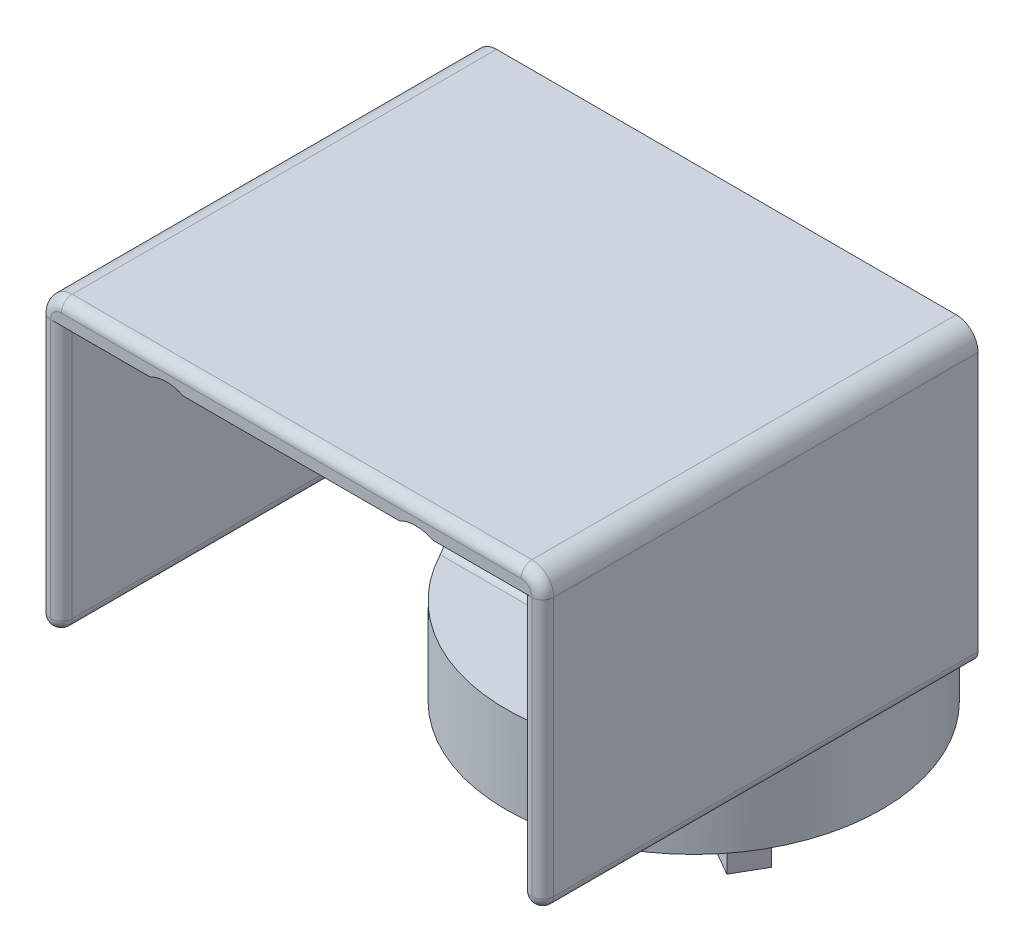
ISO-10303-21;
HEADER;
FILE_DESCRIPTION(('STEP AP214'),'2;1');
FILE_NAME('part.step','',(''),(''),'','','');
FILE_SCHEMA(('AUTOMOTIVE_DESIGN { 1 0 10303 214 1 1 1 1 }'));
ENDSEC;
DATA;
#1=APPLICATION_CONTEXT('core data for automotive mechanical design processes');
#2=APPLICATION_PROTOCOL_DEFINITION('international standard','automotive_design',2000,#1);
#3=PRODUCT_CONTEXT('',#1,'mechanical');
#4=PRODUCT('Part','Part','',(#3));
#5=PRODUCT_RELATED_PRODUCT_CATEGORY('part','',(#4));
#6=PRODUCT_DEFINITION_FORMATION('','',#4);
#7=PRODUCT_DEFINITION_CONTEXT('part definition',#1,'design');
#8=PRODUCT_DEFINITION('design','',#6,#7);
#9=PRODUCT_DEFINITION_SHAPE('','',#8);
#10=(LENGTH_UNIT() NAMED_UNIT(*) SI_UNIT(.MILLI.,.METRE.));
#11=(NAMED_UNIT(*) PLANE_ANGLE_UNIT() SI_UNIT($,.RADIAN.));
#12=(NAMED_UNIT(*) SI_UNIT($,.STERADIAN.) SOLID_ANGLE_UNIT());
#13=UNCERTAINTY_MEASURE_WITH_UNIT(LENGTH_MEASURE(1.E-05),#10,'distance_accuracy_value','');
#14=(GEOMETRIC_REPRESENTATION_CONTEXT(3) GLOBAL_UNCERTAINTY_ASSIGNED_CONTEXT((#13)) GLOBAL_UNIT_ASSIGNED_CONTEXT((#10,
#11,#12)) REPRESENTATION_CONTEXT('',''));
#15=CARTESIAN_POINT('',(0.,0.,0.));
#16=DIRECTION('',(0.,0.,1.));
#17=DIRECTION('',(1.,0.,0.));
#18=AXIS2_PLACEMENT_3D('',#15,#16,#17);
#19=CARTESIAN_POINT('',(9.86611109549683,63.9042142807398,2.54));
#20=DIRECTION('',(0.,0.,1.));
#21=DIRECTION('',(1.,0.,0.));
#22=AXIS2_PLACEMENT_3D('',#19,#20,#21);
#23=PLANE('',#22);
#24=DIRECTION('',(0.,1.,0.));
#25=VECTOR('',#24,1.);
#26=CARTESIAN_POINT('',(-43.8040889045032,63.9042142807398,2.54));
#27=LINE('',#26,#25);
#28=CARTESIAN_POINT('',(-43.8040889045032,33.6528142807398,2.54));
#29=VERTEX_POINT('',#28);
#30=CARTESIAN_POINT('',(-43.8040889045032,63.9042142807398,2.54));
#31=VERTEX_POINT('',#30);
#32=EDGE_CURVE('E680',#29,#31,#27,.T.);
#33=ORIENTED_EDGE('',*,*,#32,.F.);
#34=CARTESIAN_POINT('',(-45.0740889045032,33.6528142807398,2.54));
#35=DIRECTION('',(0.,0.,1.));
#36=DIRECTION('',(1.,0.,0.));
#37=AXIS2_PLACEMENT_3D('',#34,#35,#36);
#38=CIRCLE('',#37,1.27);
#39=CARTESIAN_POINT('',(-45.0740889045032,32.3828142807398,2.54));
#40=VERTEX_POINT('',#39);
#41=EDGE_CURVE('E1482',#29,#40,#38,.F.);
#42=ORIENTED_EDGE('',*,*,#41,.T.);
#43=DIRECTION('',(-1.,0.,0.));
#44=VECTOR('',#43,1.);
#45=CARTESIAN_POINT('',(-43.6766408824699,32.3828142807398,2.54));
#46=LINE('',#45,#44);
#47=CARTESIAN_POINT('',(-43.6766408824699,32.3828142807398,2.54));
#48=VERTEX_POINT('',#47);
#49=EDGE_CURVE('E1084',#48,#40,#46,.T.);
#50=ORIENTED_EDGE('',*,*,#49,.F.);
#51=CARTESIAN_POINT('',(-43.6766408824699,27.3028142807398,2.54));
#52=DIRECTION('',(0.,0.,1.));
#53=DIRECTION('',(1.,0.,0.));
#54=AXIS2_PLACEMENT_3D('',#51,#52,#53);
#55=CIRCLE('',#54,5.08);
#56=CARTESIAN_POINT('',(-38.5966408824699,27.3028142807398,2.54));
#57=VERTEX_POINT('',#56);
#58=EDGE_CURVE('E1081',#57,#48,#55,.T.);
#59=ORIENTED_EDGE('',*,*,#58,.F.);
#60=DIRECTION('',(0.,1.,0.));
#61=VECTOR('',#60,1.);
#62=CARTESIAN_POINT('',(-38.5966408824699,63.9042142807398,2.54));
#63=LINE('',#62,#61);
#64=CARTESIAN_POINT('',(-38.5966408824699,26.0328142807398,2.54));
#65=VERTEX_POINT('',#64);
#66=EDGE_CURVE('E766',#65,#57,#63,.T.);
#67=ORIENTED_EDGE('',*,*,#66,.F.);
#68=DIRECTION('',(1.,0.,0.));
#69=VECTOR('',#68,1.);
#70=CARTESIAN_POINT('',(9.86611109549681,26.0328142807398,2.54));
#71=LINE('',#70,#69);
#72=CARTESIAN_POINT('',(-37.0194253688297,26.0328142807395,2.54));
#73=VERTEX_POINT('',#72);
#74=EDGE_CURVE('E1340',#65,#73,#71,.T.);
#75=ORIENTED_EDGE('',*,*,#74,.T.);
#76=DIRECTION('',(0.,-1.,0.));
#77=VECTOR('',#76,1.);
#78=CARTESIAN_POINT('',(-37.0194253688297,26.0328142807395,2.54));
#79=LINE('',#78,#77);
#80=CARTESIAN_POINT('',(-37.0194253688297,27.3028142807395,2.54));
#81=VERTEX_POINT('',#80);
#82=EDGE_CURVE('E1413',#73,#81,#79,.F.);
#83=ORIENTED_EDGE('',*,*,#82,.T.);
#84=DIRECTION('',(1.,0.,0.));
#85=VECTOR('',#84,1.);
#86=CARTESIAN_POINT('',(-19.5089889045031,27.3028142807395,2.54));
#87=LINE('',#86,#85);
#88=CARTESIAN_POINT('',(-19.5089889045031,27.3028142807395,2.54));
#89=VERTEX_POINT('',#88);
#90=EDGE_CURVE('E1416',#81,#89,#87,.T.);
#91=ORIENTED_EDGE('',*,*,#90,.T.);
#92=DIRECTION('',(0.,-1.,0.));
#93=VECTOR('',#92,1.);
#94=CARTESIAN_POINT('',(-19.5089889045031,30.5335390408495,2.54));
#95=LINE('',#94,#93);
#96=CARTESIAN_POINT('',(-19.5089889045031,30.5335390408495,2.54));
#97=VERTEX_POINT('',#96);
#98=EDGE_CURVE('E1026',#97,#89,#95,.T.);
#99=ORIENTED_EDGE('',*,*,#98,.F.);
#100=CARTESIAN_POINT('',(-17.7309889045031,30.5335390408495,2.54));
#101=DIRECTION('',(0.,0.,1.));
#102=DIRECTION('',(1.,0.,0.));
#103=AXIS2_PLACEMENT_3D('',#100,#101,#102);
#104=CIRCLE('',#103,1.778);
#105=CARTESIAN_POINT('',(-17.7309889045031,32.3115390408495,2.54));
#106=VERTEX_POINT('',#105);
#107=EDGE_CURVE('E1023',#106,#97,#104,.T.);
#108=ORIENTED_EDGE('',*,*,#107,.F.);
#109=DIRECTION('',(-1.,0.,0.));
#110=VECTOR('',#109,1.);
#111=CARTESIAN_POINT('',(-17.7309889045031,32.3115390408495,2.54));
#112=LINE('',#111,#110);
#113=CARTESIAN_POINT('',(-16.2069889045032,32.3115390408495,2.54));
#114=VERTEX_POINT('',#113);
#115=EDGE_CURVE('E1020',#114,#106,#112,.T.);
#116=ORIENTED_EDGE('',*,*,#115,.F.);
#117=CARTESIAN_POINT('',(-16.2069889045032,30.5335390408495,2.54));
#118=DIRECTION('',(0.,0.,1.));
#119=DIRECTION('',(-1.,0.,0.));
#120=AXIS2_PLACEMENT_3D('',#117,#118,#119);
#121=CIRCLE('',#120,1.778);
#122=CARTESIAN_POINT('',(-14.4289889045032,30.5335390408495,2.54));
#123=VERTEX_POINT('',#122);
#124=EDGE_CURVE('E1017',#123,#114,#121,.T.);
#125=ORIENTED_EDGE('',*,*,#124,.F.);
#126=DIRECTION('',(0.,1.,0.));
#127=VECTOR('',#126,1.);
#128=CARTESIAN_POINT('',(-14.4289889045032,30.5335390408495,2.54));
#129=LINE('',#128,#127);
#130=CARTESIAN_POINT('',(-14.4289889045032,27.3028142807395,2.54));
#131=VERTEX_POINT('',#130);
#132=EDGE_CURVE('E750',#131,#123,#129,.T.);
#133=ORIENTED_EDGE('',*,*,#132,.F.);
#134=DIRECTION('',(1.,0.,0.));
#135=VECTOR('',#134,1.);
#136=CARTESIAN_POINT('',(3.08144755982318,27.3028142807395,2.54));
#137=LINE('',#136,#135);
#138=CARTESIAN_POINT('',(3.08144755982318,27.3028142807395,2.54));
#139=VERTEX_POINT('',#138);
#140=EDGE_CURVE('E1421',#131,#139,#137,.T.);
#141=ORIENTED_EDGE('',*,*,#140,.T.);
#142=DIRECTION('',(0.,-1.,0.));
#143=VECTOR('',#142,1.);
#144=CARTESIAN_POINT('',(3.08144755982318,27.3028142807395,2.54));
#145=LINE('',#144,#143);
#146=CARTESIAN_POINT('',(3.08144755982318,26.0328142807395,2.54));
#147=VERTEX_POINT('',#146);
#148=EDGE_CURVE('E1419',#139,#147,#145,.T.);
#149=ORIENTED_EDGE('',*,*,#148,.T.);
#150=CARTESIAN_POINT('',(4.65866307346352,26.0328142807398,2.54));
#151=VERTEX_POINT('',#150);
#152=EDGE_CURVE('E1339',#147,#151,#71,.T.);
#153=ORIENTED_EDGE('',*,*,#152,.T.);
#154=DIRECTION('',(0.,-1.,0.));
#155=VECTOR('',#154,1.);
#156=CARTESIAN_POINT('',(4.65866307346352,23.8944529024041,2.54));
#157=LINE('',#156,#155);
#158=CARTESIAN_POINT('',(4.65866307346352,27.3028142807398,2.54));
#159=VERTEX_POINT('',#158);
#160=EDGE_CURVE('E1055',#159,#151,#157,.T.);
#161=ORIENTED_EDGE('',*,*,#160,.F.);
#162=CARTESIAN_POINT('',(9.73866307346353,27.3028142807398,2.54));
#163=DIRECTION('',(0.,0.,1.));
#164=DIRECTION('',(-1.,0.,0.));
#165=AXIS2_PLACEMENT_3D('',#162,#163,#164);
#166=CIRCLE('',#165,5.08);
#167=CARTESIAN_POINT('',(9.73866307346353,32.3828142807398,2.54));
#168=VERTEX_POINT('',#167);
#169=EDGE_CURVE('E1052',#168,#159,#166,.T.);
#170=ORIENTED_EDGE('',*,*,#169,.F.);
#171=DIRECTION('',(-1.,-1.41514012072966E-13,0.));
#172=VECTOR('',#171,1.);
#173=CARTESIAN_POINT('',(9.73866307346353,32.3828142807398,2.54));
#174=LINE('',#173,#172);
#175=CARTESIAN_POINT('',(11.1361110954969,32.38281428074,2.54));
#176=VERTEX_POINT('',#175);
#177=EDGE_CURVE('E1049',#176,#168,#174,.T.);
#178=ORIENTED_EDGE('',*,*,#177,.F.);
#179=CARTESIAN_POINT('',(11.1361110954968,33.65281428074,2.54));
#180=DIRECTION('',(0.,0.,1.));
#181=DIRECTION('',(1.,0.,0.));
#182=AXIS2_PLACEMENT_3D('',#179,#180,#181);
#183=CIRCLE('',#182,1.27);
#184=CARTESIAN_POINT('',(9.86611109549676,33.65281428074,2.54));
#185=VERTEX_POINT('',#184);
#186=EDGE_CURVE('E734',#185,#176,#183,.T.);
#187=ORIENTED_EDGE('',*,*,#186,.F.);
#188=DIRECTION('',(0.,-1.,0.));
#189=VECTOR('',#188,1.);
#190=CARTESIAN_POINT('',(9.86611109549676,33.65281428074,2.54));
#191=LINE('',#190,#189);
#192=CARTESIAN_POINT('',(9.86611109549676,63.9042142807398,2.54));
#193=VERTEX_POINT('',#192);
#194=EDGE_CURVE('E731',#193,#185,#191,.T.);
#195=ORIENTED_EDGE('',*,*,#194,.F.);
#196=DIRECTION('',(1.,0.,0.));
#197=VECTOR('',#196,1.);
#198=CARTESIAN_POINT('',(9.86611109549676,63.9042142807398,2.54));
#199=LINE('',#198,#197);
#200=CARTESIAN_POINT('',(-0.491738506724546,63.9042142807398,2.54));
#201=VERTEX_POINT('',#200);
#202=EDGE_CURVE('E728',#201,#193,#199,.T.);
#203=ORIENTED_EDGE('',*,*,#202,.F.);
#204=CARTESIAN_POINT('',(-2.42748890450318,60.0942142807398,2.54));
#205=DIRECTION('',(0.,0.,1.));
#206=DIRECTION('',(1.,0.,0.));
#207=AXIS2_PLACEMENT_3D('',#204,#205,#206);
#208=CIRCLE('',#207,4.27355);
#209=CARTESIAN_POINT('',(1.84606109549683,60.0942142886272,2.54));
#210=VERTEX_POINT('',#209);
#211=EDGE_CURVE('E1120',#210,#201,#208,.T.);
#212=ORIENTED_EDGE('',*,*,#211,.F.);
#213=DIRECTION('',(0.,1.,0.));
#214=VECTOR('',#213,1.);
#215=CARTESIAN_POINT('',(1.84606109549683,59.529064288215,2.54));
#216=LINE('',#215,#214);
#217=CARTESIAN_POINT('',(1.84606109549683,59.529064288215,2.54));
#218=VERTEX_POINT('',#217);
#219=EDGE_CURVE('E1117',#218,#210,#216,.T.);
#220=ORIENTED_EDGE('',*,*,#219,.F.);
#221=CARTESIAN_POINT('',(4.76706109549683,59.529064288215,2.54));
#222=DIRECTION('',(0.,0.,-1.));
#223=DIRECTION('',(1.,0.,0.));
#224=AXIS2_PLACEMENT_3D('',#221,#222,#223);
#225=CIRCLE('',#224,2.921);
#226=CARTESIAN_POINT('',(4.76706109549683,56.608064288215,2.54));
#227=VERTEX_POINT('',#226);
#228=EDGE_CURVE('E1115',#227,#218,#225,.T.);
#229=ORIENTED_EDGE('',*,*,#228,.F.);
#230=DIRECTION('',(-1.,0.,0.));
#231=VECTOR('',#230,1.);
#232=CARTESIAN_POINT('',(6.05611109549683,56.608064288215,2.54));
#233=LINE('',#232,#231);
#234=CARTESIAN_POINT('',(6.05611109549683,56.608064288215,2.54));
#235=VERTEX_POINT('',#234);
#236=EDGE_CURVE('E1112',#235,#227,#233,.T.);
#237=ORIENTED_EDGE('',*,*,#236,.F.);
#238=CARTESIAN_POINT('',(6.05611109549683,55.084064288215,2.54));
#239=DIRECTION('',(0.,0.,1.));
#240=DIRECTION('',(1.,0.,0.));
#241=AXIS2_PLACEMENT_3D('',#238,#239,#240);
#242=CIRCLE('',#241,1.524);
#243=CARTESIAN_POINT('',(7.58011109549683,55.084064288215,2.54));
#244=VERTEX_POINT('',#243);
#245=EDGE_CURVE('E1110',#244,#235,#242,.T.);
#246=ORIENTED_EDGE('',*,*,#245,.F.);
#247=DIRECTION('',(0.,1.,0.));
#248=VECTOR('',#247,1.);
#249=CARTESIAN_POINT('',(7.58011109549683,37.3929642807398,2.54));
#250=LINE('',#249,#248);
#251=CARTESIAN_POINT('',(7.58011109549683,37.3929642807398,2.54));
#252=VERTEX_POINT('',#251);
#253=EDGE_CURVE('E1178',#252,#244,#250,.T.);
#254=ORIENTED_EDGE('',*,*,#253,.F.);
#255=CARTESIAN_POINT('',(6.05611109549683,37.3929642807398,2.54));
#256=DIRECTION('',(0.,0.,1.));
#257=DIRECTION('',(1.,0.,0.));
#258=AXIS2_PLACEMENT_3D('',#255,#256,#257);
#259=CIRCLE('',#258,1.524);
#260=CARTESIAN_POINT('',(6.05611109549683,35.8689642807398,2.54));
#261=VERTEX_POINT('',#260);
#262=EDGE_CURVE('E1175',#261,#252,#259,.T.);
#263=ORIENTED_EDGE('',*,*,#262,.F.);
#264=DIRECTION('',(1.,0.,0.));
#265=VECTOR('',#264,1.);
#266=CARTESIAN_POINT('',(4.76706109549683,35.8689642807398,2.54));
#267=LINE('',#266,#265);
#268=CARTESIAN_POINT('',(4.76706109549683,35.8689642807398,2.54));
#269=VERTEX_POINT('',#268);
#270=EDGE_CURVE('E1173',#269,#261,#267,.T.);
#271=ORIENTED_EDGE('',*,*,#270,.F.);
#272=CARTESIAN_POINT('',(4.76706109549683,32.9479642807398,2.54));
#273=DIRECTION('',(0.,0.,-1.));
#274=DIRECTION('',(1.,0.,0.));
#275=AXIS2_PLACEMENT_3D('',#272,#273,#274);
#276=CIRCLE('',#275,2.921);
#277=CARTESIAN_POINT('',(1.84606109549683,32.9479642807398,2.54));
#278=VERTEX_POINT('',#277);
#279=EDGE_CURVE('E1171',#278,#269,#276,.T.);
#280=ORIENTED_EDGE('',*,*,#279,.F.);
#281=DIRECTION('',(0.,1.,0.));
#282=VECTOR('',#281,1.);
#283=CARTESIAN_POINT('',(1.84606109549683,32.3828142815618,2.54));
#284=LINE('',#283,#282);
#285=CARTESIAN_POINT('',(1.84606109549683,32.3828142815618,2.54));
#286=VERTEX_POINT('',#285);
#287=EDGE_CURVE('E1169',#286,#278,#284,.T.);
#288=ORIENTED_EDGE('',*,*,#287,.F.);
#289=CARTESIAN_POINT('',(-2.42748890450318,32.3828142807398,2.54));
#290=DIRECTION('',(0.,0.,1.));
#291=DIRECTION('',(1.,0.,0.));
#292=AXIS2_PLACEMENT_3D('',#289,#290,#291);
#293=CIRCLE('',#292,4.27355000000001);
#294=CARTESIAN_POINT('',(-6.70103890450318,32.382814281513,2.54));
#295=VERTEX_POINT('',#294);
#296=EDGE_CURVE('E1167',#295,#286,#293,.T.);
#297=ORIENTED_EDGE('',*,*,#296,.F.);
#298=DIRECTION('',(0.,-1.,0.));
#299=VECTOR('',#298,1.);
#300=CARTESIAN_POINT('',(-6.70103890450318,32.9479642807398,2.54));
#301=LINE('',#300,#299);
#302=CARTESIAN_POINT('',(-6.70103890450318,32.9479642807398,2.54));
#303=VERTEX_POINT('',#302);
#304=EDGE_CURVE('E1165',#303,#295,#301,.T.);
#305=ORIENTED_EDGE('',*,*,#304,.F.);
#306=CARTESIAN_POINT('',(-9.62203890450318,32.9479642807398,2.54));
#307=DIRECTION('',(0.,0.,-1.));
#308=DIRECTION('',(1.,0.,0.));
#309=AXIS2_PLACEMENT_3D('',#306,#307,#308);
#310=CIRCLE('',#309,2.921);
#311=CARTESIAN_POINT('',(-9.62203890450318,35.8689642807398,2.54));
#312=VERTEX_POINT('',#311);
#313=EDGE_CURVE('E1163',#312,#303,#310,.T.);
#314=ORIENTED_EDGE('',*,*,#313,.F.);
#315=DIRECTION('',(1.,0.,0.));
#316=VECTOR('',#315,1.);
#317=CARTESIAN_POINT('',(-24.3159389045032,35.8689642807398,2.54));
#318=LINE('',#317,#316);
#319=CARTESIAN_POINT('',(-24.3159389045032,35.8689642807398,2.54));
#320=VERTEX_POINT('',#319);
#321=EDGE_CURVE('E1161',#320,#312,#318,.T.);
#322=ORIENTED_EDGE('',*,*,#321,.F.);
#323=CARTESIAN_POINT('',(-24.3159389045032,32.9479642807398,2.54));
#324=DIRECTION('',(0.,0.,-1.));
#325=DIRECTION('',(1.,0.,0.));
#326=AXIS2_PLACEMENT_3D('',#323,#324,#325);
#327=CIRCLE('',#326,2.921);
#328=CARTESIAN_POINT('',(-27.2369389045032,32.9479642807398,2.54));
#329=VERTEX_POINT('',#328);
#330=EDGE_CURVE('E1159',#329,#320,#327,.T.);
#331=ORIENTED_EDGE('',*,*,#330,.F.);
#332=DIRECTION('',(0.,1.,0.));
#333=VECTOR('',#332,1.);
#334=CARTESIAN_POINT('',(-27.2369389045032,32.3828142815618,2.54));
#335=LINE('',#334,#333);
#336=CARTESIAN_POINT('',(-27.2369389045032,32.3828142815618,2.54));
#337=VERTEX_POINT('',#336);
#338=EDGE_CURVE('E1157',#337,#329,#335,.T.);
#339=ORIENTED_EDGE('',*,*,#338,.F.);
#340=CARTESIAN_POINT('',(-31.5104889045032,32.3828142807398,2.54));
#341=DIRECTION('',(0.,0.,1.));
#342=DIRECTION('',(1.,0.,0.));
#343=AXIS2_PLACEMENT_3D('',#340,#341,#342);
#344=CIRCLE('',#343,4.27355000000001);
#345=CARTESIAN_POINT('',(-35.7840389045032,32.382814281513,2.54));
#346=VERTEX_POINT('',#345);
#347=EDGE_CURVE('E1155',#346,#337,#344,.T.);
#348=ORIENTED_EDGE('',*,*,#347,.F.);
#349=DIRECTION('',(0.,-1.,0.));
#350=VECTOR('',#349,1.);
#351=CARTESIAN_POINT('',(-35.7840389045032,32.9479642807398,2.54));
#352=LINE('',#351,#350);
#353=CARTESIAN_POINT('',(-35.7840389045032,32.9479642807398,2.54));
#354=VERTEX_POINT('',#353);
#355=EDGE_CURVE('E1153',#354,#346,#352,.T.);
#356=ORIENTED_EDGE('',*,*,#355,.F.);
#357=CARTESIAN_POINT('',(-38.7050389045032,32.9479642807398,2.54));
#358=DIRECTION('',(0.,0.,-1.));
#359=DIRECTION('',(1.,0.,0.));
#360=AXIS2_PLACEMENT_3D('',#357,#358,#359);
#361=CIRCLE('',#360,2.921);
#362=CARTESIAN_POINT('',(-38.7050389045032,35.8689642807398,2.54));
#363=VERTEX_POINT('',#362);
#364=EDGE_CURVE('E1151',#363,#354,#361,.T.);
#365=ORIENTED_EDGE('',*,*,#364,.F.);
#366=DIRECTION('',(1.,0.,0.));
#367=VECTOR('',#366,1.);
#368=CARTESIAN_POINT('',(-39.9940889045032,35.8689642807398,2.54));
#369=LINE('',#368,#367);
#370=CARTESIAN_POINT('',(-39.9940889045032,35.8689642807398,2.54));
#371=VERTEX_POINT('',#370);
#372=EDGE_CURVE('E1149',#371,#363,#369,.T.);
#373=ORIENTED_EDGE('',*,*,#372,.F.);
#374=CARTESIAN_POINT('',(-39.9940889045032,37.3929642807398,2.54));
#375=DIRECTION('',(0.,0.,1.));
#376=DIRECTION('',(1.,0.,0.));
#377=AXIS2_PLACEMENT_3D('',#374,#375,#376);
#378=CIRCLE('',#377,1.524);
#379=CARTESIAN_POINT('',(-41.5180889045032,37.3929642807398,2.54));
#380=VERTEX_POINT('',#379);
#381=EDGE_CURVE('E1147',#380,#371,#378,.T.);
#382=ORIENTED_EDGE('',*,*,#381,.F.);
#383=DIRECTION('',(0.,-1.,0.));
#384=VECTOR('',#383,1.);
#385=CARTESIAN_POINT('',(-41.5180889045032,55.0840642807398,2.54));
#386=LINE('',#385,#384);
#387=CARTESIAN_POINT('',(-41.5180889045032,55.0840642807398,2.54));
#388=VERTEX_POINT('',#387);
#389=EDGE_CURVE('E1145',#388,#380,#386,.T.);
#390=ORIENTED_EDGE('',*,*,#389,.F.);
#391=CARTESIAN_POINT('',(-39.9940889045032,55.0840642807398,2.54));
#392=DIRECTION('',(0.,0.,1.));
#393=DIRECTION('',(1.,0.,0.));
#394=AXIS2_PLACEMENT_3D('',#391,#392,#393);
#395=CIRCLE('',#394,1.524);
#396=CARTESIAN_POINT('',(-39.9940889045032,56.6080642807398,2.54));
#397=VERTEX_POINT('',#396);
#398=EDGE_CURVE('E1143',#397,#388,#395,.T.);
#399=ORIENTED_EDGE('',*,*,#398,.F.);
#400=DIRECTION('',(-1.,0.,0.));
#401=VECTOR('',#400,1.);
#402=CARTESIAN_POINT('',(-38.7050389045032,56.6080642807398,2.54));
#403=LINE('',#402,#401);
#404=CARTESIAN_POINT('',(-38.7050389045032,56.6080642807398,2.54));
#405=VERTEX_POINT('',#404);
#406=EDGE_CURVE('E1141',#405,#397,#403,.T.);
#407=ORIENTED_EDGE('',*,*,#406,.F.);
#408=CARTESIAN_POINT('',(-38.7050389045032,59.5290642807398,2.54));
#409=DIRECTION('',(0.,0.,-1.));
#410=DIRECTION('',(1.,0.,0.));
#411=AXIS2_PLACEMENT_3D('',#408,#409,#410);
#412=CIRCLE('',#411,2.921);
#413=CARTESIAN_POINT('',(-35.7840389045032,59.5290642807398,2.54));
#414=VERTEX_POINT('',#413);
#415=EDGE_CURVE('E1139',#414,#405,#412,.T.);
#416=ORIENTED_EDGE('',*,*,#415,.F.);
#417=DIRECTION('',(0.,-1.,0.));
#418=VECTOR('',#417,1.);
#419=CARTESIAN_POINT('',(-35.7840389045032,60.0942142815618,2.54));
#420=LINE('',#419,#418);
#421=CARTESIAN_POINT('',(-35.7840389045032,60.0942142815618,2.54));
#422=VERTEX_POINT('',#421);
#423=EDGE_CURVE('E1137',#422,#414,#420,.T.);
#424=ORIENTED_EDGE('',*,*,#423,.F.);
#425=CARTESIAN_POINT('',(-31.5104889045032,60.0942142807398,2.54));
#426=DIRECTION('',(0.,0.,1.));
#427=DIRECTION('',(1.,0.,0.));
#428=AXIS2_PLACEMENT_3D('',#425,#426,#427);
#429=CIRCLE('',#428,4.27355);
#430=CARTESIAN_POINT('',(-33.4462393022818,63.9042142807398,2.54));
#431=VERTEX_POINT('',#430);
#432=EDGE_CURVE('E1133',#431,#422,#429,.T.);
#433=ORIENTED_EDGE('',*,*,#432,.F.);
#434=DIRECTION('',(1.,0.,0.));
#435=VECTOR('',#434,1.);
#436=CARTESIAN_POINT('',(-33.4462393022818,63.9042142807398,2.54));
#437=LINE('',#436,#435);
#438=EDGE_CURVE('E719',#31,#431,#437,.T.);
#439=ORIENTED_EDGE('',*,*,#438,.F.);
#440=EDGE_LOOP('',(#33,#42,#50,#59,#67,#75,#83,#91,#99,#108,#116,#125,#133,#141,#149,#153,#161,
#170,#178,#187,#195,#203,#212,#220,#229,#237,#246,#254,#263,#271,#280,#288,#297,#305,#314,#322,
#331,#339,#348,#356,#365,#373,#382,#390,#399,#407,#416,#424,#433,#439));
#441=FACE_BOUND('',#440,.T.);
#442=ADVANCED_FACE('F34',(#441),#23,.T.);
#443=CARTESIAN_POINT('',(72.8324514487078,10.7928142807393,-16.3818011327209));
#444=DIRECTION('',(0.,1.,0.));
#445=DIRECTION('',(-1.,0.,0.));
#446=AXIS2_PLACEMENT_3D('',#443,#444,#445);
#447=PLANE('',#446);
#448=DIRECTION('',(0.,0.,-1.));
#449=VECTOR('',#448,1.);
#450=CARTESIAN_POINT('',(-18.8739889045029,10.7928142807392,-24.027651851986));
#451=LINE('',#450,#449);
#452=CARTESIAN_POINT('',(-18.8739889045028,10.7928142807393,-17.0516408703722));
#453=VERTEX_POINT('',#452);
#454=CARTESIAN_POINT('',(-18.8739889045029,10.7928142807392,-24.027651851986));
#455=VERTEX_POINT('',#454);
#456=EDGE_CURVE('E751',#453,#455,#451,.T.);
#457=ORIENTED_EDGE('',*,*,#456,.T.);
#458=DIRECTION('',(1.,0.,0.));
#459=VECTOR('',#458,1.);
#460=CARTESIAN_POINT('',(-15.0639889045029,10.7928142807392,-24.027651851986));
#461=LINE('',#460,#459);
#462=CARTESIAN_POINT('',(-15.0639889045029,10.7928142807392,-24.027651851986));
#463=VERTEX_POINT('',#462);
#464=EDGE_CURVE('E754',#455,#463,#461,.T.);
#465=ORIENTED_EDGE('',*,*,#464,.T.);
#466=DIRECTION('',(0.,0.,1.));
#467=VECTOR('',#466,1.);
#468=CARTESIAN_POINT('',(-15.0639889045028,10.7928142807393,-17.0516408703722));
#469=LINE('',#468,#467);
#470=CARTESIAN_POINT('',(-15.0639889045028,10.7928142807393,-17.0516408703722));
#471=VERTEX_POINT('',#470);
#472=EDGE_CURVE('E757',#463,#471,#469,.T.);
#473=ORIENTED_EDGE('',*,*,#472,.T.);
#474=DIRECTION('',(-1.,0.,0.));
#475=VECTOR('',#474,1.);
#476=CARTESIAN_POINT('',(-18.8739889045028,10.7928142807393,-17.0516408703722));
#477=LINE('',#476,#475);
#478=EDGE_CURVE('E759',#471,#453,#477,.T.);
#479=ORIENTED_EDGE('',*,*,#478,.T.);
#480=EDGE_LOOP('',(#457,#465,#473,#479));
#481=FACE_BOUND('',#480,.T.);
#482=ADVANCED_FACE('F1521',(#481),#447,.F.);
#483=CARTESIAN_POINT('',(72.8324514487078,10.7928142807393,-16.3818011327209));
#484=DIRECTION('',(0.,1.,0.));
#485=DIRECTION('',(-1.,0.,0.));
#486=AXIS2_PLACEMENT_3D('',#483,#484,#485);
#487=PLANE('',#486);
#488=DIRECTION('',(-0.499999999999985,0.,-0.866025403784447));
#489=VECTOR('',#488,1.);
#490=CARTESIAN_POINT('',(-33.2307844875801,10.7928142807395,0.839047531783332));
#491=LINE('',#490,#489);
#492=CARTESIAN_POINT('',(-31.3257844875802,10.7928142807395,4.13860432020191));
#493=VERTEX_POINT('',#492);
#494=CARTESIAN_POINT('',(-33.2307844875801,10.7928142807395,0.839047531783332));
#495=VERTEX_POINT('',#494);
#496=EDGE_CURVE('E819',#493,#495,#491,.T.);
#497=ORIENTED_EDGE('',*,*,#496,.T.);
#498=DIRECTION('',(0.866025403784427,0.,-0.500000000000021));
#499=VECTOR('',#498,1.);
#500=CARTESIAN_POINT('',(-27.1893817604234,10.7928142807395,-2.64895795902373));
#501=LINE('',#500,#499);
#502=CARTESIAN_POINT('',(-27.1893817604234,10.7928142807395,-2.64895795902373));
#503=VERTEX_POINT('',#502);
#504=EDGE_CURVE('E822',#495,#503,#501,.T.);
#505=ORIENTED_EDGE('',*,*,#504,.T.);
#506=DIRECTION('',(0.499999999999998,0.,0.86602540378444));
#507=VECTOR('',#506,1.);
#508=CARTESIAN_POINT('',(-25.2843817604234,10.7928142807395,0.650598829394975));
#509=LINE('',#508,#507);
#510=CARTESIAN_POINT('',(-25.2843817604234,10.7928142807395,0.650598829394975));
#511=VERTEX_POINT('',#510);
#512=EDGE_CURVE('E825',#503,#511,#509,.T.);
#513=ORIENTED_EDGE('',*,*,#512,.T.);
#514=DIRECTION('',(-0.86602540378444,0.,0.499999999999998));
#515=VECTOR('',#514,1.);
#516=CARTESIAN_POINT('',(-31.3257844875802,10.7928142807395,4.13860432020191));
#517=LINE('',#516,#515);
#518=EDGE_CURVE('E827',#511,#493,#517,.T.);
#519=ORIENTED_EDGE('',*,*,#518,.T.);
#520=EDGE_LOOP('',(#497,#505,#513,#519));
#521=FACE_BOUND('',#520,.T.);
#522=ADVANCED_FACE('F1528',(#521),#487,.F.);
#523=CARTESIAN_POINT('',(-16.9689889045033,20.9528142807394,-6.35000000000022));
#524=DIRECTION('',(0.,1.,0.));
#525=DIRECTION('',(-1.,0.,0.));
#526=AXIS2_PLACEMENT_3D('',#523,#524,#525);
#527=PLANE('',#526);
#528=CARTESIAN_POINT('',(-16.9689889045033,20.9528142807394,-6.35000000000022));
#529=DIRECTION('',(0.,1.,0.));
#530=DIRECTION('',(-1.,0.,0.));
#531=AXIS2_PLACEMENT_3D('',#528,#529,#530);
#532=CIRCLE('',#531,17.7800000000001);
#533=CARTESIAN_POINT('',(-28.3977526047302,20.9528142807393,-19.9702701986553));
#534=VERTEX_POINT('',#533);
#535=CARTESIAN_POINT('',(-34.4973859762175,20.9528142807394,-9.33055298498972));
#536=VERTEX_POINT('',#535);
#537=EDGE_CURVE('E899',#534,#536,#532,.T.);
#538=ORIENTED_EDGE('',*,*,#537,.F.);
#539=DIRECTION('',(-0.642787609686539,0.,-0.766044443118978));
#540=VECTOR('',#539,1.);
#541=CARTESIAN_POINT('',(-25.9487318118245,20.9528142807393,-17.051640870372));
#542=LINE('',#541,#540);
#543=CARTESIAN_POINT('',(-25.9487318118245,20.9528142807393,-17.051640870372));
#544=VERTEX_POINT('',#543);
#545=EDGE_CURVE('E909',#544,#534,#542,.T.);
#546=ORIENTED_EDGE('',*,*,#545,.F.);
#547=CARTESIAN_POINT('',(-16.9689889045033,20.9528142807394,-6.35000000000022));
#548=DIRECTION('',(0.,-1.,0.));
#549=DIRECTION('',(-1.,0.,0.));
#550=AXIS2_PLACEMENT_3D('',#547,#548,#549);
#551=CIRCLE('',#550,13.9700000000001);
#552=CARTESIAN_POINT('',(-30.7267532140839,20.9528142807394,-8.77586504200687));
#553=VERTEX_POINT('',#552);
#554=EDGE_CURVE('E906',#553,#544,#551,.T.);
#555=ORIENTED_EDGE('',*,*,#554,.F.);
#556=DIRECTION('',(0.9893522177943,0.,0.145541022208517));
#557=VECTOR('',#556,1.);
#558=CARTESIAN_POINT('',(-34.4973859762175,20.9528142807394,-9.33055298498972));
#559=LINE('',#558,#557);
#560=EDGE_CURVE('E902',#536,#553,#559,.T.);
#561=ORIENTED_EDGE('',*,*,#560,.F.);
#562=EDGE_LOOP('',(#538,#546,#555,#561));
#563=FACE_BOUND('',#562,.T.);
#564=ADVANCED_FACE('F1763',(#563),#527,.F.);
#565=CARTESIAN_POINT('',(-16.9689889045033,20.9528142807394,-6.35000000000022));
#566=DIRECTION('',(0.,1.,0.));
#567=DIRECTION('',(-1.,0.,0.));
#568=AXIS2_PLACEMENT_3D('',#565,#566,#567);
#569=CIRCLE('',#568,17.78);
#570=CARTESIAN_POINT('',(-23.0501070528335,20.9528142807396,10.3577347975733));
#571=VERTEX_POINT('',#570);
#572=CARTESIAN_POINT('',(-10.7860249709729,20.9528142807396,10.3203136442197));
#573=VERTEX_POINT('',#572);
#574=EDGE_CURVE('E933',#571,#573,#569,.T.);
#575=ORIENTED_EDGE('',*,*,#574,.F.);
#576=DIRECTION('',(-0.342020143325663,0.,0.93969262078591));
#577=VECTOR('',#576,1.);
#578=CARTESIAN_POINT('',(-21.7470103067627,20.9528142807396,6.77750591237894));
#579=LINE('',#578,#577);
#580=CARTESIAN_POINT('',(-21.7470103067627,20.9528142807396,6.77750591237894));
#581=VERTEX_POINT('',#580);
#582=EDGE_CURVE('E943',#581,#571,#579,.T.);
#583=ORIENTED_EDGE('',*,*,#582,.F.);
#584=CARTESIAN_POINT('',(-16.9689889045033,20.9528142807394,-6.35000000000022));
#585=DIRECTION('',(0.,-1.,0.));
#586=DIRECTION('',(-1.,0.,0.));
#587=AXIS2_PLACEMENT_3D('',#584,#585,#586);
#588=CIRCLE('',#587,13.97);
#589=CARTESIAN_POINT('',(-12.1909675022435,20.9528142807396,6.77750591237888));
#590=VERTEX_POINT('',#589);
#591=EDGE_CURVE('E940',#590,#581,#588,.T.);
#592=ORIENTED_EDGE('',*,*,#591,.F.);
#593=DIRECTION('',(-0.368633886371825,0.,-0.929574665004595));
#594=VECTOR('',#593,1.);
#595=CARTESIAN_POINT('',(-10.7860249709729,20.9528142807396,10.3203136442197));
#596=LINE('',#595,#594);
#597=EDGE_CURVE('E936',#573,#590,#596,.T.);
#598=ORIENTED_EDGE('',*,*,#597,.F.);
#599=EDGE_LOOP('',(#575,#583,#592,#598));
#600=FACE_BOUND('',#599,.T.);
#601=ADVANCED_FACE('F2652',(#600),#527,.F.);
#602=CARTESIAN_POINT('',(-16.9689889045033,20.9528142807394,-6.35000000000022));
#603=DIRECTION('',(0.,1.,0.));
#604=DIRECTION('',(-1.,0.,0.));
#605=AXIS2_PLACEMENT_3D('',#602,#603,#604);
#606=CIRCLE('',#605,17.7799999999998);
#607=CARTESIAN_POINT('',(0.540892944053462,20.9528142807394,-9.43746459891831));
#608=VERTEX_POINT('',#607);
#609=CARTESIAN_POINT('',(-5.62355576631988,20.9528142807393,-20.0397606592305));
#610=VERTEX_POINT('',#609);
#611=EDGE_CURVE('E865',#608,#610,#606,.T.);
#612=ORIENTED_EDGE('',*,*,#611,.F.);
#613=DIRECTION('',(0.98480775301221,0.,-0.173648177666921));
#614=VECTOR('',#613,1.);
#615=CARTESIAN_POINT('',(-3.2112245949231,20.9528142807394,-8.77586504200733));
#616=LINE('',#615,#614);
#617=CARTESIAN_POINT('',(-3.2112245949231,20.9528142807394,-8.77586504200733));
#618=VERTEX_POINT('',#617);
#619=EDGE_CURVE('E875',#618,#608,#616,.T.);
#620=ORIENTED_EDGE('',*,*,#619,.F.);
#621=CARTESIAN_POINT('',(-16.9689889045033,20.9528142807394,-6.35000000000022));
#622=DIRECTION('',(0.,-1.,0.));
#623=DIRECTION('',(-1.,0.,0.));
#624=AXIS2_PLACEMENT_3D('',#621,#622,#623);
#625=CIRCLE('',#624,13.9699999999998);
#626=CARTESIAN_POINT('',(-7.98924599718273,20.9528142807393,-17.0516408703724));
#627=VERTEX_POINT('',#626);
#628=EDGE_CURVE('E872',#627,#618,#625,.T.);
#629=ORIENTED_EDGE('',*,*,#628,.F.);
#630=DIRECTION('',(-0.620718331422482,0.,0.784033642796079));
#631=VECTOR('',#630,1.);
#632=CARTESIAN_POINT('',(-5.62355576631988,20.9528142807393,-20.0397606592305));
#633=LINE('',#632,#631);
#634=EDGE_CURVE('E868',#610,#627,#633,.T.);
#635=ORIENTED_EDGE('',*,*,#634,.F.);
#636=EDGE_LOOP('',(#612,#620,#629,#635));
#637=FACE_BOUND('',#636,.T.);
#638=ADVANCED_FACE('F1787',(#637),#527,.F.);
#639=CARTESIAN_POINT('',(72.8324514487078,10.7928142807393,-16.3818011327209));
#640=DIRECTION('',(0.,-1.,0.));
#641=DIRECTION('',(1.,0.,0.));
#642=AXIS2_PLACEMENT_3D('',#639,#640,#641);
#643=PLANE('',#642);
#644=DIRECTION('',(-0.499999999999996,0.,0.866025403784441));
#645=VECTOR('',#644,1.);
#646=CARTESIAN_POINT('',(-0.707193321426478,10.7928142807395,0.839047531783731));
#647=LINE('',#646,#645);
#648=CARTESIAN_POINT('',(-0.707193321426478,10.7928142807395,0.839047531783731));
#649=VERTEX_POINT('',#648);
#650=CARTESIAN_POINT('',(-2.61219332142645,10.7928142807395,4.13860432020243));
#651=VERTEX_POINT('',#650);
#652=EDGE_CURVE('E786',#649,#651,#647,.T.);
#653=ORIENTED_EDGE('',*,*,#652,.T.);
#654=DIRECTION('',(-0.866025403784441,0.,-0.499999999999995));
#655=VECTOR('',#654,1.);
#656=CARTESIAN_POINT('',(-2.61219332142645,10.7928142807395,4.13860432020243));
#657=LINE('',#656,#655);
#658=CARTESIAN_POINT('',(-8.65359604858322,10.7928142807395,0.650598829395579));
#659=VERTEX_POINT('',#658);
#660=EDGE_CURVE('E789',#651,#659,#657,.T.);
#661=ORIENTED_EDGE('',*,*,#660,.T.);
#662=DIRECTION('',(0.499999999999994,0.,-0.866025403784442));
#663=VECTOR('',#662,1.);
#664=CARTESIAN_POINT('',(-8.65359604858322,10.7928142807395,0.650598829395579));
#665=LINE('',#664,#663);
#666=CARTESIAN_POINT('',(-6.74859604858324,10.7928142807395,-2.64895795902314));
#667=VERTEX_POINT('',#666);
#668=EDGE_CURVE('E792',#659,#667,#665,.T.);
#669=ORIENTED_EDGE('',*,*,#668,.T.);
#670=DIRECTION('',(0.86602540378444,0.,0.499999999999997));
#671=VECTOR('',#670,1.);
#672=CARTESIAN_POINT('',(-6.74859604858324,10.7928142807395,-2.64895795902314));
#673=LINE('',#672,#671);
#674=EDGE_CURVE('E794',#667,#649,#673,.T.);
#675=ORIENTED_EDGE('',*,*,#674,.T.);
#676=EDGE_LOOP('',(#653,#661,#669,#675));
#677=FACE_BOUND('',#676,.T.);
#678=ADVANCED_FACE('F1783',(#677),#643,.T.);
#679=CARTESIAN_POINT('',(-15.0639889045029,10.7928142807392,-24.027651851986));
#680=DIRECTION('',(0.,0.,1.));
#681=DIRECTION('',(1.,0.,0.));
#682=AXIS2_PLACEMENT_3D('',#679,#680,#681);
#683=PLANE('',#682);
#684=DIRECTION('',(1.,0.,0.));
#685=VECTOR('',#684,1.);
#686=CARTESIAN_POINT('',(-15.0639889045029,15.8728142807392,-24.027651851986));
#687=LINE('',#686,#685);
#688=CARTESIAN_POINT('',(-18.8739889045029,15.8728142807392,-24.027651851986));
#689=VERTEX_POINT('',#688);
#690=CARTESIAN_POINT('',(-15.0639889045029,15.8728142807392,-24.027651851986));
#691=VERTEX_POINT('',#690);
#692=EDGE_CURVE('E765',#689,#691,#687,.T.);
#693=ORIENTED_EDGE('',*,*,#692,.T.);
#694=DIRECTION('',(0.,1.,0.));
#695=VECTOR('',#694,1.);
#696=CARTESIAN_POINT('',(-15.0639889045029,10.7928142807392,-24.027651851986));
#697=LINE('',#696,#695);
#698=EDGE_CURVE('E779',#463,#691,#697,.T.);
#699=ORIENTED_EDGE('',*,*,#698,.F.);
#700=ORIENTED_EDGE('',*,*,#464,.F.);
#701=DIRECTION('',(0.,1.,0.));
#702=VECTOR('',#701,1.);
#703=CARTESIAN_POINT('',(-18.8739889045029,10.7928142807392,-24.027651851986));
#704=LINE('',#703,#702);
#705=EDGE_CURVE('E782',#455,#689,#704,.T.);
#706=ORIENTED_EDGE('',*,*,#705,.T.);
#707=EDGE_LOOP('',(#693,#699,#700,#706));
#708=FACE_BOUND('',#707,.T.);
#709=ADVANCED_FACE('F1786',(#708),#683,.F.);
#710=CARTESIAN_POINT('',(-15.0639889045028,10.7928142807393,-17.0516408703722));
#711=DIRECTION('',(-1.,0.,0.));
#712=DIRECTION('',(0.,0.,1.));
#713=AXIS2_PLACEMENT_3D('',#710,#711,#712);
#714=PLANE('',#713);
#715=DIRECTION('',(0.,0.,1.));
#716=VECTOR('',#715,1.);
#717=CARTESIAN_POINT('',(-15.0639889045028,15.8728142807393,-17.0516408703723));
#718=LINE('',#717,#716);
#719=CARTESIAN_POINT('',(-15.0639889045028,15.8728142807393,-17.0516408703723));
#720=VERTEX_POINT('',#719);
#721=EDGE_CURVE('E769',#691,#720,#718,.T.);
#722=ORIENTED_EDGE('',*,*,#721,.T.);
#723=DIRECTION('',(0.,1.,0.));
#724=VECTOR('',#723,1.);
#725=CARTESIAN_POINT('',(-15.0639889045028,10.7928142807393,-17.0516408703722));
#726=LINE('',#725,#724);
#727=EDGE_CURVE('E776',#471,#720,#726,.T.);
#728=ORIENTED_EDGE('',*,*,#727,.F.);
#729=ORIENTED_EDGE('',*,*,#472,.F.);
#730=ORIENTED_EDGE('',*,*,#698,.T.);
#731=EDGE_LOOP('',(#722,#728,#729,#730));
#732=FACE_BOUND('',#731,.T.);
#733=ADVANCED_FACE('F1795',(#732),#714,.F.);
#734=CARTESIAN_POINT('',(-18.8739889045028,10.7928142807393,-17.0516408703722));
#735=DIRECTION('',(0.,0.,-1.));
#736=DIRECTION('',(-1.,0.,0.));
#737=AXIS2_PLACEMENT_3D('',#734,#735,#736);
#738=PLANE('',#737);
#739=DIRECTION('',(-1.,0.,0.));
#740=VECTOR('',#739,1.);
#741=CARTESIAN_POINT('',(-18.8739889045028,15.8728142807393,-17.0516408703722));
#742=LINE('',#741,#740);
#743=CARTESIAN_POINT('',(-18.8739889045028,15.8728142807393,-17.0516408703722));
#744=VERTEX_POINT('',#743);
#745=EDGE_CURVE('E755',#720,#744,#742,.T.);
#746=ORIENTED_EDGE('',*,*,#745,.T.);
#747=DIRECTION('',(0.,1.,0.));
#748=VECTOR('',#747,1.);
#749=CARTESIAN_POINT('',(-18.8739889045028,10.7928142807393,-17.0516408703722));
#750=LINE('',#749,#748);
#751=EDGE_CURVE('E761',#453,#744,#750,.T.);
#752=ORIENTED_EDGE('',*,*,#751,.F.);
#753=ORIENTED_EDGE('',*,*,#478,.F.);
#754=ORIENTED_EDGE('',*,*,#727,.T.);
#755=EDGE_LOOP('',(#746,#752,#753,#754));
#756=FACE_BOUND('',#755,.T.);
#757=ADVANCED_FACE('F1791',(#756),#738,.F.);
#758=CARTESIAN_POINT('',(-18.8739889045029,10.7928142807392,-24.027651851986));
#759=DIRECTION('',(1.,0.,0.));
#760=DIRECTION('',(0.,0.,-1.));
#761=AXIS2_PLACEMENT_3D('',#758,#759,#760);
#762=PLANE('',#761);
#763=DIRECTION('',(0.,0.,-1.));
#764=VECTOR('',#763,1.);
#765=CARTESIAN_POINT('',(-18.8739889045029,15.8728142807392,-24.027651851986));
#766=LINE('',#765,#764);
#767=EDGE_CURVE('E762',#744,#689,#766,.T.);
#768=ORIENTED_EDGE('',*,*,#767,.T.);
#769=ORIENTED_EDGE('',*,*,#705,.F.);
#770=ORIENTED_EDGE('',*,*,#456,.F.);
#771=ORIENTED_EDGE('',*,*,#751,.T.);
#772=EDGE_LOOP('',(#768,#769,#770,#771));
#773=FACE_BOUND('',#772,.T.);
#774=ADVANCED_FACE('F1753',(#773),#762,.F.);
#775=CARTESIAN_POINT('',(-27.1893817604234,10.7928142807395,-2.64895795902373));
#776=DIRECTION('',(0.500000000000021,0.,0.866025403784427));
#777=DIRECTION('',(0.866025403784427,0.,-0.500000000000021));
#778=AXIS2_PLACEMENT_3D('',#775,#776,#777);
#779=PLANE('',#778);
#780=DIRECTION('',(0.866025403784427,0.,-0.500000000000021));
#781=VECTOR('',#780,1.);
#782=CARTESIAN_POINT('',(-27.1893817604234,15.8728142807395,-2.64895795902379));
#783=LINE('',#782,#781);
#784=CARTESIAN_POINT('',(-33.2307844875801,15.8728142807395,0.83904753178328));
#785=VERTEX_POINT('',#784);
#786=CARTESIAN_POINT('',(-27.1893817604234,15.8728142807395,-2.64895795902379));
#787=VERTEX_POINT('',#786);
#788=EDGE_CURVE('E832',#785,#787,#783,.T.);
#789=ORIENTED_EDGE('',*,*,#788,.T.);
#790=DIRECTION('',(0.,1.,0.));
#791=VECTOR('',#790,1.);
#792=CARTESIAN_POINT('',(-27.1893817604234,10.7928142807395,-2.64895795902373));
#793=LINE('',#792,#791);
#794=EDGE_CURVE('E845',#503,#787,#793,.T.);
#795=ORIENTED_EDGE('',*,*,#794,.F.);
#796=ORIENTED_EDGE('',*,*,#504,.F.);
#797=DIRECTION('',(0.,1.,0.));
#798=VECTOR('',#797,1.);
#799=CARTESIAN_POINT('',(-33.2307844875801,10.7928142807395,0.839047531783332));
#800=LINE('',#799,#798);
#801=EDGE_CURVE('E848',#495,#785,#800,.T.);
#802=ORIENTED_EDGE('',*,*,#801,.T.);
#803=EDGE_LOOP('',(#789,#795,#796,#802));
#804=FACE_BOUND('',#803,.T.);
#805=ADVANCED_FACE('F1749',(#804),#779,.F.);
#806=CARTESIAN_POINT('',(-25.2843817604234,10.7928142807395,0.650598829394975));
#807=DIRECTION('',(-0.86602540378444,0.,0.499999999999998));
#808=DIRECTION('',(0.499999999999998,0.,0.86602540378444));
#809=AXIS2_PLACEMENT_3D('',#806,#807,#808);
#810=PLANE('',#809);
#811=DIRECTION('',(0.499999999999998,0.,0.86602540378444));
#812=VECTOR('',#811,1.);
#813=CARTESIAN_POINT('',(-25.2843817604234,15.8728142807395,0.650598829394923));
#814=LINE('',#813,#812);
#815=CARTESIAN_POINT('',(-25.2843817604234,15.8728142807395,0.650598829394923));
#816=VERTEX_POINT('',#815);
#817=EDGE_CURVE('E835',#787,#816,#814,.T.);
#818=ORIENTED_EDGE('',*,*,#817,.T.);
#819=DIRECTION('',(0.,1.,0.));
#820=VECTOR('',#819,1.);
#821=CARTESIAN_POINT('',(-25.2843817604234,10.7928142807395,0.650598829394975));
#822=LINE('',#821,#820);
#823=EDGE_CURVE('E842',#511,#816,#822,.T.);
#824=ORIENTED_EDGE('',*,*,#823,.F.);
#825=ORIENTED_EDGE('',*,*,#512,.F.);
#826=ORIENTED_EDGE('',*,*,#794,.T.);
#827=EDGE_LOOP('',(#818,#824,#825,#826));
#828=FACE_BOUND('',#827,.T.);
#829=ADVANCED_FACE('F1752',(#828),#810,.F.);
#830=CARTESIAN_POINT('',(-31.3257844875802,10.7928142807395,4.13860432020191));
#831=DIRECTION('',(-0.499999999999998,0.,-0.86602540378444));
#832=DIRECTION('',(-0.86602540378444,0.,0.499999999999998));
#833=AXIS2_PLACEMENT_3D('',#830,#831,#832);
#834=PLANE('',#833);
#835=DIRECTION('',(-0.86602540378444,0.,0.499999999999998));
#836=VECTOR('',#835,1.);
#837=CARTESIAN_POINT('',(-31.3257844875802,15.8728142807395,4.13860432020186));
#838=LINE('',#837,#836);
#839=CARTESIAN_POINT('',(-31.3257844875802,15.8728142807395,4.13860432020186));
#840=VERTEX_POINT('',#839);
#841=EDGE_CURVE('E823',#816,#840,#838,.T.);
#842=ORIENTED_EDGE('',*,*,#841,.T.);
#843=DIRECTION('',(0.,1.,0.));
#844=VECTOR('',#843,1.);
#845=CARTESIAN_POINT('',(-31.3257844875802,10.7928142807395,4.13860432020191));
#846=LINE('',#845,#844);
#847=EDGE_CURVE('E829',#493,#840,#846,.T.);
#848=ORIENTED_EDGE('',*,*,#847,.F.);
#849=ORIENTED_EDGE('',*,*,#518,.F.);
#850=ORIENTED_EDGE('',*,*,#823,.T.);
#851=EDGE_LOOP('',(#842,#848,#849,#850));
#852=FACE_BOUND('',#851,.T.);
#853=ADVANCED_FACE('F1747',(#852),#834,.F.);
#854=CARTESIAN_POINT('',(-33.2307844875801,10.7928142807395,0.839047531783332));
#855=DIRECTION('',(0.866025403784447,0.,-0.499999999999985));
#856=DIRECTION('',(-0.499999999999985,0.,-0.866025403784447));
#857=AXIS2_PLACEMENT_3D('',#854,#855,#856);
#858=PLANE('',#857);
#859=DIRECTION('',(-0.499999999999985,0.,-0.866025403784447));
#860=VECTOR('',#859,1.);
#861=CARTESIAN_POINT('',(-33.2307844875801,15.8728142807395,0.83904753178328));
#862=LINE('',#861,#860);
#863=EDGE_CURVE('E818',#840,#785,#862,.T.);
#864=ORIENTED_EDGE('',*,*,#863,.T.);
#865=ORIENTED_EDGE('',*,*,#801,.F.);
#866=ORIENTED_EDGE('',*,*,#496,.F.);
#867=ORIENTED_EDGE('',*,*,#847,.T.);
#868=EDGE_LOOP('',(#864,#865,#866,#867));
#869=FACE_BOUND('',#868,.T.);
#870=ADVANCED_FACE('F1743',(#869),#858,.F.);
#871=CARTESIAN_POINT('',(-25.9487318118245,20.9528142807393,-17.051640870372));
#872=DIRECTION('',(-0.766044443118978,0.,0.642787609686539));
#873=DIRECTION('',(0.642787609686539,0.,0.766044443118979));
#874=AXIS2_PLACEMENT_3D('',#871,#872,#873);
#875=PLANE('',#874);
#876=DIRECTION('',(-0.642787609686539,0.,-0.766044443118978));
#877=VECTOR('',#876,1.);
#878=CARTESIAN_POINT('',(-25.9487318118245,15.8728142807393,-17.051640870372));
#879=LINE('',#878,#877);
#880=CARTESIAN_POINT('',(-25.9487318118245,15.8728142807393,-17.051640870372));
#881=VERTEX_POINT('',#880);
#882=CARTESIAN_POINT('',(-28.3977526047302,15.8728142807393,-19.9702701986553));
#883=VERTEX_POINT('',#882);
#884=EDGE_CURVE('E903',#881,#883,#879,.T.);
#885=ORIENTED_EDGE('',*,*,#884,.F.);
#886=DIRECTION('',(0.,-1.,0.));
#887=VECTOR('',#886,1.);
#888=CARTESIAN_POINT('',(-25.9487318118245,20.9528142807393,-17.051640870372));
#889=LINE('',#888,#887);
#890=EDGE_CURVE('E925',#544,#881,#889,.T.);
#891=ORIENTED_EDGE('',*,*,#890,.F.);
#892=ORIENTED_EDGE('',*,*,#545,.T.);
#893=DIRECTION('',(0.,-1.,0.));
#894=VECTOR('',#893,1.);
#895=CARTESIAN_POINT('',(-28.3977526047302,20.9528142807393,-19.9702701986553));
#896=LINE('',#895,#894);
#897=EDGE_CURVE('E912',#534,#883,#896,.T.);
#898=ORIENTED_EDGE('',*,*,#897,.T.);
#899=EDGE_LOOP('',(#885,#891,#892,#898));
#900=FACE_BOUND('',#899,.T.);
#901=ADVANCED_FACE('F1746',(#900),#875,.T.);
#902=CARTESIAN_POINT('',(-16.9689889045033,20.9528142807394,-6.35000000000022));
#903=DIRECTION('',(0.,-1.,0.));
#904=DIRECTION('',(1.,0.,0.));
#905=AXIS2_PLACEMENT_3D('',#902,#903,#904);
#906=CYLINDRICAL_SURFACE('',#905,13.9700000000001);
#907=CARTESIAN_POINT('',(-16.9689889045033,15.8728142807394,-6.35000000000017));
#908=DIRECTION('',(0.,-1.,0.));
#909=DIRECTION('',(-1.,0.,0.));
#910=AXIS2_PLACEMENT_3D('',#907,#908,#909);
#911=CIRCLE('',#910,13.9700000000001);
#912=CARTESIAN_POINT('',(-30.7267532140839,15.8728142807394,-8.77586504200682));
#913=VERTEX_POINT('',#912);
#914=EDGE_CURVE('E918',#913,#881,#911,.T.);
#915=ORIENTED_EDGE('',*,*,#914,.F.);
#916=DIRECTION('',(0.,-1.,0.));
#917=VECTOR('',#916,1.);
#918=CARTESIAN_POINT('',(-30.7267532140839,20.9528142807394,-8.77586504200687));
#919=LINE('',#918,#917);
#920=EDGE_CURVE('E927',#553,#913,#919,.T.);
#921=ORIENTED_EDGE('',*,*,#920,.F.);
#922=ORIENTED_EDGE('',*,*,#554,.T.);
#923=ORIENTED_EDGE('',*,*,#890,.T.);
#924=EDGE_LOOP('',(#915,#921,#922,#923));
#925=FACE_BOUND('',#924,.T.);
#926=ADVANCED_FACE('F2814',(#925),#906,.T.);
#927=CARTESIAN_POINT('',(-34.4973859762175,20.9528142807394,-9.33055298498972));
#928=DIRECTION('',(0.145541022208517,0.,-0.9893522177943));
#929=DIRECTION('',(-0.9893522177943,0.,-0.145541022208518));
#930=AXIS2_PLACEMENT_3D('',#927,#928,#929);
#931=PLANE('',#930);
#932=DIRECTION('',(0.9893522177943,0.,0.145541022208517));
#933=VECTOR('',#932,1.);
#934=CARTESIAN_POINT('',(-34.4973859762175,15.8728142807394,-9.33055298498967));
#935=LINE('',#934,#933);
#936=CARTESIAN_POINT('',(-34.4973859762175,15.8728142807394,-9.33055298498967));
#937=VERTEX_POINT('',#936);
#938=EDGE_CURVE('E915',#937,#913,#935,.T.);
#939=ORIENTED_EDGE('',*,*,#938,.F.);
#940=DIRECTION('',(0.,-1.,0.));
#941=VECTOR('',#940,1.);
#942=CARTESIAN_POINT('',(-34.4973859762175,20.9528142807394,-9.33055298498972));
#943=LINE('',#942,#941);
#944=EDGE_CURVE('E929',#536,#937,#943,.T.);
#945=ORIENTED_EDGE('',*,*,#944,.F.);
#946=ORIENTED_EDGE('',*,*,#560,.T.);
#947=ORIENTED_EDGE('',*,*,#920,.T.);
#948=EDGE_LOOP('',(#939,#945,#946,#947));
#949=FACE_BOUND('',#948,.T.);
#950=ADVANCED_FACE('F2804',(#949),#931,.T.);
#951=CARTESIAN_POINT('',(-16.9689889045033,20.9528142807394,-6.35000000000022));
#952=DIRECTION('',(0.,-1.,0.));
#953=DIRECTION('',(1.,0.,0.));
#954=AXIS2_PLACEMENT_3D('',#951,#952,#953);
#955=CYLINDRICAL_SURFACE('',#954,17.7800000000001);
#956=CARTESIAN_POINT('',(-16.9689889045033,15.8728142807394,-6.35000000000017));
#957=DIRECTION('',(0.,1.,0.));
#958=DIRECTION('',(-1.,0.,0.));
#959=AXIS2_PLACEMENT_3D('',#956,#957,#958);
#960=CIRCLE('',#959,17.7800000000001);
#961=EDGE_CURVE('E898',#883,#937,#960,.T.);
#962=ORIENTED_EDGE('',*,*,#961,.F.);
#963=ORIENTED_EDGE('',*,*,#897,.F.);
#964=ORIENTED_EDGE('',*,*,#537,.T.);
#965=ORIENTED_EDGE('',*,*,#944,.T.);
#966=EDGE_LOOP('',(#962,#963,#964,#965));
#967=FACE_BOUND('',#966,.T.);
#968=ADVANCED_FACE('F2794',(#967),#955,.F.);
#969=CARTESIAN_POINT('',(-13.1589889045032,20.9528142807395,-2.54000000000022));
#970=DIRECTION('',(0.,0.,-1.));
#971=DIRECTION('',(0.,-1.,0.));
#972=AXIS2_PLACEMENT_3D('',#969,#970,#971);
#973=PLANE('',#972);
#974=DIRECTION('',(1.,0.,0.));
#975=VECTOR('',#974,1.);
#976=CARTESIAN_POINT('',(-13.1589889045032,15.8728142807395,-2.54000000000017));
#977=LINE('',#976,#975);
#978=CARTESIAN_POINT('',(-20.7789889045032,15.8728142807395,-2.54000000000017));
#979=VERTEX_POINT('',#978);
#980=CARTESIAN_POINT('',(-13.1589889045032,15.8728142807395,-2.54000000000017));
#981=VERTEX_POINT('',#980);
#982=EDGE_CURVE('E971',#979,#981,#977,.T.);
#983=ORIENTED_EDGE('',*,*,#982,.F.);
#984=DIRECTION('',(0.,-1.,0.));
#985=VECTOR('',#984,1.);
#986=CARTESIAN_POINT('',(-20.7789889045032,20.9528142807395,-2.54000000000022));
#987=LINE('',#986,#985);
#988=CARTESIAN_POINT('',(-20.7789889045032,20.9528142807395,-2.54000000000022));
#989=VERTEX_POINT('',#988);
#990=EDGE_CURVE('E993',#989,#979,#987,.T.);
#991=ORIENTED_EDGE('',*,*,#990,.F.);
#992=DIRECTION('',(1.,0.,0.));
#993=VECTOR('',#992,1.);
#994=CARTESIAN_POINT('',(-13.1589889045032,20.9528142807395,-2.54000000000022));
#995=LINE('',#994,#993);
#996=CARTESIAN_POINT('',(-13.1589889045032,20.9528142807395,-2.54000000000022));
#997=VERTEX_POINT('',#996);
#998=EDGE_CURVE('E977',#989,#997,#995,.T.);
#999=ORIENTED_EDGE('',*,*,#998,.T.);
#1000=DIRECTION('',(0.,-1.,0.));
#1001=VECTOR('',#1000,1.);
#1002=CARTESIAN_POINT('',(-13.1589889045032,20.9528142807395,-2.54000000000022));
#1003=LINE('',#1002,#1001);
#1004=EDGE_CURVE('E980',#997,#981,#1003,.T.);
#1005=ORIENTED_EDGE('',*,*,#1004,.T.);
#1006=EDGE_LOOP('',(#983,#991,#999,#1005));
#1007=FACE_BOUND('',#1006,.T.);
#1008=ADVANCED_FACE('F2784',(#1007),#973,.T.);
#1009=CARTESIAN_POINT('',(-20.7789889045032,20.9528142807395,-2.54000000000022));
#1010=DIRECTION('',(1.,0.,0.));
#1011=DIRECTION('',(0.,1.,0.));
#1012=AXIS2_PLACEMENT_3D('',#1009,#1010,#1011);
#1013=PLANE('',#1012);
#1014=DIRECTION('',(0.,0.,1.));
#1015=VECTOR('',#1014,1.);
#1016=CARTESIAN_POINT('',(-20.7789889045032,15.8728142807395,-2.54000000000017));
#1017=LINE('',#1016,#1015);
#1018=CARTESIAN_POINT('',(-20.7789889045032,15.8728142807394,-10.1600000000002));
#1019=VERTEX_POINT('',#1018);
#1020=EDGE_CURVE('E986',#1019,#979,#1017,.T.);
#1021=ORIENTED_EDGE('',*,*,#1020,.F.);
#1022=DIRECTION('',(0.,-1.,0.));
#1023=VECTOR('',#1022,1.);
#1024=CARTESIAN_POINT('',(-20.7789889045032,20.9528142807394,-10.1600000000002));
#1025=LINE('',#1024,#1023);
#1026=CARTESIAN_POINT('',(-20.7789889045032,20.9528142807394,-10.1600000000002));
#1027=VERTEX_POINT('',#1026);
#1028=EDGE_CURVE('E995',#1027,#1019,#1025,.T.);
#1029=ORIENTED_EDGE('',*,*,#1028,.F.);
#1030=DIRECTION('',(0.,0.,1.));
#1031=VECTOR('',#1030,1.);
#1032=CARTESIAN_POINT('',(-20.7789889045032,20.9528142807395,-2.54000000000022));
#1033=LINE('',#1032,#1031);
#1034=EDGE_CURVE('E974',#1027,#989,#1033,.T.);
#1035=ORIENTED_EDGE('',*,*,#1034,.T.);
#1036=ORIENTED_EDGE('',*,*,#990,.T.);
#1037=EDGE_LOOP('',(#1021,#1029,#1035,#1036));
#1038=FACE_BOUND('',#1037,.T.);
#1039=ADVANCED_FACE('F2774',(#1038),#1013,.T.);
#1040=CARTESIAN_POINT('',(-13.1589889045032,20.9528142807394,-10.1600000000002));
#1041=DIRECTION('',(0.,0.,1.));
#1042=DIRECTION('',(0.,1.,0.));
#1043=AXIS2_PLACEMENT_3D('',#1040,#1041,#1042);
#1044=PLANE('',#1043);
#1045=DIRECTION('',(-1.,0.,0.));
#1046=VECTOR('',#1045,1.);
#1047=CARTESIAN_POINT('',(-13.1589889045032,15.8728142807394,-10.1600000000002));
#1048=LINE('',#1047,#1046);
#1049=CARTESIAN_POINT('',(-13.1589889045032,15.8728142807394,-10.1600000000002));
#1050=VERTEX_POINT('',#1049);
#1051=EDGE_CURVE('E983',#1050,#1019,#1048,.T.);
#1052=ORIENTED_EDGE('',*,*,#1051,.F.);
#1053=DIRECTION('',(0.,-1.,0.));
#1054=VECTOR('',#1053,1.);
#1055=CARTESIAN_POINT('',(-13.1589889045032,20.9528142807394,-10.1600000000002));
#1056=LINE('',#1055,#1054);
#1057=CARTESIAN_POINT('',(-13.1589889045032,20.9528142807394,-10.1600000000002));
#1058=VERTEX_POINT('',#1057);
#1059=EDGE_CURVE('E997',#1058,#1050,#1056,.T.);
#1060=ORIENTED_EDGE('',*,*,#1059,.F.);
#1061=DIRECTION('',(-1.,0.,0.));
#1062=VECTOR('',#1061,1.);
#1063=CARTESIAN_POINT('',(-13.1589889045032,20.9528142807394,-10.1600000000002));
#1064=LINE('',#1063,#1062);
#1065=EDGE_CURVE('E970',#1058,#1027,#1064,.T.);
#1066=ORIENTED_EDGE('',*,*,#1065,.T.);
#1067=ORIENTED_EDGE('',*,*,#1028,.T.);
#1068=EDGE_LOOP('',(#1052,#1060,#1066,#1067));
#1069=FACE_BOUND('',#1068,.T.);
#1070=ADVANCED_FACE('F2764',(#1069),#1044,.T.);
#1071=CARTESIAN_POINT('',(-13.1589889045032,20.9528142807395,-2.54000000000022));
#1072=DIRECTION('',(-1.,0.,0.));
#1073=DIRECTION('',(0.,-1.,0.));
#1074=AXIS2_PLACEMENT_3D('',#1071,#1072,#1073);
#1075=PLANE('',#1074);
#1076=DIRECTION('',(0.,0.,-1.));
#1077=VECTOR('',#1076,1.);
#1078=CARTESIAN_POINT('',(-13.1589889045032,15.8728142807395,-2.54000000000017));
#1079=LINE('',#1078,#1077);
#1080=EDGE_CURVE('E966',#981,#1050,#1079,.T.);
#1081=ORIENTED_EDGE('',*,*,#1080,.F.);
#1082=ORIENTED_EDGE('',*,*,#1004,.F.);
#1083=DIRECTION('',(0.,0.,-1.));
#1084=VECTOR('',#1083,1.);
#1085=CARTESIAN_POINT('',(-13.1589889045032,20.9528142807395,-2.54000000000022));
#1086=LINE('',#1085,#1084);
#1087=EDGE_CURVE('E967',#997,#1058,#1086,.T.);
#1088=ORIENTED_EDGE('',*,*,#1087,.T.);
#1089=ORIENTED_EDGE('',*,*,#1059,.T.);
#1090=EDGE_LOOP('',(#1081,#1082,#1088,#1089));
#1091=FACE_BOUND('',#1090,.T.);
#1092=ADVANCED_FACE('F2754',(#1091),#1075,.T.);
#1093=CARTESIAN_POINT('',(-21.7470103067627,20.9528142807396,6.77750591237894));
#1094=DIRECTION('',(0.93969262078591,0.,0.342020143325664));
#1095=DIRECTION('',(0.342020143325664,0.,-0.93969262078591));
#1096=AXIS2_PLACEMENT_3D('',#1093,#1094,#1095);
#1097=PLANE('',#1096);
#1098=DIRECTION('',(-0.342020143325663,0.,0.93969262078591));
#1099=VECTOR('',#1098,1.);
#1100=CARTESIAN_POINT('',(-21.7470103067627,15.8728142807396,6.77750591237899));
#1101=LINE('',#1100,#1099);
#1102=CARTESIAN_POINT('',(-21.7470103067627,15.8728142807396,6.77750591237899));
#1103=VERTEX_POINT('',#1102);
#1104=CARTESIAN_POINT('',(-23.0501070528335,15.8728142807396,10.3577347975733));
#1105=VERTEX_POINT('',#1104);
#1106=EDGE_CURVE('E937',#1103,#1105,#1101,.T.);
#1107=ORIENTED_EDGE('',*,*,#1106,.F.);
#1108=DIRECTION('',(0.,-1.,0.));
#1109=VECTOR('',#1108,1.);
#1110=CARTESIAN_POINT('',(-21.7470103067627,20.9528142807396,6.77750591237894));
#1111=LINE('',#1110,#1109);
#1112=EDGE_CURVE('E959',#581,#1103,#1111,.T.);
#1113=ORIENTED_EDGE('',*,*,#1112,.F.);
#1114=ORIENTED_EDGE('',*,*,#582,.T.);
#1115=DIRECTION('',(0.,-1.,0.));
#1116=VECTOR('',#1115,1.);
#1117=CARTESIAN_POINT('',(-23.0501070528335,20.9528142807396,10.3577347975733));
#1118=LINE('',#1117,#1116);
#1119=EDGE_CURVE('E946',#571,#1105,#1118,.T.);
#1120=ORIENTED_EDGE('',*,*,#1119,.T.);
#1121=EDGE_LOOP('',(#1107,#1113,#1114,#1120));
#1122=FACE_BOUND('',#1121,.T.);
#1123=ADVANCED_FACE('F2744',(#1122),#1097,.T.);
#1124=CARTESIAN_POINT('',(-16.9689889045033,20.9528142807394,-6.35000000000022));
#1125=DIRECTION('',(0.,-1.,0.));
#1126=DIRECTION('',(1.,0.,0.));
#1127=AXIS2_PLACEMENT_3D('',#1124,#1125,#1126);
#1128=CYLINDRICAL_SURFACE('',#1127,13.97);
#1129=CARTESIAN_POINT('',(-16.9689889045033,15.8728142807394,-6.35000000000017));
#1130=DIRECTION('',(0.,-1.,0.));
#1131=DIRECTION('',(-1.,0.,0.));
#1132=AXIS2_PLACEMENT_3D('',#1129,#1130,#1131);
#1133=CIRCLE('',#1132,13.97);
#1134=CARTESIAN_POINT('',(-12.1909675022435,15.8728142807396,6.77750591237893));
#1135=VERTEX_POINT('',#1134);
#1136=EDGE_CURVE('E952',#1135,#1103,#1133,.T.);
#1137=ORIENTED_EDGE('',*,*,#1136,.F.);
#1138=DIRECTION('',(0.,-1.,0.));
#1139=VECTOR('',#1138,1.);
#1140=CARTESIAN_POINT('',(-12.1909675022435,20.9528142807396,6.77750591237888));
#1141=LINE('',#1140,#1139);
#1142=EDGE_CURVE('E961',#590,#1135,#1141,.T.);
#1143=ORIENTED_EDGE('',*,*,#1142,.F.);
#1144=ORIENTED_EDGE('',*,*,#591,.T.);
#1145=ORIENTED_EDGE('',*,*,#1112,.T.);
#1146=EDGE_LOOP('',(#1137,#1143,#1144,#1145));
#1147=FACE_BOUND('',#1146,.T.);
#1148=ADVANCED_FACE('F2734',(#1147),#1128,.T.);
#1149=CARTESIAN_POINT('',(-10.7860249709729,20.9528142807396,10.3203136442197));
#1150=DIRECTION('',(-0.929574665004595,0.,0.368633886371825));
#1151=DIRECTION('',(0.368633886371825,0.,0.929574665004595));
#1152=AXIS2_PLACEMENT_3D('',#1149,#1150,#1151);
#1153=PLANE('',#1152);
#1154=DIRECTION('',(-0.368633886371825,0.,-0.929574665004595));
#1155=VECTOR('',#1154,1.);
#1156=CARTESIAN_POINT('',(-10.7860249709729,15.8728142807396,10.3203136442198));
#1157=LINE('',#1156,#1155);
#1158=CARTESIAN_POINT('',(-10.7860249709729,15.8728142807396,10.3203136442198));
#1159=VERTEX_POINT('',#1158);
#1160=EDGE_CURVE('E949',#1159,#1135,#1157,.T.);
#1161=ORIENTED_EDGE('',*,*,#1160,.F.);
#1162=DIRECTION('',(0.,-1.,0.));
#1163=VECTOR('',#1162,1.);
#1164=CARTESIAN_POINT('',(-10.7860249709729,20.9528142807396,10.3203136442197));
#1165=LINE('',#1164,#1163);
#1166=EDGE_CURVE('E963',#573,#1159,#1165,.T.);
#1167=ORIENTED_EDGE('',*,*,#1166,.F.);
#1168=ORIENTED_EDGE('',*,*,#597,.T.);
#1169=ORIENTED_EDGE('',*,*,#1142,.T.);
#1170=EDGE_LOOP('',(#1161,#1167,#1168,#1169));
#1171=FACE_BOUND('',#1170,.T.);
#1172=ADVANCED_FACE('F2724',(#1171),#1153,.T.);
#1173=CARTESIAN_POINT('',(-16.9689889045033,20.9528142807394,-6.35000000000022));
#1174=DIRECTION('',(0.,-1.,0.));
#1175=DIRECTION('',(1.,0.,0.));
#1176=AXIS2_PLACEMENT_3D('',#1173,#1174,#1175);
#1177=CYLINDRICAL_SURFACE('',#1176,17.78);
#1178=CARTESIAN_POINT('',(-16.9689889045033,15.8728142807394,-6.35000000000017));
#1179=DIRECTION('',(0.,1.,0.));
#1180=DIRECTION('',(-1.,0.,0.));
#1181=AXIS2_PLACEMENT_3D('',#1178,#1179,#1180);
#1182=CIRCLE('',#1181,17.78);
#1183=EDGE_CURVE('E932',#1105,#1159,#1182,.T.);
#1184=ORIENTED_EDGE('',*,*,#1183,.F.);
#1185=ORIENTED_EDGE('',*,*,#1119,.F.);
#1186=ORIENTED_EDGE('',*,*,#574,.T.);
#1187=ORIENTED_EDGE('',*,*,#1166,.T.);
#1188=EDGE_LOOP('',(#1184,#1185,#1186,#1187));
#1189=FACE_BOUND('',#1188,.T.);
#1190=ADVANCED_FACE('F2714',(#1189),#1177,.F.);
#1191=CARTESIAN_POINT('',(-3.2112245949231,20.9528142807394,-8.77586504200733));
#1192=DIRECTION('',(-0.173648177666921,0.,-0.98480775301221));
#1193=DIRECTION('',(-0.98480775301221,0.,0.173648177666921));
#1194=AXIS2_PLACEMENT_3D('',#1191,#1192,#1193);
#1195=PLANE('',#1194);
#1196=DIRECTION('',(0.98480775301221,0.,-0.173648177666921));
#1197=VECTOR('',#1196,1.);
#1198=CARTESIAN_POINT('',(-3.2112245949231,15.8728142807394,-8.77586504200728));
#1199=LINE('',#1198,#1197);
#1200=CARTESIAN_POINT('',(-3.2112245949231,15.8728142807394,-8.77586504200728));
#1201=VERTEX_POINT('',#1200);
#1202=CARTESIAN_POINT('',(0.540892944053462,15.8728142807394,-9.43746459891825));
#1203=VERTEX_POINT('',#1202);
#1204=EDGE_CURVE('E869',#1201,#1203,#1199,.T.);
#1205=ORIENTED_EDGE('',*,*,#1204,.F.);
#1206=DIRECTION('',(0.,-1.,0.));
#1207=VECTOR('',#1206,1.);
#1208=CARTESIAN_POINT('',(-3.2112245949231,20.9528142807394,-8.77586504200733));
#1209=LINE('',#1208,#1207);
#1210=EDGE_CURVE('E891',#618,#1201,#1209,.T.);
#1211=ORIENTED_EDGE('',*,*,#1210,.F.);
#1212=ORIENTED_EDGE('',*,*,#619,.T.);
#1213=DIRECTION('',(0.,-1.,0.));
#1214=VECTOR('',#1213,1.);
#1215=CARTESIAN_POINT('',(0.540892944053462,20.9528142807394,-9.43746459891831));
#1216=LINE('',#1215,#1214);
#1217=EDGE_CURVE('E878',#608,#1203,#1216,.T.);
#1218=ORIENTED_EDGE('',*,*,#1217,.T.);
#1219=EDGE_LOOP('',(#1205,#1211,#1212,#1218));
#1220=FACE_BOUND('',#1219,.T.);
#1221=ADVANCED_FACE('F2704',(#1220),#1195,.T.);
#1222=CARTESIAN_POINT('',(-16.9689889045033,20.9528142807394,-6.35000000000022));
#1223=DIRECTION('',(0.,-1.,0.));
#1224=DIRECTION('',(1.,0.,0.));
#1225=AXIS2_PLACEMENT_3D('',#1222,#1223,#1224);
#1226=CYLINDRICAL_SURFACE('',#1225,13.9699999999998);
#1227=CARTESIAN_POINT('',(-16.9689889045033,15.8728142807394,-6.35000000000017));
#1228=DIRECTION('',(0.,-1.,0.));
#1229=DIRECTION('',(-1.,0.,0.));
#1230=AXIS2_PLACEMENT_3D('',#1227,#1228,#1229);
#1231=CIRCLE('',#1230,13.9699999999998);
#1232=CARTESIAN_POINT('',(-7.98924599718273,15.8728142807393,-17.0516408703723));
#1233=VERTEX_POINT('',#1232);
#1234=EDGE_CURVE('E884',#1233,#1201,#1231,.T.);
#1235=ORIENTED_EDGE('',*,*,#1234,.F.);
#1236=DIRECTION('',(0.,-1.,0.));
#1237=VECTOR('',#1236,1.);
#1238=CARTESIAN_POINT('',(-7.98924599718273,20.9528142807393,-17.0516408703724));
#1239=LINE('',#1238,#1237);
#1240=EDGE_CURVE('E893',#627,#1233,#1239,.T.);
#1241=ORIENTED_EDGE('',*,*,#1240,.F.);
#1242=ORIENTED_EDGE('',*,*,#628,.T.);
#1243=ORIENTED_EDGE('',*,*,#1210,.T.);
#1244=EDGE_LOOP('',(#1235,#1241,#1242,#1243));
#1245=FACE_BOUND('',#1244,.T.);
#1246=ADVANCED_FACE('F2694',(#1245),#1226,.T.);
#1247=CARTESIAN_POINT('',(-5.62355576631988,20.9528142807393,-20.0397606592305));
#1248=DIRECTION('',(0.784033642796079,0.,0.620718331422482));
#1249=DIRECTION('',(0.620718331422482,0.,-0.784033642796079));
#1250=AXIS2_PLACEMENT_3D('',#1247,#1248,#1249);
#1251=PLANE('',#1250);
#1252=DIRECTION('',(-0.620718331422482,0.,0.784033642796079));
#1253=VECTOR('',#1252,1.);
#1254=CARTESIAN_POINT('',(-5.62355576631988,15.8728142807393,-20.0397606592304));
#1255=LINE('',#1254,#1253);
#1256=CARTESIAN_POINT('',(-5.62355576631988,15.8728142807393,-20.0397606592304));
#1257=VERTEX_POINT('',#1256);
#1258=EDGE_CURVE('E881',#1257,#1233,#1255,.T.);
#1259=ORIENTED_EDGE('',*,*,#1258,.F.);
#1260=DIRECTION('',(0.,-1.,0.));
#1261=VECTOR('',#1260,1.);
#1262=CARTESIAN_POINT('',(-5.62355576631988,20.9528142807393,-20.0397606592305));
#1263=LINE('',#1262,#1261);
#1264=EDGE_CURVE('E895',#610,#1257,#1263,.T.);
#1265=ORIENTED_EDGE('',*,*,#1264,.F.);
#1266=ORIENTED_EDGE('',*,*,#634,.T.);
#1267=ORIENTED_EDGE('',*,*,#1240,.T.);
#1268=EDGE_LOOP('',(#1259,#1265,#1266,#1267));
#1269=FACE_BOUND('',#1268,.T.);
#1270=ADVANCED_FACE('F2684',(#1269),#1251,.T.);
#1271=CARTESIAN_POINT('',(-16.9689889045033,20.9528142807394,-6.35000000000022));
#1272=DIRECTION('',(0.,-1.,0.));
#1273=DIRECTION('',(1.,0.,0.));
#1274=AXIS2_PLACEMENT_3D('',#1271,#1272,#1273);
#1275=CYLINDRICAL_SURFACE('',#1274,17.7799999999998);
#1276=CARTESIAN_POINT('',(-16.9689889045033,15.8728142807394,-6.35000000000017));
#1277=DIRECTION('',(0.,1.,0.));
#1278=DIRECTION('',(-1.,0.,0.));
#1279=AXIS2_PLACEMENT_3D('',#1276,#1277,#1278);
#1280=CIRCLE('',#1279,17.7799999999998);
#1281=EDGE_CURVE('E862',#1203,#1257,#1280,.T.);
#1282=ORIENTED_EDGE('',*,*,#1281,.F.);
#1283=ORIENTED_EDGE('',*,*,#1217,.F.);
#1284=ORIENTED_EDGE('',*,*,#611,.T.);
#1285=ORIENTED_EDGE('',*,*,#1264,.T.);
#1286=EDGE_LOOP('',(#1282,#1283,#1284,#1285));
#1287=FACE_BOUND('',#1286,.T.);
#1288=ADVANCED_FACE('F1775',(#1287),#1275,.F.);
#1289=CARTESIAN_POINT('',(-2.61219332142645,10.7928142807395,4.13860432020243));
#1290=DIRECTION('',(0.499999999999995,0.,-0.866025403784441));
#1291=DIRECTION('',(-0.866025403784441,0.,-0.499999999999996));
#1292=AXIS2_PLACEMENT_3D('',#1289,#1290,#1291);
#1293=PLANE('',#1292);
#1294=DIRECTION('',(-0.866025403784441,0.,-0.499999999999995));
#1295=VECTOR('',#1294,1.);
#1296=CARTESIAN_POINT('',(-2.61219332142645,15.8728142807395,4.13860432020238));
#1297=LINE('',#1296,#1295);
#1298=CARTESIAN_POINT('',(-2.61219332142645,15.8728142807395,4.13860432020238));
#1299=VERTEX_POINT('',#1298);
#1300=CARTESIAN_POINT('',(-8.65359604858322,15.8728142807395,0.650598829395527));
#1301=VERTEX_POINT('',#1300);
#1302=EDGE_CURVE('E799',#1299,#1301,#1297,.T.);
#1303=ORIENTED_EDGE('',*,*,#1302,.T.);
#1304=DIRECTION('',(0.,1.,0.));
#1305=VECTOR('',#1304,1.);
#1306=CARTESIAN_POINT('',(-8.65359604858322,10.7928142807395,0.650598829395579));
#1307=LINE('',#1306,#1305);
#1308=EDGE_CURVE('E812',#659,#1301,#1307,.T.);
#1309=ORIENTED_EDGE('',*,*,#1308,.F.);
#1310=ORIENTED_EDGE('',*,*,#660,.F.);
#1311=DIRECTION('',(0.,1.,0.));
#1312=VECTOR('',#1311,1.);
#1313=CARTESIAN_POINT('',(-2.61219332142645,10.7928142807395,4.13860432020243));
#1314=LINE('',#1313,#1312);
#1315=EDGE_CURVE('E815',#651,#1299,#1314,.T.);
#1316=ORIENTED_EDGE('',*,*,#1315,.T.);
#1317=EDGE_LOOP('',(#1303,#1309,#1310,#1316));
#1318=FACE_BOUND('',#1317,.T.);
#1319=ADVANCED_FACE('F1771',(#1318),#1293,.F.);
#1320=CARTESIAN_POINT('',(-8.65359604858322,10.7928142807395,0.650598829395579));
#1321=DIRECTION('',(0.866025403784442,0.,0.499999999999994));
#1322=DIRECTION('',(0.499999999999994,0.,-0.866025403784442));
#1323=AXIS2_PLACEMENT_3D('',#1320,#1321,#1322);
#1324=PLANE('',#1323);
#1325=DIRECTION('',(0.499999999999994,0.,-0.866025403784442));
#1326=VECTOR('',#1325,1.);
#1327=CARTESIAN_POINT('',(-8.65359604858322,15.8728142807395,0.650598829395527));
#1328=LINE('',#1327,#1326);
#1329=CARTESIAN_POINT('',(-6.74859604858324,15.8728142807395,-2.64895795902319));
#1330=VERTEX_POINT('',#1329);
#1331=EDGE_CURVE('E802',#1301,#1330,#1328,.T.);
#1332=ORIENTED_EDGE('',*,*,#1331,.T.);
#1333=DIRECTION('',(0.,1.,0.));
#1334=VECTOR('',#1333,1.);
#1335=CARTESIAN_POINT('',(-6.74859604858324,10.7928142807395,-2.64895795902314));
#1336=LINE('',#1335,#1334);
#1337=EDGE_CURVE('E809',#667,#1330,#1336,.T.);
#1338=ORIENTED_EDGE('',*,*,#1337,.F.);
#1339=ORIENTED_EDGE('',*,*,#668,.F.);
#1340=ORIENTED_EDGE('',*,*,#1308,.T.);
#1341=EDGE_LOOP('',(#1332,#1338,#1339,#1340));
#1342=FACE_BOUND('',#1341,.T.);
#1343=ADVANCED_FACE('F1774',(#1342),#1324,.F.);
#1344=CARTESIAN_POINT('',(-6.74859604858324,10.7928142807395,-2.64895795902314));
#1345=DIRECTION('',(-0.499999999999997,0.,0.86602540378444));
#1346=DIRECTION('',(0.86602540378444,0.,0.499999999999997));
#1347=AXIS2_PLACEMENT_3D('',#1344,#1345,#1346);
#1348=PLANE('',#1347);
#1349=DIRECTION('',(0.86602540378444,0.,0.499999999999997));
#1350=VECTOR('',#1349,1.);
#1351=CARTESIAN_POINT('',(-6.74859604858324,15.8728142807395,-2.64895795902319));
#1352=LINE('',#1351,#1350);
#1353=CARTESIAN_POINT('',(-0.707193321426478,15.8728142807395,0.839047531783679));
#1354=VERTEX_POINT('',#1353);
#1355=EDGE_CURVE('E790',#1330,#1354,#1352,.T.);
#1356=ORIENTED_EDGE('',*,*,#1355,.T.);
#1357=DIRECTION('',(0.,1.,0.));
#1358=VECTOR('',#1357,1.);
#1359=CARTESIAN_POINT('',(-0.707193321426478,10.7928142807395,0.839047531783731));
#1360=LINE('',#1359,#1358);
#1361=EDGE_CURVE('E796',#649,#1354,#1360,.T.);
#1362=ORIENTED_EDGE('',*,*,#1361,.F.);
#1363=ORIENTED_EDGE('',*,*,#674,.F.);
#1364=ORIENTED_EDGE('',*,*,#1337,.T.);
#1365=EDGE_LOOP('',(#1356,#1362,#1363,#1364));
#1366=FACE_BOUND('',#1365,.T.);
#1367=ADVANCED_FACE('F1769',(#1366),#1348,.F.);
#1368=CARTESIAN_POINT('',(-0.707193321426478,10.7928142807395,0.839047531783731));
#1369=DIRECTION('',(-0.866025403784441,0.,-0.499999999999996));
#1370=DIRECTION('',(-0.499999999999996,0.,0.866025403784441));
#1371=AXIS2_PLACEMENT_3D('',#1368,#1369,#1370);
#1372=PLANE('',#1371);
#1373=DIRECTION('',(-0.499999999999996,0.,0.866025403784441));
#1374=VECTOR('',#1373,1.);
#1375=CARTESIAN_POINT('',(-0.707193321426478,15.8728142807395,0.839047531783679));
#1376=LINE('',#1375,#1374);
#1377=EDGE_CURVE('E785',#1354,#1299,#1376,.T.);
#1378=ORIENTED_EDGE('',*,*,#1377,.T.);
#1379=ORIENTED_EDGE('',*,*,#1315,.F.);
#1380=ORIENTED_EDGE('',*,*,#652,.F.);
#1381=ORIENTED_EDGE('',*,*,#1361,.T.);
#1382=EDGE_LOOP('',(#1378,#1379,#1380,#1381));
#1383=FACE_BOUND('',#1382,.T.);
#1384=ADVANCED_FACE('F1765',(#1383),#1372,.F.);
#1385=ORIENTED_EDGE('',*,*,#1087,.F.);
#1386=ORIENTED_EDGE('',*,*,#998,.F.);
#1387=ORIENTED_EDGE('',*,*,#1034,.F.);
#1388=ORIENTED_EDGE('',*,*,#1065,.F.);
#1389=EDGE_LOOP('',(#1385,#1386,#1387,#1388));
#1390=FACE_BOUND('',#1389,.T.);
#1391=CARTESIAN_POINT('',(-16.9689889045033,20.9528142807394,-6.35000000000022));
#1392=DIRECTION('',(0.,1.,0.));
#1393=DIRECTION('',(-1.,0.,0.));
#1394=AXIS2_PLACEMENT_3D('',#1391,#1392,#1393);
#1395=CIRCLE('',#1394,2.54);
#1396=CARTESIAN_POINT('',(-19.5089889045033,20.9528142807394,-6.35000000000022));
#1397=VERTEX_POINT('',#1396);
#1398=EDGE_CURVE('E851',#1397,#1397,#1395,.T.);
#1399=ORIENTED_EDGE('',*,*,#1398,.T.);
#1400=EDGE_LOOP('',(#1399));
#1401=FACE_BOUND('',#1400,.T.);
#1402=ADVANCED_FACE('F1768',(#1390,#1401),#527,.F.);
#1403=CARTESIAN_POINT('',(-16.9689889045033,15.8728142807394,-6.35000000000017));
#1404=DIRECTION('',(0.,1.,0.));
#1405=DIRECTION('',(-1.,0.,0.));
#1406=AXIS2_PLACEMENT_3D('',#1403,#1404,#1405);
#1407=PLANE('',#1406);
#1408=ORIENTED_EDGE('',*,*,#1377,.F.);
#1409=ORIENTED_EDGE('',*,*,#1355,.F.);
#1410=ORIENTED_EDGE('',*,*,#1331,.F.);
#1411=ORIENTED_EDGE('',*,*,#1302,.F.);
#1412=EDGE_LOOP('',(#1408,#1409,#1410,#1411));
#1413=FACE_BOUND('',#1412,.T.);
#1414=ORIENTED_EDGE('',*,*,#1281,.T.);
#1415=ORIENTED_EDGE('',*,*,#1258,.T.);
#1416=ORIENTED_EDGE('',*,*,#1234,.T.);
#1417=ORIENTED_EDGE('',*,*,#1204,.T.);
#1418=EDGE_LOOP('',(#1414,#1415,#1416,#1417));
#1419=FACE_BOUND('',#1418,.T.);
#1420=ORIENTED_EDGE('',*,*,#1183,.T.);
#1421=ORIENTED_EDGE('',*,*,#1160,.T.);
#1422=ORIENTED_EDGE('',*,*,#1136,.T.);
#1423=ORIENTED_EDGE('',*,*,#1106,.T.);
#1424=EDGE_LOOP('',(#1420,#1421,#1422,#1423));
#1425=FACE_BOUND('',#1424,.T.);
#1426=CARTESIAN_POINT('',(-16.9689889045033,15.8728142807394,-6.35000000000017));
#1427=DIRECTION('',(0.,1.,0.));
#1428=DIRECTION('',(-1.,0.,0.));
#1429=AXIS2_PLACEMENT_3D('',#1426,#1427,#1428);
#1430=CIRCLE('',#1429,21.9328999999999);
#1431=CARTESIAN_POINT('',(-38.9018889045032,15.8728142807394,-6.35000000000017));
#1432=VERTEX_POINT('',#1431);
#1433=EDGE_CURVE('E1000',#1432,#1432,#1430,.T.);
#1434=ORIENTED_EDGE('',*,*,#1433,.F.);
#1435=EDGE_LOOP('',(#1434));
#1436=FACE_BOUND('',#1435,.T.);
#1437=ORIENTED_EDGE('',*,*,#1080,.T.);
#1438=ORIENTED_EDGE('',*,*,#1051,.T.);
#1439=ORIENTED_EDGE('',*,*,#1020,.T.);
#1440=ORIENTED_EDGE('',*,*,#982,.T.);
#1441=EDGE_LOOP('',(#1437,#1438,#1439,#1440));
#1442=FACE_BOUND('',#1441,.T.);
#1443=ORIENTED_EDGE('',*,*,#961,.T.);
#1444=ORIENTED_EDGE('',*,*,#938,.T.);
#1445=ORIENTED_EDGE('',*,*,#914,.T.);
#1446=ORIENTED_EDGE('',*,*,#884,.T.);
#1447=EDGE_LOOP('',(#1443,#1444,#1445,#1446));
#1448=FACE_BOUND('',#1447,.T.);
#1449=ORIENTED_EDGE('',*,*,#863,.F.);
#1450=ORIENTED_EDGE('',*,*,#841,.F.);
#1451=ORIENTED_EDGE('',*,*,#817,.F.);
#1452=ORIENTED_EDGE('',*,*,#788,.F.);
#1453=EDGE_LOOP('',(#1449,#1450,#1451,#1452));
#1454=FACE_BOUND('',#1453,.T.);
#1455=ORIENTED_EDGE('',*,*,#767,.F.);
#1456=ORIENTED_EDGE('',*,*,#745,.F.);
#1457=ORIENTED_EDGE('',*,*,#721,.F.);
#1458=ORIENTED_EDGE('',*,*,#692,.F.);
#1459=EDGE_LOOP('',(#1455,#1456,#1457,#1458));
#1460=FACE_BOUND('',#1459,.T.);
#1461=ADVANCED_FACE('F1739',(#1413,#1419,#1425,#1436,#1442,#1448,#1454,#1460),#1407,.F.);
#1462=CARTESIAN_POINT('',(-16.9689889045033,20.9528142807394,-6.35000000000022));
#1463=DIRECTION('',(0.,-1.,0.));
#1464=DIRECTION('',(1.,0.,0.));
#1465=AXIS2_PLACEMENT_3D('',#1462,#1463,#1464);
#1466=CYLINDRICAL_SURFACE('',#1465,21.9328999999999);
#1467=ORIENTED_EDGE('',*,*,#1433,.T.);
#1468=EDGE_LOOP('',(#1467));
#1469=FACE_BOUND('',#1468,.T.);
#1470=CARTESIAN_POINT('',(-16.9689889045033,26.0328142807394,-6.35000000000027));
#1471=DIRECTION('',(0.,1.,0.));
#1472=DIRECTION('',(-1.,0.,0.));
#1473=AXIS2_PLACEMENT_3D('',#1470,#1471,#1472);
#1474=CIRCLE('',#1473,21.9328999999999);
#1475=CARTESIAN_POINT('',(-38.5966408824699,26.0328142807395,-2.70352604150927));
#1476=VERTEX_POINT('',#1475);
#1477=EDGE_CURVE('E859',#1476,#73,#1474,.T.);
#1478=ORIENTED_EDGE('',*,*,#1477,.F.);
#1479=CARTESIAN_POINT('',(-38.5966408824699,26.0328142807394,-9.99647395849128));
#1480=VERTEX_POINT('',#1479);
#1481=EDGE_CURVE('E855',#1480,#1476,#1474,.T.);
#1482=ORIENTED_EDGE('',*,*,#1481,.F.);
#1483=CARTESIAN_POINT('',(-38.5684333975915,26.0328142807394,-10.16));
#1484=VERTEX_POINT('',#1483);
#1485=EDGE_CURVE('E1673',#1484,#1480,#1474,.T.);
#1486=ORIENTED_EDGE('',*,*,#1485,.F.);
#1487=DIRECTION('',(0.,-1.,0.));
#1488=VECTOR('',#1487,1.);
#1489=CARTESIAN_POINT('',(-38.5684333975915,27.3028142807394,-10.16));
#1490=LINE('',#1489,#1488);
#1491=CARTESIAN_POINT('',(-38.5684333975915,27.3028142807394,-10.16));
#1492=VERTEX_POINT('',#1491);
#1493=EDGE_CURVE('E1403',#1492,#1484,#1490,.T.);
#1494=ORIENTED_EDGE('',*,*,#1493,.F.);
#1495=CARTESIAN_POINT('',(-38.5684333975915,27.3028142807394,-10.16));
#1496=CARTESIAN_POINT('',(-38.5684329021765,27.2675178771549,-10.159999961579));
#1497=CARTESIAN_POINT('',(-38.5681737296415,27.2322384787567,-10.1614724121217));
#1498=CARTESIAN_POINT('',(-38.5671368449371,27.1619343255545,-10.1673447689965));
#1499=CARTESIAN_POINT('',(-38.5663591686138,27.1269095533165,-10.1717444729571));
#1500=CARTESIAN_POINT('',(-38.5632506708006,27.0226788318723,-10.1892852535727));
#1501=CARTESIAN_POINT('',(-38.5601443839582,26.9541746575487,-10.2067681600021));
#1502=CARTESIAN_POINT('',(-38.5518740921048,26.8211276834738,-10.2527822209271));
#1503=CARTESIAN_POINT('',(-38.5467093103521,26.7565863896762,-10.2813175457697));
#1504=CARTESIAN_POINT('',(-38.5343500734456,26.6332528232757,-10.3485577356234));
#1505=CARTESIAN_POINT('',(-38.5271557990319,26.5744600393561,-10.3872616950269));
#1506=CARTESIAN_POINT('',(-38.5107529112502,26.4639423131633,-10.4738880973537));
#1507=CARTESIAN_POINT('',(-38.5015341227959,26.4122552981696,-10.5218569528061));
#1508=CARTESIAN_POINT('',(-38.4812040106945,26.3176634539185,-10.6254513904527));
#1509=CARTESIAN_POINT('',(-38.4700923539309,26.2747601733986,-10.6810783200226));
#1510=CARTESIAN_POINT('',(-38.4459596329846,26.1982618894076,-10.7992149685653));
#1511=CARTESIAN_POINT('',(-38.4329129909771,26.1648123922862,-10.8618135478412));
#1512=CARTESIAN_POINT('',(-38.4052632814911,26.1088667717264,-10.9914034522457));
#1513=CARTESIAN_POINT('',(-38.3906605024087,26.0863686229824,-11.058393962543));
#1514=CARTESIAN_POINT('',(-38.3643361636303,26.0573429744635,-11.1763668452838));
#1515=CARTESIAN_POINT('',(-38.3529044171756,26.0481410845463,-11.2267749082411));
#1516=CARTESIAN_POINT('',(-38.329537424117,26.0358771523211,-11.328132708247));
#1517=CARTESIAN_POINT('',(-38.3176030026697,26.032805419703,-11.3790814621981));
#1518=CARTESIAN_POINT('',(-38.3054764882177,26.0328142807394,-11.43));
#1519=B_SPLINE_CURVE_WITH_KNOTS('',3,(#1495,#1496,#1497,#1498,#1499,#1500,#1501,#1502,#1503,
#1504,#1505,#1506,#1507,#1508,#1509,#1510,#1511,#1512,#1513,#1514,#1515,#1516,#1517,#1518),
.UNSPECIFIED.,.F.,.F.,(4,2,2,2,2,2,2,2,2,2,2,4),(0.,0.105823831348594,0.211640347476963,
0.422853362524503,0.634146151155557,0.845420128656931,1.05778130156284,1.27017988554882,
1.48568874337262,1.70115773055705,1.85831257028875,2.01521878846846),.UNSPECIFIED.);
#1520=CARTESIAN_POINT('',(-38.3054764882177,26.0328142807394,-11.43));
#1521=VERTEX_POINT('',#1520);
#1522=EDGE_CURVE('E1429',#1492,#1521,#1519,.T.);
#1523=ORIENTED_EDGE('',*,*,#1522,.T.);
#1524=CARTESIAN_POINT('',(4.36749867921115,26.0328142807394,-11.43));
#1525=VERTEX_POINT('',#1524);
#1526=EDGE_CURVE('E1674',#1525,#1521,#1474,.T.);
#1527=ORIENTED_EDGE('',*,*,#1526,.F.);
#1528=CARTESIAN_POINT('',(4.36749867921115,26.0328142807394,-11.43));
#1529=CARTESIAN_POINT('',(4.37609588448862,26.0328150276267,-11.3938930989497));
#1530=CARTESIAN_POINT('',(4.38459645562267,26.0343550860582,-11.3577803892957));
#1531=CARTESIAN_POINT('',(4.40135818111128,26.0405136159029,-11.2857605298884));
#1532=CARTESIAN_POINT('',(4.4096193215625,26.0451322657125,-11.2498533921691));
#1533=CARTESIAN_POINT('',(4.43396091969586,26.0635964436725,-11.1428250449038));
#1534=CARTESIAN_POINT('',(4.44961236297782,26.0820502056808,-11.0723430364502));
#1535=CARTESIAN_POINT('',(4.47938117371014,26.1308827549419,-10.9352440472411));
#1536=CARTESIAN_POINT('',(4.49349698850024,26.1612734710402,-10.8686310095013));
#1537=CARTESIAN_POINT('',(4.51989786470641,26.2332274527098,-10.7413631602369));
#1538=CARTESIAN_POINT('',(4.53218385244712,26.2747850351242,-10.6807053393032));
#1539=CARTESIAN_POINT('',(4.55453655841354,26.3671811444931,-10.5681982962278));
#1540=CARTESIAN_POINT('',(4.56463696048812,26.4178528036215,-10.5162187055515));
#1541=CARTESIAN_POINT('',(4.58274986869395,26.5275416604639,-10.4214850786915));
#1542=CARTESIAN_POINT('',(4.59076199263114,26.5865603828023,-10.3787327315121));
#1543=CARTESIAN_POINT('',(4.604482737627,26.7099844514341,-10.3045951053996));
#1544=CARTESIAN_POINT('',(4.61023361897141,26.7742608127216,-10.27300253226));
#1545=CARTESIAN_POINT('',(4.61961514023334,26.9073203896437,-10.2210438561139));
#1546=CARTESIAN_POINT('',(4.62324751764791,26.9760998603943,-10.2006685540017));
#1547=CARTESIAN_POINT('',(4.6273627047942,27.0883060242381,-10.1775025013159));
#1548=CARTESIAN_POINT('',(4.62852331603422,27.1309664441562,-10.1709424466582));
#1549=CARTESIAN_POINT('',(4.6300688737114,27.216682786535,-10.1621925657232));
#1550=CARTESIAN_POINT('',(4.63045497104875,27.2597380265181,-10.1599962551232));
#1551=CARTESIAN_POINT('',(4.63045558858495,27.3028142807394,-10.16));
#1552=B_SPLINE_CURVE_WITH_KNOTS('',3,(#1528,#1529,#1530,#1531,#1532,#1533,#1534,#1535,#1536,
#1537,#1538,#1539,#1540,#1541,#1542,#1543,#1544,#1545,#1546,#1547,#1548,#1549,#1550,#1551),
.UNSPECIFIED.,.F.,.F.,(4,2,2,2,2,2,2,2,2,2,2,4),(0.,0.111282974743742,0.222572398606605,
0.444987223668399,0.667624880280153,0.890149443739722,1.10895188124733,1.32779433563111,
1.54232661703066,1.75668270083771,1.88600494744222,2.01513488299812),.UNSPECIFIED.);
#1553=CARTESIAN_POINT('',(4.63045558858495,27.3028142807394,-10.16));
#1554=VERTEX_POINT('',#1553);
#1555=EDGE_CURVE('E1461',#1525,#1554,#1552,.T.);
#1556=ORIENTED_EDGE('',*,*,#1555,.T.);
#1557=DIRECTION('',(0.,-1.,0.));
#1558=VECTOR('',#1557,1.);
#1559=CARTESIAN_POINT('',(4.63045558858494,26.0328142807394,-10.16));
#1560=LINE('',#1559,#1558);
#1561=CARTESIAN_POINT('',(4.63045558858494,26.0328142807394,-10.16));
#1562=VERTEX_POINT('',#1561);
#1563=EDGE_CURVE('E1015',#1562,#1554,#1560,.F.);
#1564=ORIENTED_EDGE('',*,*,#1563,.F.);
#1565=CARTESIAN_POINT('',(4.65866307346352,26.0328142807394,-9.99647395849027));
#1566=VERTEX_POINT('',#1565);
#1567=EDGE_CURVE('E1675',#1566,#1562,#1474,.T.);
#1568=ORIENTED_EDGE('',*,*,#1567,.F.);
#1569=CARTESIAN_POINT('',(4.65866307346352,26.0328142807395,-2.70352604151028));
#1570=VERTEX_POINT('',#1569);
#1571=EDGE_CURVE('E1681',#1570,#1566,#1474,.T.);
#1572=ORIENTED_EDGE('',*,*,#1571,.F.);
#1573=EDGE_CURVE('E864',#147,#1570,#1474,.T.);
#1574=ORIENTED_EDGE('',*,*,#1573,.F.);
#1575=ORIENTED_EDGE('',*,*,#148,.F.);
#1576=CARTESIAN_POINT('',(3.08144755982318,27.3028142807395,2.54));
#1577=CARTESIAN_POINT('',(3.08144758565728,27.2693869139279,2.5399987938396));
#1578=CARTESIAN_POINT('',(3.08086203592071,27.2359763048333,2.54132070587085));
#1579=CARTESIAN_POINT('',(3.0785270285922,27.1694097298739,2.54658472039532));
#1580=CARTESIAN_POINT('',(3.07677780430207,27.1362537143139,2.55052629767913));
#1581=CARTESIAN_POINT('',(3.06981251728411,27.037724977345,2.56620313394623));
#1582=CARTESIAN_POINT('',(3.06287870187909,26.9730386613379,2.58179094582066));
#1583=CARTESIAN_POINT('',(3.04463849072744,26.847498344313,2.62258672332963));
#1584=CARTESIAN_POINT('',(3.03333319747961,26.7866433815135,2.64779226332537));
#1585=CARTESIAN_POINT('',(3.00667065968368,26.6702186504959,2.70683018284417));
#1586=CARTESIAN_POINT('',(2.99131171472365,26.6146511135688,2.74066618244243));
#1587=CARTESIAN_POINT('',(2.95641318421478,26.5084063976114,2.81691116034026));
#1588=CARTESIAN_POINT('',(2.93675780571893,26.4579366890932,2.85955529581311));
#1589=CARTESIAN_POINT('',(2.89407833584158,26.3648828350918,2.95124821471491));
#1590=CARTESIAN_POINT('',(2.87105370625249,26.3222999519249,3.0002980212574));
#1591=CARTESIAN_POINT('',(2.82018113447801,26.2425136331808,3.10751775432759));
#1592=CARTESIAN_POINT('',(2.79209366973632,26.2060241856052,3.1661044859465));
#1593=CARTESIAN_POINT('',(2.73324898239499,26.1433315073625,3.28734814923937));
#1594=CARTESIAN_POINT('',(2.70248925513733,26.1171380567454,3.35000888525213));
#1595=CARTESIAN_POINT('',(2.63861947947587,26.0749647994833,3.47847722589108));
#1596=CARTESIAN_POINT('',(2.60548656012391,26.059105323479,3.54431263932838));
#1597=CARTESIAN_POINT('',(2.53793747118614,26.038033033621,3.6768429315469));
#1598=CARTESIAN_POINT('',(2.50352427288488,26.0327969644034,3.7435356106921));
#1599=CARTESIAN_POINT('',(2.46877080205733,26.0328142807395,3.81000000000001));
#1600=B_SPLINE_CURVE_WITH_KNOTS('',3,(#1576,#1577,#1578,#1579,#1580,#1581,#1582,#1583,#1584,
#1585,#1586,#1587,#1588,#1589,#1590,#1591,#1592,#1593,#1594,#1595,#1596,#1597,#1598,#1599),
.UNSPECIFIED.,.F.,.F.,(4,2,2,2,2,2,2,2,2,2,2,4),(0.,0.100217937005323,0.200415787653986,
0.400062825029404,0.599659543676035,0.799340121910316,1.00526982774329,1.21123246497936,
1.43385905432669,1.65669660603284,1.88208462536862,2.10697872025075),.UNSPECIFIED.);
#1601=CARTESIAN_POINT('',(2.46877080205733,26.0328142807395,3.81000000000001));
#1602=VERTEX_POINT('',#1601);
#1603=EDGE_CURVE('E1466',#139,#1602,#1600,.T.);
#1604=ORIENTED_EDGE('',*,*,#1603,.T.);
#1605=CARTESIAN_POINT('',(-36.4067486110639,26.0328142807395,3.81000000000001));
#1606=VERTEX_POINT('',#1605);
#1607=EDGE_CURVE('E863',#1606,#1602,#1474,.T.);
#1608=ORIENTED_EDGE('',*,*,#1607,.F.);
#1609=CARTESIAN_POINT('',(-36.4067486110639,26.0328142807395,3.81000000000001));
#1610=CARTESIAN_POINT('',(-36.4469515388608,26.0327803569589,3.73312974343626));
#1611=CARTESIAN_POINT('',(-36.4866999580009,26.0397962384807,3.65592999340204));
#1612=CARTESIAN_POINT('',(-36.5644011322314,26.0680541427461,3.50287145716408));
#1613=CARTESIAN_POINT('',(-36.602346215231,26.0893519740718,3.4270191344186));
#1614=CARTESIAN_POINT('',(-36.6753120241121,26.1463725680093,3.27911272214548));
#1615=CARTESIAN_POINT('',(-36.7103252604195,26.1821309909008,3.20706852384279));
#1616=CARTESIAN_POINT('',(-36.7761809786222,26.2676561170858,3.0698202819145));
#1617=CARTESIAN_POINT('',(-36.8070306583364,26.317398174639,3.00460447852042));
#1618=CARTESIAN_POINT('',(-36.8612849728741,26.4254493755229,2.88863867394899));
#1619=CARTESIAN_POINT('',(-36.8850860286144,26.4827661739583,2.83715160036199));
#1620=CARTESIAN_POINT('',(-36.92747129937,26.6070868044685,2.74470601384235));
#1621=CARTESIAN_POINT('',(-36.9460561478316,26.6740894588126,2.70374622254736));
#1622=CARTESIAN_POINT('',(-36.9756882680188,26.808372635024,2.63806164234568));
#1623=CARTESIAN_POINT('',(-36.987311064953,26.8749275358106,2.61210692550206));
#1624=CARTESIAN_POINT('',(-37.0053608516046,27.0120401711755,2.57168153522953));
#1625=CARTESIAN_POINT('',(-37.0117985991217,27.0825892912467,2.55718708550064));
#1626=CARTESIAN_POINT('',(-37.0168341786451,27.1785993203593,2.54584213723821));
#1627=CARTESIAN_POINT('',(-37.0178061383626,27.203401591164,2.54365120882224));
#1628=CARTESIAN_POINT('',(-37.0191008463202,27.253069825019,2.54073207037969));
#1629=CARTESIAN_POINT('',(-37.0194246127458,27.2779356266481,2.54000156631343));
#1630=CARTESIAN_POINT('',(-37.0194253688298,27.3028142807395,2.53999999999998));
#1631=B_SPLINE_CURVE_WITH_KNOTS('',3,(#1609,#1610,#1611,#1612,#1613,#1614,#1615,#1616,#1617,
#1618,#1619,#1620,#1621,#1622,#1623,#1624,#1625,#1626,#1627,#1628,#1629,#1630),.UNSPECIFIED.,
.F.,.F.,(4,2,2,2,2,2,2,2,2,2,4),(0.,0.26009059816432,0.52120350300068,0.782964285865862,
1.04426658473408,1.28484487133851,1.52539392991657,1.74140382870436,1.95696439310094,
2.03167938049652,2.10627691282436),.UNSPECIFIED.);
#1632=EDGE_CURVE('E1477',#1606,#81,#1631,.T.);
#1633=ORIENTED_EDGE('',*,*,#1632,.T.);
#1634=ORIENTED_EDGE('',*,*,#82,.F.);
#1635=EDGE_LOOP('',(#1478,#1482,#1486,#1494,#1523,#1527,#1556,#1564,#1568,#1572,#1574,#1575,
#1604,#1608,#1633,#1634));
#1636=FACE_BOUND('',#1635,.T.);
#1637=ADVANCED_FACE('F1438',(#1469,#1636),#1466,.T.);
#1638=CARTESIAN_POINT('',(-16.9689889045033,26.0328142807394,-6.35000000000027));
#1639=DIRECTION('',(0.,-1.,0.));
#1640=DIRECTION('',(1.,0.,0.));
#1641=AXIS2_PLACEMENT_3D('',#1638,#1639,#1640);
#1642=CYLINDRICAL_SURFACE('',#1641,2.54);
#1643=CARTESIAN_POINT('',(-16.9689889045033,26.0328142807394,-6.35000000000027));
#1644=DIRECTION('',(0.,1.,0.));
#1645=DIRECTION('',(-1.,0.,0.));
#1646=AXIS2_PLACEMENT_3D('',#1643,#1644,#1645);
#1647=CIRCLE('',#1646,2.54);
#1648=CARTESIAN_POINT('',(-19.5089889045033,26.0328142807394,-6.35000000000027));
#1649=VERTEX_POINT('',#1648);
#1650=CARTESIAN_POINT('',(-14.4289889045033,26.0328142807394,-6.35000000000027));
#1651=VERTEX_POINT('',#1650);
#1652=EDGE_CURVE('E852',#1649,#1651,#1647,.T.);
#1653=ORIENTED_EDGE('',*,*,#1652,.T.);
#1654=EDGE_CURVE('E856',#1651,#1649,#1647,.T.);
#1655=ORIENTED_EDGE('',*,*,#1654,.T.);
#1656=EDGE_LOOP('',(#1653,#1655));
#1657=FACE_BOUND('',#1656,.T.);
#1658=ORIENTED_EDGE('',*,*,#1398,.F.);
#1659=EDGE_LOOP('',(#1658));
#1660=FACE_BOUND('',#1659,.T.);
#1661=ADVANCED_FACE('F1730',(#1657,#1660),#1642,.F.);
#1662=CARTESIAN_POINT('',(-16.9689889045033,26.0328142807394,-6.35000000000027));
#1663=DIRECTION('',(0.,1.,0.));
#1664=DIRECTION('',(-1.,0.,0.));
#1665=AXIS2_PLACEMENT_3D('',#1662,#1663,#1664);
#1666=PLANE('',#1665);
#1667=ORIENTED_EDGE('',*,*,#1607,.T.);
#1668=DIRECTION('',(1.,0.,0.));
#1669=VECTOR('',#1668,1.);
#1670=CARTESIAN_POINT('',(-14.4289889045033,26.0328142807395,3.81000000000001));
#1671=LINE('',#1670,#1669);
#1672=CARTESIAN_POINT('',(-14.4289889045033,26.0328142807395,3.81000000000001));
#1673=VERTEX_POINT('',#1672);
#1674=EDGE_CURVE('E1426',#1602,#1673,#1671,.F.);
#1675=ORIENTED_EDGE('',*,*,#1674,.T.);
#1676=DIRECTION('',(0.,0.,-1.));
#1677=VECTOR('',#1676,1.);
#1678=CARTESIAN_POINT('',(-14.4289889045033,26.0328142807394,-6.35000000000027));
#1679=LINE('',#1678,#1677);
#1680=EDGE_CURVE('E1008',#1673,#1651,#1679,.T.);
#1681=ORIENTED_EDGE('',*,*,#1680,.T.);
#1682=ORIENTED_EDGE('',*,*,#1652,.F.);
#1683=DIRECTION('',(0.,0.,1.));
#1684=VECTOR('',#1683,1.);
#1685=CARTESIAN_POINT('',(-19.5089889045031,26.0328142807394,-6.35000000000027));
#1686=LINE('',#1685,#1684);
#1687=CARTESIAN_POINT('',(-19.5089889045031,26.0328142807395,3.81000000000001));
#1688=VERTEX_POINT('',#1687);
#1689=EDGE_CURVE('E1003',#1649,#1688,#1686,.T.);
#1690=ORIENTED_EDGE('',*,*,#1689,.T.);
#1691=DIRECTION('',(1.,0.,0.));
#1692=VECTOR('',#1691,1.);
#1693=CARTESIAN_POINT('',(-37.0194253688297,26.0328142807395,3.81000000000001));
#1694=LINE('',#1693,#1692);
#1695=EDGE_CURVE('E1424',#1688,#1606,#1694,.F.);
#1696=ORIENTED_EDGE('',*,*,#1695,.T.);
#1697=EDGE_LOOP('',(#1667,#1675,#1681,#1682,#1690,#1696));
#1698=FACE_BOUND('',#1697,.T.);
#1699=ADVANCED_FACE('F1722',(#1698),#1666,.T.);
#1700=ORIENTED_EDGE('',*,*,#1526,.T.);
#1701=DIRECTION('',(-1.,0.,0.));
#1702=VECTOR('',#1701,1.);
#1703=CARTESIAN_POINT('',(-19.5089889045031,26.0328142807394,-11.43));
#1704=LINE('',#1703,#1702);
#1705=CARTESIAN_POINT('',(-19.5089889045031,26.0328142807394,-11.43));
#1706=VERTEX_POINT('',#1705);
#1707=EDGE_CURVE('E1410',#1521,#1706,#1704,.F.);
#1708=ORIENTED_EDGE('',*,*,#1707,.T.);
#1709=EDGE_CURVE('E1005',#1706,#1649,#1686,.T.);
#1710=ORIENTED_EDGE('',*,*,#1709,.T.);
#1711=ORIENTED_EDGE('',*,*,#1654,.F.);
#1712=CARTESIAN_POINT('',(-14.4289889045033,26.0328142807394,-11.43));
#1713=VERTEX_POINT('',#1712);
#1714=EDGE_CURVE('E1006',#1651,#1713,#1679,.T.);
#1715=ORIENTED_EDGE('',*,*,#1714,.T.);
#1716=DIRECTION('',(-1.,0.,0.));
#1717=VECTOR('',#1716,1.);
#1718=CARTESIAN_POINT('',(4.63045558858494,26.0328142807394,-11.43));
#1719=LINE('',#1718,#1717);
#1720=EDGE_CURVE('E1408',#1713,#1525,#1719,.F.);
#1721=ORIENTED_EDGE('',*,*,#1720,.T.);
#1722=EDGE_LOOP('',(#1700,#1708,#1710,#1711,#1715,#1721));
#1723=FACE_BOUND('',#1722,.T.);
#1724=ADVANCED_FACE('F1726',(#1723),#1666,.T.);
#1725=ORIENTED_EDGE('',*,*,#1571,.T.);
#1726=DIRECTION('',(0.,0.,1.));
#1727=VECTOR('',#1726,1.);
#1728=CARTESIAN_POINT('',(4.65866307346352,26.0328142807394,-6.35000000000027));
#1729=LINE('',#1728,#1727);
#1730=EDGE_CURVE('E1009',#1566,#1570,#1729,.T.);
#1731=ORIENTED_EDGE('',*,*,#1730,.T.);
#1732=EDGE_LOOP('',(#1725,#1731));
#1733=FACE_BOUND('',#1732,.T.);
#1734=ADVANCED_FACE('F1692',(#1733),#1666,.T.);
#1735=ORIENTED_EDGE('',*,*,#1481,.T.);
#1736=DIRECTION('',(0.,0.,-1.));
#1737=VECTOR('',#1736,1.);
#1738=CARTESIAN_POINT('',(-38.5966408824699,26.0328142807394,-6.35000000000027));
#1739=LINE('',#1738,#1737);
#1740=EDGE_CURVE('E1012',#1476,#1480,#1739,.T.);
#1741=ORIENTED_EDGE('',*,*,#1740,.T.);
#1742=EDGE_LOOP('',(#1735,#1741));
#1743=FACE_BOUND('',#1742,.T.);
#1744=ADVANCED_FACE('F1586',(#1743),#1666,.T.);
#1745=CARTESIAN_POINT('',(9.86611109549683,63.9042142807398,0.));
#1746=DIRECTION('',(0.,0.,-1.));
#1747=DIRECTION('',(-1.,0.,0.));
#1748=AXIS2_PLACEMENT_3D('',#1745,#1746,#1747);
#1749=PLANE('',#1748);
#1750=DIRECTION('',(0.,1.,0.));
#1751=VECTOR('',#1750,1.);
#1752=CARTESIAN_POINT('',(7.58011109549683,37.3929642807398,0.));
#1753=LINE('',#1752,#1751);
#1754=CARTESIAN_POINT('',(7.58011109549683,37.3929642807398,0.));
#1755=VERTEX_POINT('',#1754);
#1756=CARTESIAN_POINT('',(7.58011109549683,55.084064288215,0.));
#1757=VERTEX_POINT('',#1756);
#1758=EDGE_CURVE('E1113',#1755,#1757,#1753,.T.);
#1759=ORIENTED_EDGE('',*,*,#1758,.T.);
#1760=CARTESIAN_POINT('',(6.05611109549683,55.084064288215,0.));
#1761=DIRECTION('',(0.,0.,1.));
#1762=DIRECTION('',(1.,0.,0.));
#1763=AXIS2_PLACEMENT_3D('',#1760,#1761,#1762);
#1764=CIRCLE('',#1763,1.524);
#1765=CARTESIAN_POINT('',(6.05611109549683,56.608064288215,0.));
#1766=VERTEX_POINT('',#1765);
#1767=EDGE_CURVE('E1109',#1757,#1766,#1764,.T.);
#1768=ORIENTED_EDGE('',*,*,#1767,.T.);
#1769=DIRECTION('',(-1.,0.,0.));
#1770=VECTOR('',#1769,1.);
#1771=CARTESIAN_POINT('',(6.05611109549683,56.608064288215,0.));
#1772=LINE('',#1771,#1770);
#1773=CARTESIAN_POINT('',(4.76706109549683,56.608064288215,0.));
#1774=VERTEX_POINT('',#1773);
#1775=EDGE_CURVE('E1183',#1766,#1774,#1772,.T.);
#1776=ORIENTED_EDGE('',*,*,#1775,.T.);
#1777=CARTESIAN_POINT('',(4.76706109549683,59.529064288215,0.));
#1778=DIRECTION('',(0.,0.,-1.));
#1779=DIRECTION('',(1.,0.,0.));
#1780=AXIS2_PLACEMENT_3D('',#1777,#1778,#1779);
#1781=CIRCLE('',#1780,2.921);
#1782=CARTESIAN_POINT('',(1.84606109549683,59.529064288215,0.));
#1783=VERTEX_POINT('',#1782);
#1784=EDGE_CURVE('E1186',#1774,#1783,#1781,.T.);
#1785=ORIENTED_EDGE('',*,*,#1784,.T.);
#1786=DIRECTION('',(0.,1.,0.));
#1787=VECTOR('',#1786,1.);
#1788=CARTESIAN_POINT('',(1.84606109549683,59.529064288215,0.));
#1789=LINE('',#1788,#1787);
#1790=CARTESIAN_POINT('',(1.84606109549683,60.0942142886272,0.));
#1791=VERTEX_POINT('',#1790);
#1792=EDGE_CURVE('E1189',#1783,#1791,#1789,.T.);
#1793=ORIENTED_EDGE('',*,*,#1792,.T.);
#1794=CARTESIAN_POINT('',(-2.42748890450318,60.0942142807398,0.));
#1795=DIRECTION('',(0.,0.,1.));
#1796=DIRECTION('',(1.,0.,0.));
#1797=AXIS2_PLACEMENT_3D('',#1794,#1795,#1796);
#1798=CIRCLE('',#1797,4.27355);
#1799=CARTESIAN_POINT('',(-6.70103890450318,60.0942142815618,0.));
#1800=VERTEX_POINT('',#1799);
#1801=EDGE_CURVE('E1192',#1791,#1800,#1798,.T.);
#1802=ORIENTED_EDGE('',*,*,#1801,.T.);
#1803=DIRECTION('',(0.,-1.,0.));
#1804=VECTOR('',#1803,1.);
#1805=CARTESIAN_POINT('',(-6.70103890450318,60.0942142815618,0.));
#1806=LINE('',#1805,#1804);
#1807=CARTESIAN_POINT('',(-6.70103890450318,59.5290642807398,0.));
#1808=VERTEX_POINT('',#1807);
#1809=EDGE_CURVE('E1195',#1800,#1808,#1806,.T.);
#1810=ORIENTED_EDGE('',*,*,#1809,.T.);
#1811=CARTESIAN_POINT('',(-9.62203890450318,59.5290642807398,0.));
#1812=DIRECTION('',(0.,0.,-1.));
#1813=DIRECTION('',(1.,0.,0.));
#1814=AXIS2_PLACEMENT_3D('',#1811,#1812,#1813);
#1815=CIRCLE('',#1814,2.921);
#1816=CARTESIAN_POINT('',(-9.62203890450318,56.6080642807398,0.));
#1817=VERTEX_POINT('',#1816);
#1818=EDGE_CURVE('E1198',#1808,#1817,#1815,.T.);
#1819=ORIENTED_EDGE('',*,*,#1818,.T.);
#1820=DIRECTION('',(-1.,0.,0.));
#1821=VECTOR('',#1820,1.);
#1822=CARTESIAN_POINT('',(-9.62203890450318,56.6080642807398,0.));
#1823=LINE('',#1822,#1821);
#1824=CARTESIAN_POINT('',(-24.3159389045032,56.6080642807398,0.));
#1825=VERTEX_POINT('',#1824);
#1826=EDGE_CURVE('E1201',#1817,#1825,#1823,.T.);
#1827=ORIENTED_EDGE('',*,*,#1826,.T.);
#1828=CARTESIAN_POINT('',(-24.3159389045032,59.5290642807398,0.));
#1829=DIRECTION('',(0.,0.,-1.));
#1830=DIRECTION('',(1.,0.,0.));
#1831=AXIS2_PLACEMENT_3D('',#1828,#1829,#1830);
#1832=CIRCLE('',#1831,2.921);
#1833=CARTESIAN_POINT('',(-27.2369389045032,59.5290642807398,0.));
#1834=VERTEX_POINT('',#1833);
#1835=EDGE_CURVE('E1204',#1825,#1834,#1832,.T.);
#1836=ORIENTED_EDGE('',*,*,#1835,.T.);
#1837=DIRECTION('',(0.,1.,0.));
#1838=VECTOR('',#1837,1.);
#1839=CARTESIAN_POINT('',(-27.2369389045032,59.5290642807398,0.));
#1840=LINE('',#1839,#1838);
#1841=CARTESIAN_POINT('',(-27.2369389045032,60.094214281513,0.));
#1842=VERTEX_POINT('',#1841);
#1843=EDGE_CURVE('E1207',#1834,#1842,#1840,.T.);
#1844=ORIENTED_EDGE('',*,*,#1843,.T.);
#1845=CARTESIAN_POINT('',(-31.5104889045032,60.0942142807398,0.));
#1846=DIRECTION('',(0.,0.,1.));
#1847=DIRECTION('',(1.,0.,0.));
#1848=AXIS2_PLACEMENT_3D('',#1845,#1846,#1847);
#1849=CIRCLE('',#1848,4.27355);
#1850=CARTESIAN_POINT('',(-35.7840389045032,60.0942142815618,0.));
#1851=VERTEX_POINT('',#1850);
#1852=EDGE_CURVE('E1210',#1842,#1851,#1849,.T.);
#1853=ORIENTED_EDGE('',*,*,#1852,.T.);
#1854=DIRECTION('',(0.,-1.,0.));
#1855=VECTOR('',#1854,1.);
#1856=CARTESIAN_POINT('',(-35.7840389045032,60.0942142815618,0.));
#1857=LINE('',#1856,#1855);
#1858=CARTESIAN_POINT('',(-35.7840389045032,59.5290642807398,0.));
#1859=VERTEX_POINT('',#1858);
#1860=EDGE_CURVE('E1213',#1851,#1859,#1857,.T.);
#1861=ORIENTED_EDGE('',*,*,#1860,.T.);
#1862=CARTESIAN_POINT('',(-38.7050389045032,59.5290642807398,0.));
#1863=DIRECTION('',(0.,0.,-1.));
#1864=DIRECTION('',(1.,0.,0.));
#1865=AXIS2_PLACEMENT_3D('',#1862,#1863,#1864);
#1866=CIRCLE('',#1865,2.921);
#1867=CARTESIAN_POINT('',(-38.7050389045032,56.6080642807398,0.));
#1868=VERTEX_POINT('',#1867);
#1869=EDGE_CURVE('E1216',#1859,#1868,#1866,.T.);
#1870=ORIENTED_EDGE('',*,*,#1869,.T.);
#1871=DIRECTION('',(-1.,0.,0.));
#1872=VECTOR('',#1871,1.);
#1873=CARTESIAN_POINT('',(-38.7050389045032,56.6080642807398,0.));
#1874=LINE('',#1873,#1872);
#1875=CARTESIAN_POINT('',(-39.9940889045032,56.6080642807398,0.));
#1876=VERTEX_POINT('',#1875);
#1877=EDGE_CURVE('E1219',#1868,#1876,#1874,.T.);
#1878=ORIENTED_EDGE('',*,*,#1877,.T.);
#1879=CARTESIAN_POINT('',(-39.9940889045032,55.0840642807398,0.));
#1880=DIRECTION('',(0.,0.,1.));
#1881=DIRECTION('',(1.,0.,0.));
#1882=AXIS2_PLACEMENT_3D('',#1879,#1880,#1881);
#1883=CIRCLE('',#1882,1.524);
#1884=CARTESIAN_POINT('',(-41.5180889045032,55.0840642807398,0.));
#1885=VERTEX_POINT('',#1884);
#1886=EDGE_CURVE('E1222',#1876,#1885,#1883,.T.);
#1887=ORIENTED_EDGE('',*,*,#1886,.T.);
#1888=DIRECTION('',(0.,-1.,0.));
#1889=VECTOR('',#1888,1.);
#1890=CARTESIAN_POINT('',(-41.5180889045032,55.0840642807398,0.));
#1891=LINE('',#1890,#1889);
#1892=CARTESIAN_POINT('',(-41.5180889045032,37.3929642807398,0.));
#1893=VERTEX_POINT('',#1892);
#1894=EDGE_CURVE('E1225',#1885,#1893,#1891,.T.);
#1895=ORIENTED_EDGE('',*,*,#1894,.T.);
#1896=CARTESIAN_POINT('',(-39.9940889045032,37.3929642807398,0.));
#1897=DIRECTION('',(0.,0.,1.));
#1898=DIRECTION('',(1.,0.,0.));
#1899=AXIS2_PLACEMENT_3D('',#1896,#1897,#1898);
#1900=CIRCLE('',#1899,1.524);
#1901=CARTESIAN_POINT('',(-39.9940889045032,35.8689642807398,0.));
#1902=VERTEX_POINT('',#1901);
#1903=EDGE_CURVE('E1228',#1893,#1902,#1900,.T.);
#1904=ORIENTED_EDGE('',*,*,#1903,.T.);
#1905=DIRECTION('',(1.,0.,0.));
#1906=VECTOR('',#1905,1.);
#1907=CARTESIAN_POINT('',(-39.9940889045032,35.8689642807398,0.));
#1908=LINE('',#1907,#1906);
#1909=CARTESIAN_POINT('',(-38.7050389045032,35.8689642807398,0.));
#1910=VERTEX_POINT('',#1909);
#1911=EDGE_CURVE('E1231',#1902,#1910,#1908,.T.);
#1912=ORIENTED_EDGE('',*,*,#1911,.T.);
#1913=CARTESIAN_POINT('',(-38.7050389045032,32.9479642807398,0.));
#1914=DIRECTION('',(0.,0.,-1.));
#1915=DIRECTION('',(1.,0.,0.));
#1916=AXIS2_PLACEMENT_3D('',#1913,#1914,#1915);
#1917=CIRCLE('',#1916,2.921);
#1918=CARTESIAN_POINT('',(-35.7840389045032,32.9479642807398,0.));
#1919=VERTEX_POINT('',#1918);
#1920=EDGE_CURVE('E1234',#1910,#1919,#1917,.T.);
#1921=ORIENTED_EDGE('',*,*,#1920,.T.);
#1922=DIRECTION('',(0.,-1.,0.));
#1923=VECTOR('',#1922,1.);
#1924=CARTESIAN_POINT('',(-35.7840389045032,32.9479642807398,0.));
#1925=LINE('',#1924,#1923);
#1926=CARTESIAN_POINT('',(-35.7840389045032,32.382814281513,0.));
#1927=VERTEX_POINT('',#1926);
#1928=EDGE_CURVE('E1237',#1919,#1927,#1925,.T.);
#1929=ORIENTED_EDGE('',*,*,#1928,.T.);
#1930=CARTESIAN_POINT('',(-31.5104889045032,32.3828142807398,0.));
#1931=DIRECTION('',(0.,0.,1.));
#1932=DIRECTION('',(1.,0.,0.));
#1933=AXIS2_PLACEMENT_3D('',#1930,#1931,#1932);
#1934=CIRCLE('',#1933,4.27355000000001);
#1935=CARTESIAN_POINT('',(-27.2369389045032,32.3828142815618,0.));
#1936=VERTEX_POINT('',#1935);
#1937=EDGE_CURVE('E1240',#1927,#1936,#1934,.T.);
#1938=ORIENTED_EDGE('',*,*,#1937,.T.);
#1939=DIRECTION('',(0.,1.,0.));
#1940=VECTOR('',#1939,1.);
#1941=CARTESIAN_POINT('',(-27.2369389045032,32.3828142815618,0.));
#1942=LINE('',#1941,#1940);
#1943=CARTESIAN_POINT('',(-27.2369389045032,32.9479642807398,0.));
#1944=VERTEX_POINT('',#1943);
#1945=EDGE_CURVE('E1243',#1936,#1944,#1942,.T.);
#1946=ORIENTED_EDGE('',*,*,#1945,.T.);
#1947=CARTESIAN_POINT('',(-24.3159389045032,32.9479642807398,0.));
#1948=DIRECTION('',(0.,0.,-1.));
#1949=DIRECTION('',(1.,0.,0.));
#1950=AXIS2_PLACEMENT_3D('',#1947,#1948,#1949);
#1951=CIRCLE('',#1950,2.921);
#1952=CARTESIAN_POINT('',(-24.3159389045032,35.8689642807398,0.));
#1953=VERTEX_POINT('',#1952);
#1954=EDGE_CURVE('E1246',#1944,#1953,#1951,.T.);
#1955=ORIENTED_EDGE('',*,*,#1954,.T.);
#1956=DIRECTION('',(1.,0.,0.));
#1957=VECTOR('',#1956,1.);
#1958=CARTESIAN_POINT('',(-24.3159389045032,35.8689642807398,0.));
#1959=LINE('',#1958,#1957);
#1960=CARTESIAN_POINT('',(-9.62203890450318,35.8689642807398,0.));
#1961=VERTEX_POINT('',#1960);
#1962=EDGE_CURVE('E1249',#1953,#1961,#1959,.T.);
#1963=ORIENTED_EDGE('',*,*,#1962,.T.);
#1964=CARTESIAN_POINT('',(-9.62203890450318,32.9479642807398,0.));
#1965=DIRECTION('',(0.,0.,-1.));
#1966=DIRECTION('',(1.,0.,0.));
#1967=AXIS2_PLACEMENT_3D('',#1964,#1965,#1966);
#1968=CIRCLE('',#1967,2.921);
#1969=CARTESIAN_POINT('',(-6.70103890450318,32.9479642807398,0.));
#1970=VERTEX_POINT('',#1969);
#1971=EDGE_CURVE('E1252',#1961,#1970,#1968,.T.);
#1972=ORIENTED_EDGE('',*,*,#1971,.T.);
#1973=DIRECTION('',(0.,-1.,0.));
#1974=VECTOR('',#1973,1.);
#1975=CARTESIAN_POINT('',(-6.70103890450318,32.9479642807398,0.));
#1976=LINE('',#1975,#1974);
#1977=CARTESIAN_POINT('',(-6.70103890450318,32.382814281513,0.));
#1978=VERTEX_POINT('',#1977);
#1979=EDGE_CURVE('E1255',#1970,#1978,#1976,.T.);
#1980=ORIENTED_EDGE('',*,*,#1979,.T.);
#1981=CARTESIAN_POINT('',(-2.42748890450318,32.3828142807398,0.));
#1982=DIRECTION('',(0.,0.,1.));
#1983=DIRECTION('',(1.,0.,0.));
#1984=AXIS2_PLACEMENT_3D('',#1981,#1982,#1983);
#1985=CIRCLE('',#1984,4.27355000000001);
#1986=CARTESIAN_POINT('',(1.84606109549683,32.3828142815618,0.));
#1987=VERTEX_POINT('',#1986);
#1988=EDGE_CURVE('E1258',#1978,#1987,#1985,.T.);
#1989=ORIENTED_EDGE('',*,*,#1988,.T.);
#1990=DIRECTION('',(0.,1.,0.));
#1991=VECTOR('',#1990,1.);
#1992=CARTESIAN_POINT('',(1.84606109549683,32.3828142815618,0.));
#1993=LINE('',#1992,#1991);
#1994=CARTESIAN_POINT('',(1.84606109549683,32.9479642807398,0.));
#1995=VERTEX_POINT('',#1994);
#1996=EDGE_CURVE('E1261',#1987,#1995,#1993,.T.);
#1997=ORIENTED_EDGE('',*,*,#1996,.T.);
#1998=CARTESIAN_POINT('',(4.76706109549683,32.9479642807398,0.));
#1999=DIRECTION('',(0.,0.,-1.));
#2000=DIRECTION('',(1.,0.,0.));
#2001=AXIS2_PLACEMENT_3D('',#1998,#1999,#2000);
#2002=CIRCLE('',#2001,2.921);
#2003=CARTESIAN_POINT('',(4.76706109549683,35.8689642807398,0.));
#2004=VERTEX_POINT('',#2003);
#2005=EDGE_CURVE('E1264',#1995,#2004,#2002,.T.);
#2006=ORIENTED_EDGE('',*,*,#2005,.T.);
#2007=DIRECTION('',(1.,0.,0.));
#2008=VECTOR('',#2007,1.);
#2009=CARTESIAN_POINT('',(4.76706109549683,35.8689642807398,0.));
#2010=LINE('',#2009,#2008);
#2011=CARTESIAN_POINT('',(6.05611109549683,35.8689642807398,0.));
#2012=VERTEX_POINT('',#2011);
#2013=EDGE_CURVE('E1267',#2004,#2012,#2010,.T.);
#2014=ORIENTED_EDGE('',*,*,#2013,.T.);
#2015=CARTESIAN_POINT('',(6.05611109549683,37.3929642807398,0.));
#2016=DIRECTION('',(0.,0.,1.));
#2017=DIRECTION('',(1.,0.,0.));
#2018=AXIS2_PLACEMENT_3D('',#2015,#2016,#2017);
#2019=CIRCLE('',#2018,1.524);
#2020=EDGE_CURVE('E1270',#2012,#1755,#2019,.T.);
#2021=ORIENTED_EDGE('',*,*,#2020,.T.);
#2022=EDGE_LOOP('',(#1759,#1768,#1776,#1785,#1793,#1802,#1810,#1819,#1827,#1836,#1844,#1853,
#1861,#1870,#1878,#1887,#1895,#1904,#1912,#1921,#1929,#1938,#1946,#1955,#1963,#1972,#1980,#1989,
#1997,#2006,#2014,#2021));
#2023=FACE_BOUND('',#2022,.T.);
#2024=CARTESIAN_POINT('',(-31.5104889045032,60.0942142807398,0.));
#2025=DIRECTION('',(0.,0.,-1.));
#2026=DIRECTION('',(-1.,0.,0.));
#2027=AXIS2_PLACEMENT_3D('',#2024,#2025,#2026);
#2028=CIRCLE('',#2027,1.95579999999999);
#2029=CARTESIAN_POINT('',(-33.4662889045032,60.0942142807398,0.));
#2030=VERTEX_POINT('',#2029);
#2031=EDGE_CURVE('E1344',#2030,#2030,#2028,.T.);
#2032=ORIENTED_EDGE('',*,*,#2031,.T.);
#2033=EDGE_LOOP('',(#2032));
#2034=FACE_BOUND('',#2033,.T.);
#2035=CARTESIAN_POINT('',(-31.5104889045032,32.3828142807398,0.));
#2036=DIRECTION('',(0.,0.,-1.));
#2037=DIRECTION('',(-1.,0.,0.));
#2038=AXIS2_PLACEMENT_3D('',#2035,#2036,#2037);
#2039=CIRCLE('',#2038,1.95579999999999);
#2040=CARTESIAN_POINT('',(-33.4662889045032,32.3828142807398,0.));
#2041=VERTEX_POINT('',#2040);
#2042=EDGE_CURVE('E1351',#2041,#2041,#2039,.T.);
#2043=ORIENTED_EDGE('',*,*,#2042,.T.);
#2044=EDGE_LOOP('',(#2043));
#2045=FACE_BOUND('',#2044,.T.);
#2046=CARTESIAN_POINT('',(-2.42748890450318,32.3828142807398,0.));
#2047=DIRECTION('',(0.,0.,-1.));
#2048=DIRECTION('',(-1.,0.,0.));
#2049=AXIS2_PLACEMENT_3D('',#2046,#2047,#2048);
#2050=CIRCLE('',#2049,1.95579999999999);
#2051=CARTESIAN_POINT('',(-4.38328890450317,32.3828142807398,0.));
#2052=VERTEX_POINT('',#2051);
#2053=EDGE_CURVE('E1357',#2052,#2052,#2050,.T.);
#2054=ORIENTED_EDGE('',*,*,#2053,.T.);
#2055=EDGE_LOOP('',(#2054));
#2056=FACE_BOUND('',#2055,.T.);
#2057=CARTESIAN_POINT('',(-2.42748890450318,60.0942142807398,0.));
#2058=DIRECTION('',(0.,0.,-1.));
#2059=DIRECTION('',(-1.,0.,0.));
#2060=AXIS2_PLACEMENT_3D('',#2057,#2058,#2059);
#2061=CIRCLE('',#2060,1.95579999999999);
#2062=CARTESIAN_POINT('',(-4.38328890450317,60.0942142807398,0.));
#2063=VERTEX_POINT('',#2062);
#2064=EDGE_CURVE('E1362',#2063,#2063,#2061,.T.);
#2065=ORIENTED_EDGE('',*,*,#2064,.T.);
#2066=EDGE_LOOP('',(#2065));
#2067=FACE_BOUND('',#2066,.T.);
#2068=ADVANCED_FACE('F1578',(#2023,#2034,#2045,#2056,#2067),#1749,.F.);
#2069=CARTESIAN_POINT('',(-2.42748890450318,60.0942142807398,0.));
#2070=DIRECTION('',(0.,0.,-1.));
#2071=DIRECTION('',(-1.,0.,0.));
#2072=AXIS2_PLACEMENT_3D('',#2069,#2070,#2071);
#2073=CYLINDRICAL_SURFACE('',#2072,1.95579999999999);
#2074=ORIENTED_EDGE('',*,*,#2064,.F.);
#2075=EDGE_LOOP('',(#2074));
#2076=FACE_BOUND('',#2075,.T.);
#2077=CARTESIAN_POINT('',(-2.42748890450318,60.0942142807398,-10.16));
#2078=DIRECTION('',(0.,0.,-1.));
#2079=DIRECTION('',(-1.,0.,0.));
#2080=AXIS2_PLACEMENT_3D('',#2077,#2078,#2079);
#2081=CIRCLE('',#2080,1.95579999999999);
#2082=CARTESIAN_POINT('',(-4.38328890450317,60.0942142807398,-10.16));
#2083=VERTEX_POINT('',#2082);
#2084=EDGE_CURVE('E1347',#2083,#2083,#2081,.T.);
#2085=ORIENTED_EDGE('',*,*,#2084,.T.);
#2086=EDGE_LOOP('',(#2085));
#2087=FACE_BOUND('',#2086,.T.);
#2088=ADVANCED_FACE('F1574',(#2076,#2087),#2073,.F.);
#2089=CARTESIAN_POINT('',(-2.42748890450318,32.3828142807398,0.));
#2090=DIRECTION('',(0.,0.,-1.));
#2091=DIRECTION('',(-1.,0.,0.));
#2092=AXIS2_PLACEMENT_3D('',#2089,#2090,#2091);
#2093=CYLINDRICAL_SURFACE('',#2092,1.95579999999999);
#2094=ORIENTED_EDGE('',*,*,#2053,.F.);
#2095=EDGE_LOOP('',(#2094));
#2096=FACE_BOUND('',#2095,.T.);
#2097=CARTESIAN_POINT('',(-2.42748890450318,32.3828142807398,-10.16));
#2098=DIRECTION('',(0.,0.,-1.));
#2099=DIRECTION('',(-1.,0.,0.));
#2100=AXIS2_PLACEMENT_3D('',#2097,#2098,#2099);
#2101=CIRCLE('',#2100,1.95579999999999);
#2102=CARTESIAN_POINT('',(-4.38328890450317,32.3828142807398,-10.16));
#2103=VERTEX_POINT('',#2102);
#2104=EDGE_CURVE('E1343',#2103,#2103,#2101,.T.);
#2105=ORIENTED_EDGE('',*,*,#2104,.T.);
#2106=EDGE_LOOP('',(#2105));
#2107=FACE_BOUND('',#2106,.T.);
#2108=ADVANCED_FACE('F1566',(#2096,#2107),#2093,.F.);
#2109=CARTESIAN_POINT('',(-31.5104889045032,32.3828142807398,0.));
#2110=DIRECTION('',(0.,0.,-1.));
#2111=DIRECTION('',(-1.,0.,0.));
#2112=AXIS2_PLACEMENT_3D('',#2109,#2110,#2111);
#2113=CYLINDRICAL_SURFACE('',#2112,1.95579999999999);
#2114=ORIENTED_EDGE('',*,*,#2042,.F.);
#2115=EDGE_LOOP('',(#2114));
#2116=FACE_BOUND('',#2115,.T.);
#2117=CARTESIAN_POINT('',(-31.5104889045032,32.3828142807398,-10.16));
#2118=DIRECTION('',(0.,0.,-1.));
#2119=DIRECTION('',(-1.,0.,0.));
#2120=AXIS2_PLACEMENT_3D('',#2117,#2118,#2119);
#2121=CIRCLE('',#2120,1.95579999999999);
#2122=CARTESIAN_POINT('',(-33.4662889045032,32.3828142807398,-10.16));
#2123=VERTEX_POINT('',#2122);
#2124=EDGE_CURVE('E1354',#2123,#2123,#2121,.T.);
#2125=ORIENTED_EDGE('',*,*,#2124,.T.);
#2126=EDGE_LOOP('',(#2125));
#2127=FACE_BOUND('',#2126,.T.);
#2128=ADVANCED_FACE('F1557',(#2116,#2127),#2113,.F.);
#2129=CARTESIAN_POINT('',(-31.5104889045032,60.0942142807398,0.));
#2130=DIRECTION('',(0.,0.,-1.));
#2131=DIRECTION('',(-1.,0.,0.));
#2132=AXIS2_PLACEMENT_3D('',#2129,#2130,#2131);
#2133=CYLINDRICAL_SURFACE('',#2132,1.95579999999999);
#2134=ORIENTED_EDGE('',*,*,#2031,.F.);
#2135=EDGE_LOOP('',(#2134));
#2136=FACE_BOUND('',#2135,.T.);
#2137=CARTESIAN_POINT('',(-31.5104889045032,60.0942142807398,-10.16));
#2138=DIRECTION('',(0.,0.,-1.));
#2139=DIRECTION('',(-1.,0.,0.));
#2140=AXIS2_PLACEMENT_3D('',#2137,#2138,#2139);
#2141=CIRCLE('',#2140,1.95579999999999);
#2142=CARTESIAN_POINT('',(-33.4662889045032,60.0942142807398,-10.16));
#2143=VERTEX_POINT('',#2142);
#2144=EDGE_CURVE('E1348',#2143,#2143,#2141,.T.);
#2145=ORIENTED_EDGE('',*,*,#2144,.T.);
#2146=EDGE_LOOP('',(#2145));
#2147=FACE_BOUND('',#2146,.T.);
#2148=ADVANCED_FACE('F1537',(#2136,#2147),#2133,.F.);
#2149=CARTESIAN_POINT('',(4.76706109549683,59.529064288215,2.54));
#2150=DIRECTION('',(0.,0.,-1.));
#2151=DIRECTION('',(-1.,0.,0.));
#2152=AXIS2_PLACEMENT_3D('',#2149,#2150,#2151);
#2153=CYLINDRICAL_SURFACE('',#2152,2.921);
#2154=ORIENTED_EDGE('',*,*,#1784,.F.);
#2155=DIRECTION('',(0.,0.,-1.));
#2156=VECTOR('',#2155,1.);
#2157=CARTESIAN_POINT('',(4.76706109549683,56.608064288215,2.54));
#2158=LINE('',#2157,#2156);
#2159=EDGE_CURVE('E1334',#227,#1774,#2158,.T.);
#2160=ORIENTED_EDGE('',*,*,#2159,.F.);
#2161=ORIENTED_EDGE('',*,*,#228,.T.);
#2162=DIRECTION('',(0.,0.,-1.));
#2163=VECTOR('',#2162,1.);
#2164=CARTESIAN_POINT('',(1.84606109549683,59.529064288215,2.54));
#2165=LINE('',#2164,#2163);
#2166=EDGE_CURVE('E1332',#218,#1783,#2165,.T.);
#2167=ORIENTED_EDGE('',*,*,#2166,.T.);
#2168=EDGE_LOOP('',(#2154,#2160,#2161,#2167));
#2169=FACE_BOUND('',#2168,.T.);
#2170=ADVANCED_FACE('F1556',(#2169),#2153,.T.);
#2171=CARTESIAN_POINT('',(1.84606109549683,59.529064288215,2.54));
#2172=DIRECTION('',(-1.,0.,0.));
#2173=DIRECTION('',(0.,0.,1.));
#2174=AXIS2_PLACEMENT_3D('',#2171,#2172,#2173);
#2175=PLANE('',#2174);
#2176=ORIENTED_EDGE('',*,*,#1792,.F.);
#2177=ORIENTED_EDGE('',*,*,#2166,.F.);
#2178=ORIENTED_EDGE('',*,*,#219,.T.);
#2179=DIRECTION('',(0.,0.,-1.));
#2180=VECTOR('',#2179,1.);
#2181=CARTESIAN_POINT('',(1.84606109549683,60.0942142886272,2.54));
#2182=LINE('',#2181,#2180);
#2183=EDGE_CURVE('E1330',#210,#1791,#2182,.T.);
#2184=ORIENTED_EDGE('',*,*,#2183,.T.);
#2185=EDGE_LOOP('',(#2176,#2177,#2178,#2184));
#2186=FACE_BOUND('',#2185,.T.);
#2187=ADVANCED_FACE('F1563',(#2186),#2175,.T.);
#2188=CARTESIAN_POINT('',(-2.42748890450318,60.0942142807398,2.54));
#2189=DIRECTION('',(0.,0.,-1.));
#2190=DIRECTION('',(-1.,0.,0.));
#2191=AXIS2_PLACEMENT_3D('',#2188,#2189,#2190);
#2192=CYLINDRICAL_SURFACE('',#2191,4.27355);
#2193=ORIENTED_EDGE('',*,*,#1801,.F.);
#2194=ORIENTED_EDGE('',*,*,#2183,.F.);
#2195=ORIENTED_EDGE('',*,*,#211,.T.);
#2196=DIRECTION('',(0.,0.,-1.));
#2197=VECTOR('',#2196,1.);
#2198=CARTESIAN_POINT('',(-0.491738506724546,63.9042142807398,40.64));
#2199=LINE('',#2198,#2197);
#2200=CARTESIAN_POINT('',(-0.491738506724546,63.9042142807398,40.64));
#2201=VERTEX_POINT('',#2200);
#2202=EDGE_CURVE('E740',#2201,#201,#2199,.T.);
#2203=ORIENTED_EDGE('',*,*,#2202,.F.);
#2204=CARTESIAN_POINT('',(-2.42748890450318,60.0942142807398,40.64));
#2205=DIRECTION('',(0.,0.,-1.));
#2206=DIRECTION('',(1.,0.,0.));
#2207=AXIS2_PLACEMENT_3D('',#2204,#2205,#2206);
#2208=CIRCLE('',#2207,4.27355000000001);
#2209=CARTESIAN_POINT('',(-4.3632393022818,63.9042142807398,40.64));
#2210=VERTEX_POINT('',#2209);
#2211=EDGE_CURVE('E1825',#2210,#2201,#2208,.T.);
#2212=ORIENTED_EDGE('',*,*,#2211,.F.);
#2213=DIRECTION('',(0.,0.,-1.));
#2214=VECTOR('',#2213,1.);
#2215=CARTESIAN_POINT('',(-4.3632393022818,63.9042142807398,40.64));
#2216=LINE('',#2215,#2214);
#2217=CARTESIAN_POINT('',(-4.3632393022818,63.9042142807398,2.54));
#2218=VERTEX_POINT('',#2217);
#2219=EDGE_CURVE('E742',#2210,#2218,#2216,.T.);
#2220=ORIENTED_EDGE('',*,*,#2219,.T.);
#2221=CARTESIAN_POINT('',(-6.70103890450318,60.0942142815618,2.54));
#2222=VERTEX_POINT('',#2221);
#2223=EDGE_CURVE('E1119',#2218,#2222,#208,.T.);
#2224=ORIENTED_EDGE('',*,*,#2223,.T.);
#2225=DIRECTION('',(0.,0.,-1.));
#2226=VECTOR('',#2225,1.);
#2227=CARTESIAN_POINT('',(-6.70103890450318,60.0942142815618,2.54));
#2228=LINE('',#2227,#2226);
#2229=EDGE_CURVE('E1328',#2222,#1800,#2228,.T.);
#2230=ORIENTED_EDGE('',*,*,#2229,.T.);
#2231=EDGE_LOOP('',(#2193,#2194,#2195,#2203,#2212,#2220,#2224,#2230));
#2232=FACE_BOUND('',#2231,.T.);
#2233=ADVANCED_FACE('F1856',(#2232),#2192,.F.);
#2234=CARTESIAN_POINT('',(-6.70103890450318,60.0942142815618,2.54));
#2235=DIRECTION('',(1.,0.,0.));
#2236=DIRECTION('',(0.,-1.,0.));
#2237=AXIS2_PLACEMENT_3D('',#2234,#2235,#2236);
#2238=PLANE('',#2237);
#2239=ORIENTED_EDGE('',*,*,#1809,.F.);
#2240=ORIENTED_EDGE('',*,*,#2229,.F.);
#2241=DIRECTION('',(0.,-1.,0.));
#2242=VECTOR('',#2241,1.);
#2243=CARTESIAN_POINT('',(-6.70103890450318,60.0942142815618,2.54));
#2244=LINE('',#2243,#2242);
#2245=CARTESIAN_POINT('',(-6.70103890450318,59.5290642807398,2.54));
#2246=VERTEX_POINT('',#2245);
#2247=EDGE_CURVE('E1123',#2222,#2246,#2244,.T.);
#2248=ORIENTED_EDGE('',*,*,#2247,.T.);
#2249=DIRECTION('',(0.,0.,-1.));
#2250=VECTOR('',#2249,1.);
#2251=CARTESIAN_POINT('',(-6.70103890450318,59.5290642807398,2.54));
#2252=LINE('',#2251,#2250);
#2253=EDGE_CURVE('E1326',#2246,#1808,#2252,.T.);
#2254=ORIENTED_EDGE('',*,*,#2253,.T.);
#2255=EDGE_LOOP('',(#2239,#2240,#2248,#2254));
#2256=FACE_BOUND('',#2255,.T.);
#2257=ADVANCED_FACE('F1991',(#2256),#2238,.T.);
#2258=CARTESIAN_POINT('',(-9.62203890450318,59.5290642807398,2.54));
#2259=DIRECTION('',(0.,0.,-1.));
#2260=DIRECTION('',(-1.,0.,0.));
#2261=AXIS2_PLACEMENT_3D('',#2258,#2259,#2260);
#2262=CYLINDRICAL_SURFACE('',#2261,2.921);
#2263=ORIENTED_EDGE('',*,*,#1818,.F.);
#2264=ORIENTED_EDGE('',*,*,#2253,.F.);
#2265=CARTESIAN_POINT('',(-9.62203890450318,59.5290642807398,2.54));
#2266=DIRECTION('',(0.,0.,-1.));
#2267=DIRECTION('',(1.,0.,0.));
#2268=AXIS2_PLACEMENT_3D('',#2265,#2266,#2267);
#2269=CIRCLE('',#2268,2.921);
#2270=CARTESIAN_POINT('',(-9.62203890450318,56.6080642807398,2.54));
#2271=VERTEX_POINT('',#2270);
#2272=EDGE_CURVE('E1125',#2246,#2271,#2269,.T.);
#2273=ORIENTED_EDGE('',*,*,#2272,.T.);
#2274=DIRECTION('',(0.,0.,-1.));
#2275=VECTOR('',#2274,1.);
#2276=CARTESIAN_POINT('',(-9.62203890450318,56.6080642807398,2.54));
#2277=LINE('',#2276,#2275);
#2278=EDGE_CURVE('E1324',#2271,#1817,#2277,.T.);
#2279=ORIENTED_EDGE('',*,*,#2278,.T.);
#2280=EDGE_LOOP('',(#2263,#2264,#2273,#2279));
#2281=FACE_BOUND('',#2280,.T.);
#2282=ADVANCED_FACE('F1996',(#2281),#2262,.T.);
#2283=CARTESIAN_POINT('',(-9.62203890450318,56.6080642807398,2.54));
#2284=DIRECTION('',(0.,-1.,0.));
#2285=DIRECTION('',(0.,0.,1.));
#2286=AXIS2_PLACEMENT_3D('',#2283,#2284,#2285);
#2287=PLANE('',#2286);
#2288=ORIENTED_EDGE('',*,*,#1826,.F.);
#2289=ORIENTED_EDGE('',*,*,#2278,.F.);
#2290=DIRECTION('',(-1.,0.,0.));
#2291=VECTOR('',#2290,1.);
#2292=CARTESIAN_POINT('',(-9.62203890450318,56.6080642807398,2.54));
#2293=LINE('',#2292,#2291);
#2294=CARTESIAN_POINT('',(-24.3159389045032,56.6080642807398,2.54));
#2295=VERTEX_POINT('',#2294);
#2296=EDGE_CURVE('E1127',#2271,#2295,#2293,.T.);
#2297=ORIENTED_EDGE('',*,*,#2296,.T.);
#2298=DIRECTION('',(0.,0.,-1.));
#2299=VECTOR('',#2298,1.);
#2300=CARTESIAN_POINT('',(-24.3159389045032,56.6080642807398,2.54));
#2301=LINE('',#2300,#2299);
#2302=EDGE_CURVE('E1322',#2295,#1825,#2301,.T.);
#2303=ORIENTED_EDGE('',*,*,#2302,.T.);
#2304=EDGE_LOOP('',(#2288,#2289,#2297,#2303));
#2305=FACE_BOUND('',#2304,.T.);
#2306=ADVANCED_FACE('F1999',(#2305),#2287,.T.);
#2307=CARTESIAN_POINT('',(-24.3159389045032,59.5290642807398,2.54));
#2308=DIRECTION('',(0.,0.,-1.));
#2309=DIRECTION('',(-1.,0.,0.));
#2310=AXIS2_PLACEMENT_3D('',#2307,#2308,#2309);
#2311=CYLINDRICAL_SURFACE('',#2310,2.921);
#2312=ORIENTED_EDGE('',*,*,#1835,.F.);
#2313=ORIENTED_EDGE('',*,*,#2302,.F.);
#2314=CARTESIAN_POINT('',(-24.3159389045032,59.5290642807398,2.54));
#2315=DIRECTION('',(0.,0.,-1.));
#2316=DIRECTION('',(1.,0.,0.));
#2317=AXIS2_PLACEMENT_3D('',#2314,#2315,#2316);
#2318=CIRCLE('',#2317,2.921);
#2319=CARTESIAN_POINT('',(-27.2369389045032,59.5290642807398,2.54));
#2320=VERTEX_POINT('',#2319);
#2321=EDGE_CURVE('E1129',#2295,#2320,#2318,.T.);
#2322=ORIENTED_EDGE('',*,*,#2321,.T.);
#2323=DIRECTION('',(0.,0.,-1.));
#2324=VECTOR('',#2323,1.);
#2325=CARTESIAN_POINT('',(-27.2369389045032,59.5290642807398,2.54));
#2326=LINE('',#2325,#2324);
#2327=EDGE_CURVE('E1320',#2320,#1834,#2326,.T.);
#2328=ORIENTED_EDGE('',*,*,#2327,.T.);
#2329=EDGE_LOOP('',(#2312,#2313,#2322,#2328));
#2330=FACE_BOUND('',#2329,.T.);
#2331=ADVANCED_FACE('F2002',(#2330),#2311,.T.);
#2332=CARTESIAN_POINT('',(-27.2369389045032,59.5290642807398,2.54));
#2333=DIRECTION('',(-1.,0.,0.));
#2334=DIRECTION('',(0.,1.,0.));
#2335=AXIS2_PLACEMENT_3D('',#2332,#2333,#2334);
#2336=PLANE('',#2335);
#2337=ORIENTED_EDGE('',*,*,#1843,.F.);
#2338=ORIENTED_EDGE('',*,*,#2327,.F.);
#2339=DIRECTION('',(0.,1.,0.));
#2340=VECTOR('',#2339,1.);
#2341=CARTESIAN_POINT('',(-27.2369389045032,59.5290642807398,2.54));
#2342=LINE('',#2341,#2340);
#2343=CARTESIAN_POINT('',(-27.2369389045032,60.094214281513,2.54));
#2344=VERTEX_POINT('',#2343);
#2345=EDGE_CURVE('E1131',#2320,#2344,#2342,.T.);
#2346=ORIENTED_EDGE('',*,*,#2345,.T.);
#2347=DIRECTION('',(0.,0.,-1.));
#2348=VECTOR('',#2347,1.);
#2349=CARTESIAN_POINT('',(-27.2369389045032,60.094214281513,2.54));
#2350=LINE('',#2349,#2348);
#2351=EDGE_CURVE('E1318',#2344,#1842,#2350,.T.);
#2352=ORIENTED_EDGE('',*,*,#2351,.T.);
#2353=EDGE_LOOP('',(#2337,#2338,#2346,#2352));
#2354=FACE_BOUND('',#2353,.T.);
#2355=ADVANCED_FACE('F1984',(#2354),#2336,.T.);
#2356=CARTESIAN_POINT('',(-31.5104889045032,60.0942142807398,2.54));
#2357=DIRECTION('',(0.,0.,-1.));
#2358=DIRECTION('',(-1.,0.,0.));
#2359=AXIS2_PLACEMENT_3D('',#2356,#2357,#2358);
#2360=CYLINDRICAL_SURFACE('',#2359,4.27355);
#2361=ORIENTED_EDGE('',*,*,#1852,.F.);
#2362=ORIENTED_EDGE('',*,*,#2351,.F.);
#2363=CARTESIAN_POINT('',(-29.5747385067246,63.9042142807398,2.54));
#2364=VERTEX_POINT('',#2363);
#2365=EDGE_CURVE('E1134',#2344,#2364,#429,.T.);
#2366=ORIENTED_EDGE('',*,*,#2365,.T.);
#2367=DIRECTION('',(0.,0.,-1.));
#2368=VECTOR('',#2367,1.);
#2369=CARTESIAN_POINT('',(-29.5747385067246,63.9042142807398,40.64));
#2370=LINE('',#2369,#2368);
#2371=CARTESIAN_POINT('',(-29.5747385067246,63.9042142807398,40.64));
#2372=VERTEX_POINT('',#2371);
#2373=EDGE_CURVE('E745',#2372,#2364,#2370,.T.);
#2374=ORIENTED_EDGE('',*,*,#2373,.F.);
#2375=CARTESIAN_POINT('',(-31.5104889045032,60.0942142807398,40.64));
#2376=DIRECTION('',(0.,0.,-1.));
#2377=DIRECTION('',(1.,0.,0.));
#2378=AXIS2_PLACEMENT_3D('',#2375,#2376,#2377);
#2379=CIRCLE('',#2378,4.27355000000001);
#2380=CARTESIAN_POINT('',(-33.4462393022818,63.9042142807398,40.64));
#2381=VERTEX_POINT('',#2380);
#2382=EDGE_CURVE('E1839',#2381,#2372,#2379,.T.);
#2383=ORIENTED_EDGE('',*,*,#2382,.F.);
#2384=DIRECTION('',(0.,0.,-1.));
#2385=VECTOR('',#2384,1.);
#2386=CARTESIAN_POINT('',(-33.4462393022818,63.9042142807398,40.64));
#2387=LINE('',#2386,#2385);
#2388=EDGE_CURVE('E682',#2381,#431,#2387,.T.);
#2389=ORIENTED_EDGE('',*,*,#2388,.T.);
#2390=ORIENTED_EDGE('',*,*,#432,.T.);
#2391=DIRECTION('',(0.,0.,-1.));
#2392=VECTOR('',#2391,1.);
#2393=CARTESIAN_POINT('',(-35.7840389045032,60.0942142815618,2.54));
#2394=LINE('',#2393,#2392);
#2395=EDGE_CURVE('E1316',#422,#1851,#2394,.T.);
#2396=ORIENTED_EDGE('',*,*,#2395,.T.);
#2397=EDGE_LOOP('',(#2361,#2362,#2366,#2374,#2383,#2389,#2390,#2396));
#2398=FACE_BOUND('',#2397,.T.);
#2399=ADVANCED_FACE('F1846',(#2398),#2360,.F.);
#2400=CARTESIAN_POINT('',(-35.7840389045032,60.0942142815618,2.54));
#2401=DIRECTION('',(1.,0.,0.));
#2402=DIRECTION('',(0.,0.,-1.));
#2403=AXIS2_PLACEMENT_3D('',#2400,#2401,#2402);
#2404=PLANE('',#2403);
#2405=ORIENTED_EDGE('',*,*,#1860,.F.);
#2406=ORIENTED_EDGE('',*,*,#2395,.F.);
#2407=ORIENTED_EDGE('',*,*,#423,.T.);
#2408=DIRECTION('',(0.,0.,-1.));
#2409=VECTOR('',#2408,1.);
#2410=CARTESIAN_POINT('',(-35.7840389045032,59.5290642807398,2.54));
#2411=LINE('',#2410,#2409);
#2412=EDGE_CURVE('E1314',#414,#1859,#2411,.T.);
#2413=ORIENTED_EDGE('',*,*,#2412,.T.);
#2414=EDGE_LOOP('',(#2405,#2406,#2407,#2413));
#2415=FACE_BOUND('',#2414,.T.);
#2416=ADVANCED_FACE('F1977',(#2415),#2404,.T.);
#2417=CARTESIAN_POINT('',(-38.7050389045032,59.5290642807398,2.54));
#2418=DIRECTION('',(0.,0.,-1.));
#2419=DIRECTION('',(-1.,0.,0.));
#2420=AXIS2_PLACEMENT_3D('',#2417,#2418,#2419);
#2421=CYLINDRICAL_SURFACE('',#2420,2.921);
#2422=ORIENTED_EDGE('',*,*,#1869,.F.);
#2423=ORIENTED_EDGE('',*,*,#2412,.F.);
#2424=ORIENTED_EDGE('',*,*,#415,.T.);
#2425=DIRECTION('',(0.,0.,-1.));
#2426=VECTOR('',#2425,1.);
#2427=CARTESIAN_POINT('',(-38.7050389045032,56.6080642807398,2.54));
#2428=LINE('',#2427,#2426);
#2429=EDGE_CURVE('E1312',#405,#1868,#2428,.T.);
#2430=ORIENTED_EDGE('',*,*,#2429,.T.);
#2431=EDGE_LOOP('',(#2422,#2423,#2424,#2430));
#2432=FACE_BOUND('',#2431,.T.);
#2433=ADVANCED_FACE('F1971',(#2432),#2421,.T.);
#2434=CARTESIAN_POINT('',(-38.7050389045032,56.6080642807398,2.54));
#2435=DIRECTION('',(0.,-1.,0.));
#2436=DIRECTION('',(0.,0.,1.));
#2437=AXIS2_PLACEMENT_3D('',#2434,#2435,#2436);
#2438=PLANE('',#2437);
#2439=ORIENTED_EDGE('',*,*,#1877,.F.);
#2440=ORIENTED_EDGE('',*,*,#2429,.F.);
#2441=ORIENTED_EDGE('',*,*,#406,.T.);
#2442=DIRECTION('',(0.,0.,-1.));
#2443=VECTOR('',#2442,1.);
#2444=CARTESIAN_POINT('',(-39.9940889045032,56.6080642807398,2.54));
#2445=LINE('',#2444,#2443);
#2446=EDGE_CURVE('E1310',#397,#1876,#2445,.T.);
#2447=ORIENTED_EDGE('',*,*,#2446,.T.);
#2448=EDGE_LOOP('',(#2439,#2440,#2441,#2447));
#2449=FACE_BOUND('',#2448,.T.);
#2450=ADVANCED_FACE('F1967',(#2449),#2438,.T.);
#2451=CARTESIAN_POINT('',(-39.9940889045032,55.0840642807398,2.54));
#2452=DIRECTION('',(0.,0.,-1.));
#2453=DIRECTION('',(-1.,0.,0.));
#2454=AXIS2_PLACEMENT_3D('',#2451,#2452,#2453);
#2455=CYLINDRICAL_SURFACE('',#2454,1.524);
#2456=ORIENTED_EDGE('',*,*,#1886,.F.);
#2457=ORIENTED_EDGE('',*,*,#2446,.F.);
#2458=ORIENTED_EDGE('',*,*,#398,.T.);
#2459=DIRECTION('',(0.,0.,-1.));
#2460=VECTOR('',#2459,1.);
#2461=CARTESIAN_POINT('',(-41.5180889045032,55.0840642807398,2.54));
#2462=LINE('',#2461,#2460);
#2463=EDGE_CURVE('E1308',#388,#1885,#2462,.T.);
#2464=ORIENTED_EDGE('',*,*,#2463,.T.);
#2465=EDGE_LOOP('',(#2456,#2457,#2458,#2464));
#2466=FACE_BOUND('',#2465,.T.);
#2467=ADVANCED_FACE('F1964',(#2466),#2455,.F.);
#2468=CARTESIAN_POINT('',(-41.5180889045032,55.0840642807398,2.54));
#2469=DIRECTION('',(1.,0.,0.));
#2470=DIRECTION('',(0.,0.,-1.));
#2471=AXIS2_PLACEMENT_3D('',#2468,#2469,#2470);
#2472=PLANE('',#2471);
#2473=ORIENTED_EDGE('',*,*,#1894,.F.);
#2474=ORIENTED_EDGE('',*,*,#2463,.F.);
#2475=ORIENTED_EDGE('',*,*,#389,.T.);
#2476=DIRECTION('',(0.,0.,-1.));
#2477=VECTOR('',#2476,1.);
#2478=CARTESIAN_POINT('',(-41.5180889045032,37.3929642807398,2.54));
#2479=LINE('',#2478,#2477);
#2480=EDGE_CURVE('E1306',#380,#1893,#2479,.T.);
#2481=ORIENTED_EDGE('',*,*,#2480,.T.);
#2482=EDGE_LOOP('',(#2473,#2474,#2475,#2481));
#2483=FACE_BOUND('',#2482,.T.);
#2484=ADVANCED_FACE('F1956',(#2483),#2472,.T.);
#2485=CARTESIAN_POINT('',(-39.9940889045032,37.3929642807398,2.54));
#2486=DIRECTION('',(0.,0.,-1.));
#2487=DIRECTION('',(-1.,0.,0.));
#2488=AXIS2_PLACEMENT_3D('',#2485,#2486,#2487);
#2489=CYLINDRICAL_SURFACE('',#2488,1.524);
#2490=ORIENTED_EDGE('',*,*,#1903,.F.);
#2491=ORIENTED_EDGE('',*,*,#2480,.F.);
#2492=ORIENTED_EDGE('',*,*,#381,.T.);
#2493=DIRECTION('',(0.,0.,-1.));
#2494=VECTOR('',#2493,1.);
#2495=CARTESIAN_POINT('',(-39.9940889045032,35.8689642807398,2.54));
#2496=LINE('',#2495,#2494);
#2497=EDGE_CURVE('E1304',#371,#1902,#2496,.T.);
#2498=ORIENTED_EDGE('',*,*,#2497,.T.);
#2499=EDGE_LOOP('',(#2490,#2491,#2492,#2498));
#2500=FACE_BOUND('',#2499,.T.);
#2501=ADVANCED_FACE('F1952',(#2500),#2489,.F.);
#2502=CARTESIAN_POINT('',(-39.9940889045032,35.8689642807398,2.54));
#2503=DIRECTION('',(0.,1.,0.));
#2504=DIRECTION('',(0.,0.,-1.));
#2505=AXIS2_PLACEMENT_3D('',#2502,#2503,#2504);
#2506=PLANE('',#2505);
#2507=ORIENTED_EDGE('',*,*,#1911,.F.);
#2508=ORIENTED_EDGE('',*,*,#2497,.F.);
#2509=ORIENTED_EDGE('',*,*,#372,.T.);
#2510=DIRECTION('',(0.,0.,-1.));
#2511=VECTOR('',#2510,1.);
#2512=CARTESIAN_POINT('',(-38.7050389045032,35.8689642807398,2.54));
#2513=LINE('',#2512,#2511);
#2514=EDGE_CURVE('E1302',#363,#1910,#2513,.T.);
#2515=ORIENTED_EDGE('',*,*,#2514,.T.);
#2516=EDGE_LOOP('',(#2507,#2508,#2509,#2515));
#2517=FACE_BOUND('',#2516,.T.);
#2518=ADVANCED_FACE('F1949',(#2517),#2506,.T.);
#2519=CARTESIAN_POINT('',(-38.7050389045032,32.9479642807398,2.54));
#2520=DIRECTION('',(0.,0.,-1.));
#2521=DIRECTION('',(-1.,0.,0.));
#2522=AXIS2_PLACEMENT_3D('',#2519,#2520,#2521);
#2523=CYLINDRICAL_SURFACE('',#2522,2.921);
#2524=ORIENTED_EDGE('',*,*,#1920,.F.);
#2525=ORIENTED_EDGE('',*,*,#2514,.F.);
#2526=ORIENTED_EDGE('',*,*,#364,.T.);
#2527=DIRECTION('',(0.,0.,-1.));
#2528=VECTOR('',#2527,1.);
#2529=CARTESIAN_POINT('',(-35.7840389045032,32.9479642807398,2.54));
#2530=LINE('',#2529,#2528);
#2531=EDGE_CURVE('E1300',#354,#1919,#2530,.T.);
#2532=ORIENTED_EDGE('',*,*,#2531,.T.);
#2533=EDGE_LOOP('',(#2524,#2525,#2526,#2532));
#2534=FACE_BOUND('',#2533,.T.);
#2535=ADVANCED_FACE('F1941',(#2534),#2523,.T.);
#2536=CARTESIAN_POINT('',(-35.7840389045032,32.9479642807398,2.54));
#2537=DIRECTION('',(1.,0.,0.));
#2538=DIRECTION('',(0.,-1.,0.));
#2539=AXIS2_PLACEMENT_3D('',#2536,#2537,#2538);
#2540=PLANE('',#2539);
#2541=ORIENTED_EDGE('',*,*,#1928,.F.);
#2542=ORIENTED_EDGE('',*,*,#2531,.F.);
#2543=ORIENTED_EDGE('',*,*,#355,.T.);
#2544=DIRECTION('',(0.,0.,-1.));
#2545=VECTOR('',#2544,1.);
#2546=CARTESIAN_POINT('',(-35.7840389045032,32.382814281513,2.54));
#2547=LINE('',#2546,#2545);
#2548=EDGE_CURVE('E1298',#346,#1927,#2547,.T.);
#2549=ORIENTED_EDGE('',*,*,#2548,.T.);
#2550=EDGE_LOOP('',(#2541,#2542,#2543,#2549));
#2551=FACE_BOUND('',#2550,.T.);
#2552=ADVANCED_FACE('F1937',(#2551),#2540,.T.);
#2553=CARTESIAN_POINT('',(-31.5104889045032,32.3828142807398,2.54));
#2554=DIRECTION('',(0.,0.,-1.));
#2555=DIRECTION('',(-1.,0.,0.));
#2556=AXIS2_PLACEMENT_3D('',#2553,#2554,#2555);
#2557=CYLINDRICAL_SURFACE('',#2556,4.27355000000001);
#2558=ORIENTED_EDGE('',*,*,#1937,.F.);
#2559=ORIENTED_EDGE('',*,*,#2548,.F.);
#2560=ORIENTED_EDGE('',*,*,#347,.T.);
#2561=DIRECTION('',(0.,0.,-1.));
#2562=VECTOR('',#2561,1.);
#2563=CARTESIAN_POINT('',(-27.2369389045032,32.3828142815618,2.54));
#2564=LINE('',#2563,#2562);
#2565=EDGE_CURVE('E1296',#337,#1936,#2564,.T.);
#2566=ORIENTED_EDGE('',*,*,#2565,.T.);
#2567=EDGE_LOOP('',(#2558,#2559,#2560,#2566));
#2568=FACE_BOUND('',#2567,.T.);
#2569=ADVANCED_FACE('F1934',(#2568),#2557,.F.);
#2570=CARTESIAN_POINT('',(-27.2369389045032,32.3828142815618,2.54));
#2571=DIRECTION('',(-1.,0.,0.));
#2572=DIRECTION('',(0.,0.,1.));
#2573=AXIS2_PLACEMENT_3D('',#2570,#2571,#2572);
#2574=PLANE('',#2573);
#2575=ORIENTED_EDGE('',*,*,#1945,.F.);
#2576=ORIENTED_EDGE('',*,*,#2565,.F.);
#2577=ORIENTED_EDGE('',*,*,#338,.T.);
#2578=DIRECTION('',(0.,0.,-1.));
#2579=VECTOR('',#2578,1.);
#2580=CARTESIAN_POINT('',(-27.2369389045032,32.9479642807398,2.54));
#2581=LINE('',#2580,#2579);
#2582=EDGE_CURVE('E1294',#329,#1944,#2581,.T.);
#2583=ORIENTED_EDGE('',*,*,#2582,.T.);
#2584=EDGE_LOOP('',(#2575,#2576,#2577,#2583));
#2585=FACE_BOUND('',#2584,.T.);
#2586=ADVANCED_FACE('F1926',(#2585),#2574,.T.);
#2587=CARTESIAN_POINT('',(-24.3159389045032,32.9479642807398,2.54));
#2588=DIRECTION('',(0.,0.,-1.));
#2589=DIRECTION('',(-1.,0.,0.));
#2590=AXIS2_PLACEMENT_3D('',#2587,#2588,#2589);
#2591=CYLINDRICAL_SURFACE('',#2590,2.921);
#2592=ORIENTED_EDGE('',*,*,#1954,.F.);
#2593=ORIENTED_EDGE('',*,*,#2582,.F.);
#2594=ORIENTED_EDGE('',*,*,#330,.T.);
#2595=DIRECTION('',(0.,0.,-1.));
#2596=VECTOR('',#2595,1.);
#2597=CARTESIAN_POINT('',(-24.3159389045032,35.8689642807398,2.54));
#2598=LINE('',#2597,#2596);
#2599=EDGE_CURVE('E1292',#320,#1953,#2598,.T.);
#2600=ORIENTED_EDGE('',*,*,#2599,.T.);
#2601=EDGE_LOOP('',(#2592,#2593,#2594,#2600));
#2602=FACE_BOUND('',#2601,.T.);
#2603=ADVANCED_FACE('F1922',(#2602),#2591,.T.);
#2604=CARTESIAN_POINT('',(-24.3159389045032,35.8689642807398,2.54));
#2605=DIRECTION('',(0.,1.,0.));
#2606=DIRECTION('',(0.,0.,-1.));
#2607=AXIS2_PLACEMENT_3D('',#2604,#2605,#2606);
#2608=PLANE('',#2607);
#2609=ORIENTED_EDGE('',*,*,#1962,.F.);
#2610=ORIENTED_EDGE('',*,*,#2599,.F.);
#2611=ORIENTED_EDGE('',*,*,#321,.T.);
#2612=DIRECTION('',(0.,0.,-1.));
#2613=VECTOR('',#2612,1.);
#2614=CARTESIAN_POINT('',(-9.62203890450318,35.8689642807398,2.54));
#2615=LINE('',#2614,#2613);
#2616=EDGE_CURVE('E1290',#312,#1961,#2615,.T.);
#2617=ORIENTED_EDGE('',*,*,#2616,.T.);
#2618=EDGE_LOOP('',(#2609,#2610,#2611,#2617));
#2619=FACE_BOUND('',#2618,.T.);
#2620=ADVANCED_FACE('F1919',(#2619),#2608,.T.);
#2621=CARTESIAN_POINT('',(-9.62203890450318,32.9479642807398,2.54));
#2622=DIRECTION('',(0.,0.,-1.));
#2623=DIRECTION('',(-1.,0.,0.));
#2624=AXIS2_PLACEMENT_3D('',#2621,#2622,#2623);
#2625=CYLINDRICAL_SURFACE('',#2624,2.921);
#2626=ORIENTED_EDGE('',*,*,#1971,.F.);
#2627=ORIENTED_EDGE('',*,*,#2616,.F.);
#2628=ORIENTED_EDGE('',*,*,#313,.T.);
#2629=DIRECTION('',(0.,0.,-1.));
#2630=VECTOR('',#2629,1.);
#2631=CARTESIAN_POINT('',(-6.70103890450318,32.9479642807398,2.54));
#2632=LINE('',#2631,#2630);
#2633=EDGE_CURVE('E1288',#303,#1970,#2632,.T.);
#2634=ORIENTED_EDGE('',*,*,#2633,.T.);
#2635=EDGE_LOOP('',(#2626,#2627,#2628,#2634));
#2636=FACE_BOUND('',#2635,.T.);
#2637=ADVANCED_FACE('F1911',(#2636),#2625,.T.);
#2638=CARTESIAN_POINT('',(-6.70103890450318,32.9479642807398,2.54));
#2639=DIRECTION('',(1.,0.,0.));
#2640=DIRECTION('',(0.,-1.,0.));
#2641=AXIS2_PLACEMENT_3D('',#2638,#2639,#2640);
#2642=PLANE('',#2641);
#2643=ORIENTED_EDGE('',*,*,#1979,.F.);
#2644=ORIENTED_EDGE('',*,*,#2633,.F.);
#2645=ORIENTED_EDGE('',*,*,#304,.T.);
#2646=DIRECTION('',(0.,0.,-1.));
#2647=VECTOR('',#2646,1.);
#2648=CARTESIAN_POINT('',(-6.70103890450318,32.382814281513,2.54));
#2649=LINE('',#2648,#2647);
#2650=EDGE_CURVE('E1286',#295,#1978,#2649,.T.);
#2651=ORIENTED_EDGE('',*,*,#2650,.T.);
#2652=EDGE_LOOP('',(#2643,#2644,#2645,#2651));
#2653=FACE_BOUND('',#2652,.T.);
#2654=ADVANCED_FACE('F1907',(#2653),#2642,.T.);
#2655=CARTESIAN_POINT('',(-2.42748890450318,32.3828142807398,2.54));
#2656=DIRECTION('',(0.,0.,-1.));
#2657=DIRECTION('',(-1.,0.,0.));
#2658=AXIS2_PLACEMENT_3D('',#2655,#2656,#2657);
#2659=CYLINDRICAL_SURFACE('',#2658,4.27355000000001);
#2660=ORIENTED_EDGE('',*,*,#1988,.F.);
#2661=ORIENTED_EDGE('',*,*,#2650,.F.);
#2662=ORIENTED_EDGE('',*,*,#296,.T.);
#2663=DIRECTION('',(0.,0.,-1.));
#2664=VECTOR('',#2663,1.);
#2665=CARTESIAN_POINT('',(1.84606109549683,32.3828142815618,2.54));
#2666=LINE('',#2665,#2664);
#2667=EDGE_CURVE('E1284',#286,#1987,#2666,.T.);
#2668=ORIENTED_EDGE('',*,*,#2667,.T.);
#2669=EDGE_LOOP('',(#2660,#2661,#2662,#2668));
#2670=FACE_BOUND('',#2669,.T.);
#2671=ADVANCED_FACE('F1904',(#2670),#2659,.F.);
#2672=CARTESIAN_POINT('',(1.84606109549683,32.3828142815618,2.54));
#2673=DIRECTION('',(-1.,0.,0.));
#2674=DIRECTION('',(0.,1.,0.));
#2675=AXIS2_PLACEMENT_3D('',#2672,#2673,#2674);
#2676=PLANE('',#2675);
#2677=ORIENTED_EDGE('',*,*,#1996,.F.);
#2678=ORIENTED_EDGE('',*,*,#2667,.F.);
#2679=ORIENTED_EDGE('',*,*,#287,.T.);
#2680=DIRECTION('',(0.,0.,-1.));
#2681=VECTOR('',#2680,1.);
#2682=CARTESIAN_POINT('',(1.84606109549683,32.9479642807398,2.54));
#2683=LINE('',#2682,#2681);
#2684=EDGE_CURVE('E1282',#278,#1995,#2683,.T.);
#2685=ORIENTED_EDGE('',*,*,#2684,.T.);
#2686=EDGE_LOOP('',(#2677,#2678,#2679,#2685));
#2687=FACE_BOUND('',#2686,.T.);
#2688=ADVANCED_FACE('F1896',(#2687),#2676,.T.);
#2689=CARTESIAN_POINT('',(4.76706109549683,32.9479642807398,2.54));
#2690=DIRECTION('',(0.,0.,-1.));
#2691=DIRECTION('',(-1.,0.,0.));
#2692=AXIS2_PLACEMENT_3D('',#2689,#2690,#2691);
#2693=CYLINDRICAL_SURFACE('',#2692,2.921);
#2694=ORIENTED_EDGE('',*,*,#2005,.F.);
#2695=ORIENTED_EDGE('',*,*,#2684,.F.);
#2696=ORIENTED_EDGE('',*,*,#279,.T.);
#2697=DIRECTION('',(0.,0.,-1.));
#2698=VECTOR('',#2697,1.);
#2699=CARTESIAN_POINT('',(4.76706109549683,35.8689642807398,2.54));
#2700=LINE('',#2699,#2698);
#2701=EDGE_CURVE('E1280',#269,#2004,#2700,.T.);
#2702=ORIENTED_EDGE('',*,*,#2701,.T.);
#2703=EDGE_LOOP('',(#2694,#2695,#2696,#2702));
#2704=FACE_BOUND('',#2703,.T.);
#2705=ADVANCED_FACE('F1892',(#2704),#2693,.T.);
#2706=CARTESIAN_POINT('',(4.76706109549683,35.8689642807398,2.54));
#2707=DIRECTION('',(0.,1.,0.));
#2708=DIRECTION('',(0.,0.,-1.));
#2709=AXIS2_PLACEMENT_3D('',#2706,#2707,#2708);
#2710=PLANE('',#2709);
#2711=ORIENTED_EDGE('',*,*,#2013,.F.);
#2712=ORIENTED_EDGE('',*,*,#2701,.F.);
#2713=ORIENTED_EDGE('',*,*,#270,.T.);
#2714=DIRECTION('',(0.,0.,-1.));
#2715=VECTOR('',#2714,1.);
#2716=CARTESIAN_POINT('',(6.05611109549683,35.8689642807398,2.54));
#2717=LINE('',#2716,#2715);
#2718=EDGE_CURVE('E1278',#261,#2012,#2717,.T.);
#2719=ORIENTED_EDGE('',*,*,#2718,.T.);
#2720=EDGE_LOOP('',(#2711,#2712,#2713,#2719));
#2721=FACE_BOUND('',#2720,.T.);
#2722=ADVANCED_FACE('F1889',(#2721),#2710,.T.);
#2723=CARTESIAN_POINT('',(6.05611109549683,37.3929642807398,2.54));
#2724=DIRECTION('',(0.,0.,-1.));
#2725=DIRECTION('',(-1.,0.,0.));
#2726=AXIS2_PLACEMENT_3D('',#2723,#2724,#2725);
#2727=CYLINDRICAL_SURFACE('',#2726,1.524);
#2728=ORIENTED_EDGE('',*,*,#2020,.F.);
#2729=ORIENTED_EDGE('',*,*,#2718,.F.);
#2730=ORIENTED_EDGE('',*,*,#262,.T.);
#2731=DIRECTION('',(0.,0.,-1.));
#2732=VECTOR('',#2731,1.);
#2733=CARTESIAN_POINT('',(7.58011109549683,37.3929642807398,2.54));
#2734=LINE('',#2733,#2732);
#2735=EDGE_CURVE('E1276',#252,#1755,#2734,.T.);
#2736=ORIENTED_EDGE('',*,*,#2735,.T.);
#2737=EDGE_LOOP('',(#2728,#2729,#2730,#2736));
#2738=FACE_BOUND('',#2737,.T.);
#2739=ADVANCED_FACE('F1882',(#2738),#2727,.F.);
#2740=CARTESIAN_POINT('',(7.58011109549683,37.3929642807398,2.54));
#2741=DIRECTION('',(-1.,0.,0.));
#2742=DIRECTION('',(0.,0.,1.));
#2743=AXIS2_PLACEMENT_3D('',#2740,#2741,#2742);
#2744=PLANE('',#2743);
#2745=ORIENTED_EDGE('',*,*,#1758,.F.);
#2746=ORIENTED_EDGE('',*,*,#2735,.F.);
#2747=ORIENTED_EDGE('',*,*,#253,.T.);
#2748=DIRECTION('',(0.,0.,-1.));
#2749=VECTOR('',#2748,1.);
#2750=CARTESIAN_POINT('',(7.58011109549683,55.084064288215,2.54));
#2751=LINE('',#2750,#2749);
#2752=EDGE_CURVE('E1180',#244,#1757,#2751,.T.);
#2753=ORIENTED_EDGE('',*,*,#2752,.T.);
#2754=EDGE_LOOP('',(#2745,#2746,#2747,#2753));
#2755=FACE_BOUND('',#2754,.T.);
#2756=ADVANCED_FACE('F1553',(#2755),#2744,.T.);
#2757=CARTESIAN_POINT('',(6.05611109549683,55.084064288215,2.54));
#2758=DIRECTION('',(0.,0.,-1.));
#2759=DIRECTION('',(-1.,0.,0.));
#2760=AXIS2_PLACEMENT_3D('',#2757,#2758,#2759);
#2761=CYLINDRICAL_SURFACE('',#2760,1.524);
#2762=ORIENTED_EDGE('',*,*,#1767,.F.);
#2763=ORIENTED_EDGE('',*,*,#2752,.F.);
#2764=ORIENTED_EDGE('',*,*,#245,.T.);
#2765=DIRECTION('',(0.,0.,-1.));
#2766=VECTOR('',#2765,1.);
#2767=CARTESIAN_POINT('',(6.05611109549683,56.608064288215,2.54));
#2768=LINE('',#2767,#2766);
#2769=EDGE_CURVE('E1336',#235,#1766,#2768,.T.);
#2770=ORIENTED_EDGE('',*,*,#2769,.T.);
#2771=EDGE_LOOP('',(#2762,#2763,#2764,#2770));
#2772=FACE_BOUND('',#2771,.T.);
#2773=ADVANCED_FACE('F1536',(#2772),#2761,.F.);
#2774=CARTESIAN_POINT('',(6.05611109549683,56.608064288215,2.54));
#2775=DIRECTION('',(0.,-1.,0.));
#2776=DIRECTION('',(0.,0.,1.));
#2777=AXIS2_PLACEMENT_3D('',#2774,#2775,#2776);
#2778=PLANE('',#2777);
#2779=ORIENTED_EDGE('',*,*,#1775,.F.);
#2780=ORIENTED_EDGE('',*,*,#2769,.F.);
#2781=ORIENTED_EDGE('',*,*,#236,.T.);
#2782=ORIENTED_EDGE('',*,*,#2159,.T.);
#2783=EDGE_LOOP('',(#2779,#2780,#2781,#2782));
#2784=FACE_BOUND('',#2783,.T.);
#2785=ADVANCED_FACE('F1552',(#2784),#2778,.T.);
#2786=CARTESIAN_POINT('',(-17.7309889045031,32.3115390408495,-15.24));
#2787=DIRECTION('',(0.,1.,0.));
#2788=DIRECTION('',(0.,0.,-1.));
#2789=AXIS2_PLACEMENT_3D('',#2786,#2787,#2788);
#2790=PLANE('',#2789);
#2791=DIRECTION('',(1.,0.,0.));
#2792=VECTOR('',#2791,1.);
#2793=CARTESIAN_POINT('',(9.86611109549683,32.3115390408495,-10.16));
#2794=LINE('',#2793,#2792);
#2795=CARTESIAN_POINT('',(-17.7309889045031,32.3115390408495,-10.16));
#2796=VERTEX_POINT('',#2795);
#2797=CARTESIAN_POINT('',(-16.2069889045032,32.3115390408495,-10.16));
#2798=VERTEX_POINT('',#2797);
#2799=EDGE_CURVE('E1040',#2796,#2798,#2794,.T.);
#2800=ORIENTED_EDGE('',*,*,#2799,.T.);
#2801=DIRECTION('',(0.,0.,1.));
#2802=VECTOR('',#2801,1.);
#2803=CARTESIAN_POINT('',(-16.2069889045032,32.3115390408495,-15.24));
#2804=LINE('',#2803,#2802);
#2805=EDGE_CURVE('E1035',#2798,#114,#2804,.T.);
#2806=ORIENTED_EDGE('',*,*,#2805,.T.);
#2807=ORIENTED_EDGE('',*,*,#115,.T.);
#2808=DIRECTION('',(0.,0.,1.));
#2809=VECTOR('',#2808,1.);
#2810=CARTESIAN_POINT('',(-17.7309889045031,32.3115390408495,-15.24));
#2811=LINE('',#2810,#2809);
#2812=EDGE_CURVE('E1033',#2796,#106,#2811,.T.);
#2813=ORIENTED_EDGE('',*,*,#2812,.F.);
#2814=EDGE_LOOP('',(#2800,#2806,#2807,#2813));
#2815=FACE_BOUND('',#2814,.T.);
#2816=ADVANCED_FACE('F1545',(#2815),#2790,.F.);
#2817=CARTESIAN_POINT('',(-43.6766408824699,32.3828142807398,-15.24));
#2818=DIRECTION('',(0.,1.,0.));
#2819=DIRECTION('',(1.,0.,0.));
#2820=AXIS2_PLACEMENT_3D('',#2817,#2818,#2819);
#2821=PLANE('',#2820);
#2822=DIRECTION('',(1.,0.,0.));
#2823=VECTOR('',#2822,1.);
#2824=CARTESIAN_POINT('',(9.86611109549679,32.3828142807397,-10.16));
#2825=LINE('',#2824,#2823);
#2826=CARTESIAN_POINT('',(-45.0740889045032,32.3828142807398,-10.16));
#2827=VERTEX_POINT('',#2826);
#2828=CARTESIAN_POINT('',(-43.6766408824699,32.3828142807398,-10.16));
#2829=VERTEX_POINT('',#2828);
#2830=EDGE_CURVE('E1105',#2827,#2829,#2825,.T.);
#2831=ORIENTED_EDGE('',*,*,#2830,.T.);
#2832=DIRECTION('',(0.,0.,1.));
#2833=VECTOR('',#2832,1.);
#2834=CARTESIAN_POINT('',(-43.6766408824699,32.3828142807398,-15.24));
#2835=LINE('',#2834,#2833);
#2836=EDGE_CURVE('E1094',#2829,#48,#2835,.T.);
#2837=ORIENTED_EDGE('',*,*,#2836,.T.);
#2838=ORIENTED_EDGE('',*,*,#49,.T.);
#2839=DIRECTION('',(0.,0.,1.));
#2840=VECTOR('',#2839,1.);
#2841=CARTESIAN_POINT('',(-45.0740889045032,32.3828142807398,-15.24));
#2842=LINE('',#2841,#2840);
#2843=EDGE_CURVE('E1091',#2827,#40,#2842,.T.);
#2844=ORIENTED_EDGE('',*,*,#2843,.F.);
#2845=EDGE_LOOP('',(#2831,#2837,#2838,#2844));
#2846=FACE_BOUND('',#2845,.T.);
#2847=ADVANCED_FACE('F1657',(#2846),#2821,.F.);
#2848=CARTESIAN_POINT('',(-45.0740889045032,33.6528142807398,-15.24));
#2849=DIRECTION('',(0.,0.,1.));
#2850=DIRECTION('',(1.,0.,0.));
#2851=AXIS2_PLACEMENT_3D('',#2848,#2849,#2850);
#2852=CYLINDRICAL_SURFACE('',#2851,1.27);
#2853=DIRECTION('',(0.,0.,-1.));
#2854=VECTOR('',#2853,1.);
#2855=CARTESIAN_POINT('',(-43.8040889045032,33.6528142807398,40.64));
#2856=LINE('',#2855,#2854);
#2857=CARTESIAN_POINT('',(-43.8040889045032,33.6528142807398,39.37));
#2858=VERTEX_POINT('',#2857);
#2859=EDGE_CURVE('E78',#2858,#29,#2856,.T.);
#2860=ORIENTED_EDGE('',*,*,#2859,.F.);
#2861=CARTESIAN_POINT('',(-45.0740889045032,33.6528142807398,39.37));
#2862=DIRECTION('',(0.,0.,1.));
#2863=DIRECTION('',(1.,0.,0.));
#2864=AXIS2_PLACEMENT_3D('',#2861,#2862,#2863);
#2865=CIRCLE('',#2864,1.27);
#2866=CARTESIAN_POINT('',(-46.3440889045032,33.6528142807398,39.37));
#2867=VERTEX_POINT('',#2866);
#2868=EDGE_CURVE('E53',#2858,#2867,#2865,.F.);
#2869=ORIENTED_EDGE('',*,*,#2868,.T.);
#2870=DIRECTION('',(0.,0.,1.));
#2871=VECTOR('',#2870,1.);
#2872=CARTESIAN_POINT('',(-46.3440889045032,33.6528142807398,-15.24));
#2873=LINE('',#2872,#2871);
#2874=CARTESIAN_POINT('',(-46.3440889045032,33.6528142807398,-10.16));
#2875=VERTEX_POINT('',#2874);
#2876=EDGE_CURVE('E1088',#2875,#2867,#2873,.T.);
#2877=ORIENTED_EDGE('',*,*,#2876,.F.);
#2878=CARTESIAN_POINT('',(-45.0740889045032,33.6528142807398,-10.16));
#2879=DIRECTION('',(0.,0.,-1.));
#2880=DIRECTION('',(-1.,0.,0.));
#2881=AXIS2_PLACEMENT_3D('',#2878,#2879,#2880);
#2882=CIRCLE('',#2881,1.27);
#2883=EDGE_CURVE('E1107',#2875,#2827,#2882,.F.);
#2884=ORIENTED_EDGE('',*,*,#2883,.T.);
#2885=ORIENTED_EDGE('',*,*,#2843,.T.);
#2886=ORIENTED_EDGE('',*,*,#41,.F.);
#2887=EDGE_LOOP('',(#2860,#2869,#2877,#2884,#2885,#2886));
#2888=FACE_BOUND('',#2887,.T.);
#2889=ADVANCED_FACE('F1598',(#2888),#2852,.T.);
#2890=CARTESIAN_POINT('',(-46.3440889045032,63.9042142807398,-10.16));
#2891=DIRECTION('',(-1.,0.,0.));
#2892=DIRECTION('',(0.,1.,0.));
#2893=AXIS2_PLACEMENT_3D('',#2890,#2891,#2892);
#2894=PLANE('',#2893);
#2895=ORIENTED_EDGE('',*,*,#2876,.T.);
#2896=DIRECTION('',(0.,-1.,0.));
#2897=VECTOR('',#2896,1.);
#2898=CARTESIAN_POINT('',(-46.3440889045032,63.9042142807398,39.37));
#2899=LINE('',#2898,#2897);
#2900=CARTESIAN_POINT('',(-46.3440889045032,63.9042142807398,39.37));
#2901=VERTEX_POINT('',#2900);
#2902=EDGE_CURVE('E686',#2867,#2901,#2899,.F.);
#2903=ORIENTED_EDGE('',*,*,#2902,.T.);
#2904=DIRECTION('',(0.,0.,1.));
#2905=VECTOR('',#2904,1.);
#2906=CARTESIAN_POINT('',(-46.3440889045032,63.9042142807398,-10.16));
#2907=LINE('',#2906,#2905);
#2908=CARTESIAN_POINT('',(-46.3440889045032,63.9042142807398,-10.16));
#2909=VERTEX_POINT('',#2908);
#2910=EDGE_CURVE('E1390',#2909,#2901,#2907,.T.);
#2911=ORIENTED_EDGE('',*,*,#2910,.F.);
#2912=DIRECTION('',(0.,-1.,0.));
#2913=VECTOR('',#2912,1.);
#2914=CARTESIAN_POINT('',(-46.3440889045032,63.9042142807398,-10.16));
#2915=LINE('',#2914,#2913);
#2916=EDGE_CURVE('E1376',#2909,#2875,#2915,.T.);
#2917=ORIENTED_EDGE('',*,*,#2916,.T.);
#2918=EDGE_LOOP('',(#2895,#2903,#2911,#2917));
#2919=FACE_BOUND('',#2918,.T.);
#2920=ADVANCED_FACE('F1594',(#2919),#2894,.T.);
#2921=CARTESIAN_POINT('',(-43.8040889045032,63.9042142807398,-10.16));
#2922=DIRECTION('',(0.,0.,1.));
#2923=DIRECTION('',(1.,0.,0.));
#2924=AXIS2_PLACEMENT_3D('',#2921,#2922,#2923);
#2925=CYLINDRICAL_SURFACE('',#2924,2.54);
#2926=ORIENTED_EDGE('',*,*,#2910,.T.);
#2927=CARTESIAN_POINT('',(-43.8040889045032,63.9042142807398,39.37));
#2928=DIRECTION('',(0.,0.,1.));
#2929=DIRECTION('',(1.,0.,0.));
#2930=AXIS2_PLACEMENT_3D('',#2927,#2928,#2929);
#2931=CIRCLE('',#2930,2.54);
#2932=CARTESIAN_POINT('',(-43.8040889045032,66.4442142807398,39.37));
#2933=VERTEX_POINT('',#2932);
#2934=EDGE_CURVE('E684',#2901,#2933,#2931,.F.);
#2935=ORIENTED_EDGE('',*,*,#2934,.T.);
#2936=DIRECTION('',(0.,0.,1.));
#2937=VECTOR('',#2936,1.);
#2938=CARTESIAN_POINT('',(-43.8040889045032,66.4442142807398,-10.16));
#2939=LINE('',#2938,#2937);
#2940=CARTESIAN_POINT('',(-43.8040889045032,66.4442142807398,-10.16));
#2941=VERTEX_POINT('',#2940);
#2942=EDGE_CURVE('E1387',#2941,#2933,#2939,.T.);
#2943=ORIENTED_EDGE('',*,*,#2942,.F.);
#2944=CARTESIAN_POINT('',(-43.8040889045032,63.9042142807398,-10.16));
#2945=DIRECTION('',(0.,0.,1.));
#2946=DIRECTION('',(1.,0.,0.));
#2947=AXIS2_PLACEMENT_3D('',#2944,#2945,#2946);
#2948=CIRCLE('',#2947,2.54);
#2949=EDGE_CURVE('E1378',#2941,#2909,#2948,.T.);
#2950=ORIENTED_EDGE('',*,*,#2949,.T.);
#2951=EDGE_LOOP('',(#2926,#2935,#2943,#2950));
#2952=FACE_BOUND('',#2951,.T.);
#2953=ADVANCED_FACE('F1590',(#2952),#2925,.T.);
#2954=CARTESIAN_POINT('',(9.86611109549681,66.4442142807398,-10.16));
#2955=DIRECTION('',(0.,1.,0.));
#2956=DIRECTION('',(0.,0.,-1.));
#2957=AXIS2_PLACEMENT_3D('',#2954,#2955,#2956);
#2958=PLANE('',#2957);
#2959=ORIENTED_EDGE('',*,*,#2942,.T.);
#2960=DIRECTION('',(-1.,0.,0.));
#2961=VECTOR('',#2960,1.);
#2962=CARTESIAN_POINT('',(9.86611109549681,66.4442142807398,39.37));
#2963=LINE('',#2962,#2961);
#2964=CARTESIAN_POINT('',(9.86611109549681,66.4442142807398,39.37));
#2965=VERTEX_POINT('',#2964);
#2966=EDGE_CURVE('E688',#2933,#2965,#2963,.F.);
#2967=ORIENTED_EDGE('',*,*,#2966,.T.);
#2968=DIRECTION('',(0.,0.,1.));
#2969=VECTOR('',#2968,1.);
#2970=CARTESIAN_POINT('',(9.86611109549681,66.4442142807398,-10.16));
#2971=LINE('',#2970,#2969);
#2972=CARTESIAN_POINT('',(9.86611109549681,66.4442142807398,-10.16));
#2973=VERTEX_POINT('',#2972);
#2974=EDGE_CURVE('E1384',#2973,#2965,#2971,.T.);
#2975=ORIENTED_EDGE('',*,*,#2974,.F.);
#2976=DIRECTION('',(-1.,0.,0.));
#2977=VECTOR('',#2976,1.);
#2978=CARTESIAN_POINT('',(9.86611109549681,66.4442142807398,-10.16));
#2979=LINE('',#2978,#2977);
#2980=EDGE_CURVE('E1381',#2973,#2941,#2979,.T.);
#2981=ORIENTED_EDGE('',*,*,#2980,.T.);
#2982=EDGE_LOOP('',(#2959,#2967,#2975,#2981));
#2983=FACE_BOUND('',#2982,.T.);
#2984=ADVANCED_FACE('F1583',(#2983),#2958,.T.);
#2985=CARTESIAN_POINT('',(9.86611109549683,63.9042142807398,-10.16));
#2986=DIRECTION('',(0.,0.,1.));
#2987=DIRECTION('',(1.,0.,0.));
#2988=AXIS2_PLACEMENT_3D('',#2985,#2986,#2987);
#2989=CYLINDRICAL_SURFACE('',#2988,2.54);
#2990=ORIENTED_EDGE('',*,*,#2974,.T.);
#2991=CARTESIAN_POINT('',(9.86611109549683,63.9042142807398,39.37));
#2992=DIRECTION('',(0.,0.,1.));
#2993=DIRECTION('',(1.,0.,0.));
#2994=AXIS2_PLACEMENT_3D('',#2991,#2992,#2993);
#2995=CIRCLE('',#2994,2.54);
#2996=CARTESIAN_POINT('',(12.4061110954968,63.9042142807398,39.37));
#2997=VERTEX_POINT('',#2996);
#2998=EDGE_CURVE('E1627',#2965,#2997,#2995,.F.);
#2999=ORIENTED_EDGE('',*,*,#2998,.T.);
#3000=DIRECTION('',(0.,0.,1.));
#3001=VECTOR('',#3000,1.);
#3002=CARTESIAN_POINT('',(12.4061110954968,63.9042142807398,-10.16));
#3003=LINE('',#3002,#3001);
#3004=CARTESIAN_POINT('',(12.4061110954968,63.9042142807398,-10.16));
#3005=VERTEX_POINT('',#3004);
#3006=EDGE_CURVE('E1393',#3005,#2997,#3003,.T.);
#3007=ORIENTED_EDGE('',*,*,#3006,.F.);
#3008=CARTESIAN_POINT('',(9.86611109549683,63.9042142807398,-10.16));
#3009=DIRECTION('',(0.,0.,-1.));
#3010=DIRECTION('',(-1.,0.,0.));
#3011=AXIS2_PLACEMENT_3D('',#3008,#3009,#3010);
#3012=CIRCLE('',#3011,2.54);
#3013=EDGE_CURVE('E1365',#2973,#3005,#3012,.T.);
#3014=ORIENTED_EDGE('',*,*,#3013,.F.);
#3015=EDGE_LOOP('',(#2990,#2999,#3007,#3014));
#3016=FACE_BOUND('',#3015,.T.);
#3017=ADVANCED_FACE('F1451',(#3016),#2989,.T.);
#3018=CARTESIAN_POINT('',(12.4061110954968,63.9042142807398,-10.16));
#3019=DIRECTION('',(-1.,0.,0.));
#3020=DIRECTION('',(0.,1.,0.));
#3021=AXIS2_PLACEMENT_3D('',#3018,#3019,#3020);
#3022=PLANE('',#3021);
#3023=ORIENTED_EDGE('',*,*,#3006,.T.);
#3024=DIRECTION('',(0.,1.,0.));
#3025=VECTOR('',#3024,1.);
#3026=CARTESIAN_POINT('',(12.4061110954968,33.65281428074,39.37));
#3027=LINE('',#3026,#3025);
#3028=CARTESIAN_POINT('',(12.4061110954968,33.65281428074,39.37));
#3029=VERTEX_POINT('',#3028);
#3030=EDGE_CURVE('E1623',#2997,#3029,#3027,.F.);
#3031=ORIENTED_EDGE('',*,*,#3030,.T.);
#3032=DIRECTION('',(0.,0.,1.));
#3033=VECTOR('',#3032,1.);
#3034=CARTESIAN_POINT('',(12.4061110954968,33.65281428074,-15.24));
#3035=LINE('',#3034,#3033);
#3036=CARTESIAN_POINT('',(12.4061110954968,33.65281428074,-10.16));
#3037=VERTEX_POINT('',#3036);
#3038=EDGE_CURVE('E1059',#3037,#3029,#3035,.T.);
#3039=ORIENTED_EDGE('',*,*,#3038,.F.);
#3040=DIRECTION('',(0.,-1.,0.));
#3041=VECTOR('',#3040,1.);
#3042=CARTESIAN_POINT('',(12.4061110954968,63.9042142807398,-10.16));
#3043=LINE('',#3042,#3041);
#3044=EDGE_CURVE('E1370',#3005,#3037,#3043,.T.);
#3045=ORIENTED_EDGE('',*,*,#3044,.F.);
#3046=EDGE_LOOP('',(#3023,#3031,#3039,#3045));
#3047=FACE_BOUND('',#3046,.T.);
#3048=ADVANCED_FACE('F1607',(#3047),#3022,.F.);
#3049=CARTESIAN_POINT('',(11.1361110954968,33.65281428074,-15.24));
#3050=DIRECTION('',(0.,0.,1.));
#3051=DIRECTION('',(1.,0.,0.));
#3052=AXIS2_PLACEMENT_3D('',#3049,#3050,#3051);
#3053=CYLINDRICAL_SURFACE('',#3052,1.27);
#3054=ORIENTED_EDGE('',*,*,#3038,.T.);
#3055=CARTESIAN_POINT('',(11.1361110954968,33.65281428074,39.37));
#3056=DIRECTION('',(0.,0.,1.));
#3057=DIRECTION('',(1.,0.,0.));
#3058=AXIS2_PLACEMENT_3D('',#3055,#3056,#3057);
#3059=CIRCLE('',#3058,1.27);
#3060=CARTESIAN_POINT('',(9.86611109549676,33.65281428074,39.37));
#3061=VERTEX_POINT('',#3060);
#3062=EDGE_CURVE('E1629',#3029,#3061,#3059,.F.);
#3063=ORIENTED_EDGE('',*,*,#3062,.T.);
#3064=DIRECTION('',(0.,0.,-1.));
#3065=VECTOR('',#3064,1.);
#3066=CARTESIAN_POINT('',(9.86611109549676,33.65281428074,40.64));
#3067=LINE('',#3066,#3065);
#3068=EDGE_CURVE('E736',#3061,#185,#3067,.T.);
#3069=ORIENTED_EDGE('',*,*,#3068,.T.);
#3070=ORIENTED_EDGE('',*,*,#186,.T.);
#3071=DIRECTION('',(0.,0.,1.));
#3072=VECTOR('',#3071,1.);
#3073=CARTESIAN_POINT('',(11.1361110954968,32.38281428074,-15.24));
#3074=LINE('',#3073,#3072);
#3075=CARTESIAN_POINT('',(11.1361110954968,32.38281428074,-10.16));
#3076=VERTEX_POINT('',#3075);
#3077=EDGE_CURVE('E1058',#3076,#176,#3074,.T.);
#3078=ORIENTED_EDGE('',*,*,#3077,.F.);
#3079=CARTESIAN_POINT('',(11.1361110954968,33.65281428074,-10.16));
#3080=DIRECTION('',(0.,0.,-1.));
#3081=DIRECTION('',(-1.,0.,0.));
#3082=AXIS2_PLACEMENT_3D('',#3079,#3080,#3081);
#3083=CIRCLE('',#3082,1.27);
#3084=EDGE_CURVE('E1078',#3076,#3037,#3083,.F.);
#3085=ORIENTED_EDGE('',*,*,#3084,.T.);
#3086=EDGE_LOOP('',(#3054,#3063,#3069,#3070,#3078,#3085));
#3087=FACE_BOUND('',#3086,.T.);
#3088=ADVANCED_FACE('F1609',(#3087),#3053,.T.);
#3089=CARTESIAN_POINT('',(9.73866307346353,32.3828142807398,-15.24));
#3090=DIRECTION('',(-1.41514012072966E-13,1.,0.));
#3091=DIRECTION('',(1.,1.41514012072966E-13,0.));
#3092=AXIS2_PLACEMENT_3D('',#3089,#3090,#3091);
#3093=PLANE('',#3092);
#3094=DIRECTION('',(1.,1.41514012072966E-13,0.));
#3095=VECTOR('',#3094,1.);
#3096=CARTESIAN_POINT('',(9.86611109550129,32.3828142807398,-10.16));
#3097=LINE('',#3096,#3095);
#3098=CARTESIAN_POINT('',(9.73866307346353,32.3828142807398,-10.16));
#3099=VERTEX_POINT('',#3098);
#3100=EDGE_CURVE('E1062',#3099,#3076,#3097,.T.);
#3101=ORIENTED_EDGE('',*,*,#3100,.T.);
#3102=ORIENTED_EDGE('',*,*,#3077,.T.);
#3103=ORIENTED_EDGE('',*,*,#177,.T.);
#3104=DIRECTION('',(0.,0.,1.));
#3105=VECTOR('',#3104,1.);
#3106=CARTESIAN_POINT('',(9.73866307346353,32.3828142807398,-15.24));
#3107=LINE('',#3106,#3105);
#3108=EDGE_CURVE('E1065',#3099,#168,#3107,.T.);
#3109=ORIENTED_EDGE('',*,*,#3108,.F.);
#3110=EDGE_LOOP('',(#3101,#3102,#3103,#3109));
#3111=FACE_BOUND('',#3110,.T.);
#3112=ADVANCED_FACE('F1603',(#3111),#3093,.F.);
#3113=CARTESIAN_POINT('',(9.86611109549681,26.0328142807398,-10.16));
#3114=DIRECTION('',(0.,1.,0.));
#3115=DIRECTION('',(0.,0.,-1.));
#3116=AXIS2_PLACEMENT_3D('',#3113,#3114,#3115);
#3117=PLANE('',#3116);
#3118=DIRECTION('',(0.,0.,-1.));
#3119=VECTOR('',#3118,1.);
#3120=CARTESIAN_POINT('',(-38.5966408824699,26.0328142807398,-10.16));
#3121=LINE('',#3120,#3119);
#3122=EDGE_CURVE('E1100',#65,#1476,#3121,.T.);
#3123=ORIENTED_EDGE('',*,*,#3122,.T.);
#3124=ORIENTED_EDGE('',*,*,#1477,.T.);
#3125=ORIENTED_EDGE('',*,*,#74,.F.);
#3126=EDGE_LOOP('',(#3123,#3124,#3125));
#3127=FACE_BOUND('',#3126,.T.);
#3128=ADVANCED_FACE('F1600',(#3127),#3117,.F.);
#3129=DIRECTION('',(-1.,0.,0.));
#3130=VECTOR('',#3129,1.);
#3131=CARTESIAN_POINT('',(9.86611109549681,26.0328142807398,-10.16));
#3132=LINE('',#3131,#3130);
#3133=CARTESIAN_POINT('',(-38.5966408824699,26.0328142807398,-10.16));
#3134=VERTEX_POINT('',#3133);
#3135=EDGE_CURVE('E1372',#1484,#3134,#3132,.T.);
#3136=ORIENTED_EDGE('',*,*,#3135,.F.);
#3137=ORIENTED_EDGE('',*,*,#1485,.T.);
#3138=EDGE_CURVE('E1099',#1480,#3134,#3121,.T.);
#3139=ORIENTED_EDGE('',*,*,#3138,.T.);
#3140=EDGE_LOOP('',(#3136,#3137,#3139));
#3141=FACE_BOUND('',#3140,.T.);
#3142=ADVANCED_FACE('F1602',(#3141),#3117,.F.);
#3143=CARTESIAN_POINT('',(-43.6766408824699,27.3028142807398,-15.24));
#3144=DIRECTION('',(0.,0.,1.));
#3145=DIRECTION('',(1.,0.,0.));
#3146=AXIS2_PLACEMENT_3D('',#3143,#3144,#3145);
#3147=CYLINDRICAL_SURFACE('',#3146,5.08);
#3148=CARTESIAN_POINT('',(-43.6766408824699,27.3028142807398,-10.16));
#3149=DIRECTION('',(0.,0.,-1.));
#3150=DIRECTION('',(-1.,0.,0.));
#3151=AXIS2_PLACEMENT_3D('',#3148,#3149,#3150);
#3152=CIRCLE('',#3151,5.08);
#3153=CARTESIAN_POINT('',(-38.5966408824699,27.3028142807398,-10.16));
#3154=VERTEX_POINT('',#3153);
#3155=EDGE_CURVE('E1103',#2829,#3154,#3152,.T.);
#3156=ORIENTED_EDGE('',*,*,#3155,.T.);
#3157=DIRECTION('',(0.,0.,1.));
#3158=VECTOR('',#3157,1.);
#3159=CARTESIAN_POINT('',(-38.5966408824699,27.3028142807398,-15.24));
#3160=LINE('',#3159,#3158);
#3161=EDGE_CURVE('E1087',#3154,#57,#3160,.T.);
#3162=ORIENTED_EDGE('',*,*,#3161,.T.);
#3163=ORIENTED_EDGE('',*,*,#58,.T.);
#3164=ORIENTED_EDGE('',*,*,#2836,.F.);
#3165=EDGE_LOOP('',(#3156,#3162,#3163,#3164));
#3166=FACE_BOUND('',#3165,.T.);
#3167=ADVANCED_FACE('F1661',(#3166),#3147,.F.);
#3168=DIRECTION('',(0.,0.,1.));
#3169=VECTOR('',#3168,1.);
#3170=CARTESIAN_POINT('',(4.65866307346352,26.0328142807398,-10.16));
#3171=LINE('',#3170,#3169);
#3172=CARTESIAN_POINT('',(4.65866307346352,26.0328142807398,-10.16));
#3173=VERTEX_POINT('',#3172);
#3174=EDGE_CURVE('E1075',#3173,#1566,#3171,.T.);
#3175=ORIENTED_EDGE('',*,*,#3174,.T.);
#3176=ORIENTED_EDGE('',*,*,#1567,.T.);
#3177=EDGE_CURVE('E1373',#3173,#1562,#3132,.T.);
#3178=ORIENTED_EDGE('',*,*,#3177,.F.);
#3179=EDGE_LOOP('',(#3175,#3176,#3178));
#3180=FACE_BOUND('',#3179,.T.);
#3181=ADVANCED_FACE('F1606',(#3180),#3117,.F.);
#3182=ORIENTED_EDGE('',*,*,#152,.F.);
#3183=ORIENTED_EDGE('',*,*,#1573,.T.);
#3184=EDGE_CURVE('E1074',#1570,#151,#3171,.T.);
#3185=ORIENTED_EDGE('',*,*,#3184,.T.);
#3186=EDGE_LOOP('',(#3182,#3183,#3185));
#3187=FACE_BOUND('',#3186,.T.);
#3188=ADVANCED_FACE('F1605',(#3187),#3117,.F.);
#3189=CARTESIAN_POINT('',(9.73866307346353,27.3028142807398,-15.24));
#3190=DIRECTION('',(0.,0.,1.));
#3191=DIRECTION('',(1.,0.,0.));
#3192=AXIS2_PLACEMENT_3D('',#3189,#3190,#3191);
#3193=CYLINDRICAL_SURFACE('',#3192,5.08);
#3194=CARTESIAN_POINT('',(9.73866307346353,27.3028142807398,-10.16));
#3195=DIRECTION('',(0.,0.,-1.));
#3196=DIRECTION('',(-1.,0.,0.));
#3197=AXIS2_PLACEMENT_3D('',#3194,#3195,#3196);
#3198=CIRCLE('',#3197,5.08);
#3199=CARTESIAN_POINT('',(4.65866307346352,27.3028142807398,-10.16));
#3200=VERTEX_POINT('',#3199);
#3201=EDGE_CURVE('E1070',#3200,#3099,#3198,.T.);
#3202=ORIENTED_EDGE('',*,*,#3201,.T.);
#3203=ORIENTED_EDGE('',*,*,#3108,.T.);
#3204=ORIENTED_EDGE('',*,*,#169,.T.);
#3205=DIRECTION('',(0.,0.,1.));
#3206=VECTOR('',#3205,1.);
#3207=CARTESIAN_POINT('',(4.65866307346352,27.3028142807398,-15.24));
#3208=LINE('',#3207,#3206);
#3209=EDGE_CURVE('E1063',#3200,#159,#3208,.T.);
#3210=ORIENTED_EDGE('',*,*,#3209,.F.);
#3211=EDGE_LOOP('',(#3202,#3203,#3204,#3210));
#3212=FACE_BOUND('',#3211,.T.);
#3213=ADVANCED_FACE('F1547',(#3212),#3193,.F.);
#3214=CARTESIAN_POINT('',(-16.2069889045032,30.5335390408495,-15.24));
#3215=DIRECTION('',(0.,0.,1.));
#3216=DIRECTION('',(1.,0.,0.));
#3217=AXIS2_PLACEMENT_3D('',#3214,#3215,#3216);
#3218=CYLINDRICAL_SURFACE('',#3217,1.778);
#3219=CARTESIAN_POINT('',(-16.2069889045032,30.5335390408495,-10.16));
#3220=DIRECTION('',(0.,0.,-1.));
#3221=DIRECTION('',(-1.,0.,0.));
#3222=AXIS2_PLACEMENT_3D('',#3219,#3220,#3221);
#3223=CIRCLE('',#3222,1.778);
#3224=CARTESIAN_POINT('',(-14.4289889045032,30.5335390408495,-10.16));
#3225=VERTEX_POINT('',#3224);
#3226=EDGE_CURVE('E1032',#2798,#3225,#3223,.T.);
#3227=ORIENTED_EDGE('',*,*,#3226,.T.);
#3228=DIRECTION('',(0.,0.,1.));
#3229=VECTOR('',#3228,1.);
#3230=CARTESIAN_POINT('',(-14.4289889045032,30.5335390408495,-15.24));
#3231=LINE('',#3230,#3229);
#3232=EDGE_CURVE('E1029',#3225,#123,#3231,.T.);
#3233=ORIENTED_EDGE('',*,*,#3232,.T.);
#3234=ORIENTED_EDGE('',*,*,#124,.T.);
#3235=ORIENTED_EDGE('',*,*,#2805,.F.);
#3236=EDGE_LOOP('',(#3227,#3233,#3234,#3235));
#3237=FACE_BOUND('',#3236,.T.);
#3238=ADVANCED_FACE('F1450',(#3237),#3218,.F.);
#3239=ORIENTED_EDGE('',*,*,#2223,.F.);
#3240=DIRECTION('',(1.,0.,0.));
#3241=VECTOR('',#3240,1.);
#3242=CARTESIAN_POINT('',(-4.3632393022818,63.9042142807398,2.54));
#3243=LINE('',#3242,#3241);
#3244=EDGE_CURVE('E721',#2364,#2218,#3243,.T.);
#3245=ORIENTED_EDGE('',*,*,#3244,.F.);
#3246=ORIENTED_EDGE('',*,*,#2365,.F.);
#3247=ORIENTED_EDGE('',*,*,#2345,.F.);
#3248=ORIENTED_EDGE('',*,*,#2321,.F.);
#3249=ORIENTED_EDGE('',*,*,#2296,.F.);
#3250=ORIENTED_EDGE('',*,*,#2272,.F.);
#3251=ORIENTED_EDGE('',*,*,#2247,.F.);
#3252=EDGE_LOOP('',(#3239,#3245,#3246,#3247,#3248,#3249,#3250,#3251));
#3253=FACE_BOUND('',#3252,.T.);
#3254=ADVANCED_FACE('F1524',(#3253),#23,.T.);
#3255=CARTESIAN_POINT('',(-17.7309889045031,30.5335390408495,-15.24));
#3256=DIRECTION('',(0.,0.,1.));
#3257=DIRECTION('',(1.,0.,0.));
#3258=AXIS2_PLACEMENT_3D('',#3255,#3256,#3257);
#3259=CYLINDRICAL_SURFACE('',#3258,1.778);
#3260=CARTESIAN_POINT('',(-17.7309889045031,30.5335390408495,-10.16));
#3261=DIRECTION('',(0.,0.,-1.));
#3262=DIRECTION('',(-1.,0.,0.));
#3263=AXIS2_PLACEMENT_3D('',#3260,#3261,#3262);
#3264=CIRCLE('',#3263,1.778);
#3265=CARTESIAN_POINT('',(-19.5089889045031,30.5335390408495,-10.16));
#3266=VERTEX_POINT('',#3265);
#3267=EDGE_CURVE('E1042',#3266,#2796,#3264,.T.);
#3268=ORIENTED_EDGE('',*,*,#3267,.T.);
#3269=ORIENTED_EDGE('',*,*,#2812,.T.);
#3270=ORIENTED_EDGE('',*,*,#107,.T.);
#3271=DIRECTION('',(0.,0.,1.));
#3272=VECTOR('',#3271,1.);
#3273=CARTESIAN_POINT('',(-19.5089889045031,30.5335390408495,-15.24));
#3274=LINE('',#3273,#3272);
#3275=EDGE_CURVE('E1030',#3266,#97,#3274,.T.);
#3276=ORIENTED_EDGE('',*,*,#3275,.F.);
#3277=EDGE_LOOP('',(#3268,#3269,#3270,#3276));
#3278=FACE_BOUND('',#3277,.T.);
#3279=ADVANCED_FACE('F1534',(#3278),#3259,.F.);
#3280=CARTESIAN_POINT('',(9.86611109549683,63.9042142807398,-10.16));
#3281=DIRECTION('',(0.,0.,-1.));
#3282=DIRECTION('',(-1.,0.,0.));
#3283=AXIS2_PLACEMENT_3D('',#3280,#3281,#3282);
#3284=PLANE('',#3283);
#3285=DIRECTION('',(0.,1.,0.));
#3286=VECTOR('',#3285,1.);
#3287=CARTESIAN_POINT('',(-19.5089889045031,63.9042142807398,-10.16));
#3288=LINE('',#3287,#3286);
#3289=CARTESIAN_POINT('',(-19.5089889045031,27.3028142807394,-10.16));
#3290=VERTEX_POINT('',#3289);
#3291=EDGE_CURVE('E1044',#3290,#3266,#3288,.T.);
#3292=ORIENTED_EDGE('',*,*,#3291,.F.);
#3293=DIRECTION('',(-1.,0.,0.));
#3294=VECTOR('',#3293,1.);
#3295=CARTESIAN_POINT('',(-38.5684333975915,27.3028142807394,-10.16));
#3296=LINE('',#3295,#3294);
#3297=EDGE_CURVE('E1405',#3290,#1492,#3296,.T.);
#3298=ORIENTED_EDGE('',*,*,#3297,.T.);
#3299=ORIENTED_EDGE('',*,*,#1493,.T.);
#3300=ORIENTED_EDGE('',*,*,#3135,.T.);
#3301=DIRECTION('',(0.,-1.,0.));
#3302=VECTOR('',#3301,1.);
#3303=CARTESIAN_POINT('',(-38.5966408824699,63.9042142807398,-10.16));
#3304=LINE('',#3303,#3302);
#3305=EDGE_CURVE('E1090',#3154,#3134,#3304,.T.);
#3306=ORIENTED_EDGE('',*,*,#3305,.F.);
#3307=ORIENTED_EDGE('',*,*,#3155,.F.);
#3308=ORIENTED_EDGE('',*,*,#2830,.F.);
#3309=ORIENTED_EDGE('',*,*,#2883,.F.);
#3310=ORIENTED_EDGE('',*,*,#2916,.F.);
#3311=ORIENTED_EDGE('',*,*,#2949,.F.);
#3312=ORIENTED_EDGE('',*,*,#2980,.F.);
#3313=ORIENTED_EDGE('',*,*,#3013,.T.);
#3314=ORIENTED_EDGE('',*,*,#3044,.T.);
#3315=ORIENTED_EDGE('',*,*,#3084,.F.);
#3316=ORIENTED_EDGE('',*,*,#3100,.F.);
#3317=ORIENTED_EDGE('',*,*,#3201,.F.);
#3318=DIRECTION('',(0.,1.,0.));
#3319=VECTOR('',#3318,1.);
#3320=CARTESIAN_POINT('',(4.65866307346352,63.9042142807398,-10.16));
#3321=LINE('',#3320,#3319);
#3322=EDGE_CURVE('E1072',#3173,#3200,#3321,.T.);
#3323=ORIENTED_EDGE('',*,*,#3322,.F.);
#3324=ORIENTED_EDGE('',*,*,#3177,.T.);
#3325=ORIENTED_EDGE('',*,*,#1563,.T.);
#3326=DIRECTION('',(-1.,0.,0.));
#3327=VECTOR('',#3326,1.);
#3328=CARTESIAN_POINT('',(-14.4289889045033,27.3028142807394,-10.16));
#3329=LINE('',#3328,#3327);
#3330=CARTESIAN_POINT('',(-14.4289889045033,27.3028142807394,-10.16));
#3331=VERTEX_POINT('',#3330);
#3332=EDGE_CURVE('E1400',#1554,#3331,#3329,.T.);
#3333=ORIENTED_EDGE('',*,*,#3332,.T.);
#3334=DIRECTION('',(0.,-1.,0.));
#3335=VECTOR('',#3334,1.);
#3336=CARTESIAN_POINT('',(-14.428988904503,63.90421428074,-10.16));
#3337=LINE('',#3336,#3335);
#3338=EDGE_CURVE('E1046',#3225,#3331,#3337,.T.);
#3339=ORIENTED_EDGE('',*,*,#3338,.F.);
#3340=ORIENTED_EDGE('',*,*,#3226,.F.);
#3341=ORIENTED_EDGE('',*,*,#2799,.F.);
#3342=ORIENTED_EDGE('',*,*,#3267,.F.);
#3343=EDGE_LOOP('',(#3292,#3298,#3299,#3300,#3306,#3307,#3308,#3309,#3310,#3311,#3312,#3313,
#3314,#3315,#3316,#3317,#3323,#3324,#3325,#3333,#3339,#3340,#3341,#3342));
#3344=FACE_BOUND('',#3343,.T.);
#3345=ORIENTED_EDGE('',*,*,#2144,.F.);
#3346=EDGE_LOOP('',(#3345));
#3347=FACE_BOUND('',#3346,.T.);
#3348=ORIENTED_EDGE('',*,*,#2124,.F.);
#3349=EDGE_LOOP('',(#3348));
#3350=FACE_BOUND('',#3349,.T.);
#3351=ORIENTED_EDGE('',*,*,#2104,.F.);
#3352=EDGE_LOOP('',(#3351));
#3353=FACE_BOUND('',#3352,.T.);
#3354=ORIENTED_EDGE('',*,*,#2084,.F.);
#3355=EDGE_LOOP('',(#3354));
#3356=FACE_BOUND('',#3355,.T.);
#3357=ADVANCED_FACE('F1542',(#3344,#3347,#3350,#3353,#3356),#3284,.T.);
#3358=CARTESIAN_POINT('',(-19.5089889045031,30.5335390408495,-15.24));
#3359=DIRECTION('',(-1.,0.,0.));
#3360=DIRECTION('',(0.,0.,1.));
#3361=AXIS2_PLACEMENT_3D('',#3358,#3359,#3360);
#3362=PLANE('',#3361);
#3363=ORIENTED_EDGE('',*,*,#1709,.F.);
#3364=CARTESIAN_POINT('',(-19.5089889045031,27.3028142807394,-11.43));
#3365=DIRECTION('',(-1.,0.,0.));
#3366=DIRECTION('',(0.,0.,1.));
#3367=AXIS2_PLACEMENT_3D('',#3364,#3365,#3366);
#3368=CIRCLE('',#3367,1.27);
#3369=EDGE_CURVE('E1436',#1706,#3290,#3368,.T.);
#3370=ORIENTED_EDGE('',*,*,#3369,.T.);
#3371=ORIENTED_EDGE('',*,*,#3291,.T.);
#3372=ORIENTED_EDGE('',*,*,#3275,.T.);
#3373=ORIENTED_EDGE('',*,*,#98,.T.);
#3374=CARTESIAN_POINT('',(-19.5089889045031,27.3028142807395,3.81));
#3375=DIRECTION('',(-1.,0.,0.));
#3376=DIRECTION('',(0.,0.,1.));
#3377=AXIS2_PLACEMENT_3D('',#3374,#3375,#3376);
#3378=CIRCLE('',#3377,1.27);
#3379=EDGE_CURVE('E1474',#89,#1688,#3378,.T.);
#3380=ORIENTED_EDGE('',*,*,#3379,.T.);
#3381=ORIENTED_EDGE('',*,*,#1689,.F.);
#3382=EDGE_LOOP('',(#3363,#3370,#3371,#3372,#3373,#3380,#3381));
#3383=FACE_BOUND('',#3382,.T.);
#3384=ADVANCED_FACE('F1546',(#3383),#3362,.F.);
#3385=CARTESIAN_POINT('',(-14.4289889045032,30.5335390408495,-15.24));
#3386=DIRECTION('',(1.,0.,0.));
#3387=DIRECTION('',(0.,-1.,0.));
#3388=AXIS2_PLACEMENT_3D('',#3385,#3386,#3387);
#3389=PLANE('',#3388);
#3390=ORIENTED_EDGE('',*,*,#3338,.T.);
#3391=CARTESIAN_POINT('',(-14.4289889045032,27.3028142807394,-11.43));
#3392=DIRECTION('',(1.,0.,0.));
#3393=DIRECTION('',(0.,1.,0.));
#3394=AXIS2_PLACEMENT_3D('',#3391,#3392,#3393);
#3395=CIRCLE('',#3394,1.27);
#3396=EDGE_CURVE('E1467',#3331,#1713,#3395,.T.);
#3397=ORIENTED_EDGE('',*,*,#3396,.T.);
#3398=ORIENTED_EDGE('',*,*,#1714,.F.);
#3399=ORIENTED_EDGE('',*,*,#1680,.F.);
#3400=CARTESIAN_POINT('',(-14.4289889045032,27.3028142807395,3.81));
#3401=DIRECTION('',(1.,0.,0.));
#3402=DIRECTION('',(0.,1.,0.));
#3403=AXIS2_PLACEMENT_3D('',#3400,#3401,#3402);
#3404=CIRCLE('',#3403,1.27);
#3405=EDGE_CURVE('E1472',#1673,#131,#3404,.T.);
#3406=ORIENTED_EDGE('',*,*,#3405,.T.);
#3407=ORIENTED_EDGE('',*,*,#132,.T.);
#3408=ORIENTED_EDGE('',*,*,#3232,.F.);
#3409=EDGE_LOOP('',(#3390,#3397,#3398,#3399,#3406,#3407,#3408));
#3410=FACE_BOUND('',#3409,.T.);
#3411=ADVANCED_FACE('F2032',(#3410),#3389,.F.);
#3412=CARTESIAN_POINT('',(4.65866307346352,23.8944529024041,-15.24));
#3413=DIRECTION('',(-1.,0.,0.));
#3414=DIRECTION('',(0.,0.,1.));
#3415=AXIS2_PLACEMENT_3D('',#3412,#3413,#3414);
#3416=PLANE('',#3415);
#3417=ORIENTED_EDGE('',*,*,#3322,.T.);
#3418=ORIENTED_EDGE('',*,*,#3209,.T.);
#3419=ORIENTED_EDGE('',*,*,#160,.T.);
#3420=ORIENTED_EDGE('',*,*,#3184,.F.);
#3421=ORIENTED_EDGE('',*,*,#1730,.F.);
#3422=ORIENTED_EDGE('',*,*,#3174,.F.);
#3423=EDGE_LOOP('',(#3417,#3418,#3419,#3420,#3421,#3422));
#3424=FACE_BOUND('',#3423,.T.);
#3425=ADVANCED_FACE('F1617',(#3424),#3416,.F.);
#3426=CARTESIAN_POINT('',(-38.5966408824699,23.8944529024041,-15.24));
#3427=DIRECTION('',(1.,0.,0.));
#3428=DIRECTION('',(0.,0.,-1.));
#3429=AXIS2_PLACEMENT_3D('',#3426,#3427,#3428);
#3430=PLANE('',#3429);
#3431=ORIENTED_EDGE('',*,*,#66,.T.);
#3432=ORIENTED_EDGE('',*,*,#3161,.F.);
#3433=ORIENTED_EDGE('',*,*,#3305,.T.);
#3434=ORIENTED_EDGE('',*,*,#3138,.F.);
#3435=ORIENTED_EDGE('',*,*,#1740,.F.);
#3436=ORIENTED_EDGE('',*,*,#3122,.F.);
#3437=EDGE_LOOP('',(#3431,#3432,#3433,#3434,#3435,#3436));
#3438=FACE_BOUND('',#3437,.T.);
#3439=ADVANCED_FACE('F1448',(#3438),#3430,.F.);
#3440=CARTESIAN_POINT('',(9.86611109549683,27.3028142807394,-11.43));
#3441=DIRECTION('',(1.,0.,0.));
#3442=DIRECTION('',(0.,0.,-1.));
#3443=AXIS2_PLACEMENT_3D('',#3440,#3441,#3442);
#3444=CYLINDRICAL_SURFACE('',#3443,1.27);
#3445=ORIENTED_EDGE('',*,*,#3369,.F.);
#3446=ORIENTED_EDGE('',*,*,#1707,.F.);
#3447=ORIENTED_EDGE('',*,*,#1522,.F.);
#3448=ORIENTED_EDGE('',*,*,#3297,.F.);
#3449=EDGE_LOOP('',(#3445,#3446,#3447,#3448));
#3450=FACE_BOUND('',#3449,.T.);
#3451=ADVANCED_FACE('F1442',(#3450),#3444,.F.);
#3452=CARTESIAN_POINT('',(9.86611109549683,27.3028142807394,-11.43));
#3453=DIRECTION('',(1.,0.,0.));
#3454=DIRECTION('',(0.,0.,-1.));
#3455=AXIS2_PLACEMENT_3D('',#3452,#3453,#3454);
#3456=CYLINDRICAL_SURFACE('',#3455,1.27);
#3457=ORIENTED_EDGE('',*,*,#1555,.F.);
#3458=ORIENTED_EDGE('',*,*,#1720,.F.);
#3459=ORIENTED_EDGE('',*,*,#3396,.F.);
#3460=ORIENTED_EDGE('',*,*,#3332,.F.);
#3461=EDGE_LOOP('',(#3457,#3458,#3459,#3460));
#3462=FACE_BOUND('',#3461,.T.);
#3463=ADVANCED_FACE('F1447',(#3462),#3456,.F.);
#3464=CARTESIAN_POINT('',(9.86611109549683,27.3028142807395,3.81));
#3465=DIRECTION('',(-1.,0.,0.));
#3466=DIRECTION('',(0.,0.,1.));
#3467=AXIS2_PLACEMENT_3D('',#3464,#3465,#3466);
#3468=CYLINDRICAL_SURFACE('',#3467,1.27);
#3469=ORIENTED_EDGE('',*,*,#3405,.F.);
#3470=ORIENTED_EDGE('',*,*,#1674,.F.);
#3471=ORIENTED_EDGE('',*,*,#1603,.F.);
#3472=ORIENTED_EDGE('',*,*,#140,.F.);
#3473=EDGE_LOOP('',(#3469,#3470,#3471,#3472));
#3474=FACE_BOUND('',#3473,.T.);
#3475=ADVANCED_FACE('F1456',(#3474),#3468,.F.);
#3476=CARTESIAN_POINT('',(9.86611109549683,27.3028142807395,3.81));
#3477=DIRECTION('',(-1.,0.,0.));
#3478=DIRECTION('',(0.,0.,1.));
#3479=AXIS2_PLACEMENT_3D('',#3476,#3477,#3478);
#3480=CYLINDRICAL_SURFACE('',#3479,1.27);
#3481=ORIENTED_EDGE('',*,*,#1632,.F.);
#3482=ORIENTED_EDGE('',*,*,#1695,.F.);
#3483=ORIENTED_EDGE('',*,*,#3379,.F.);
#3484=ORIENTED_EDGE('',*,*,#90,.F.);
#3485=EDGE_LOOP('',(#3481,#3482,#3483,#3484));
#3486=FACE_BOUND('',#3485,.T.);
#3487=ADVANCED_FACE('F1484',(#3486),#3480,.F.);
#3488=CARTESIAN_POINT('',(-43.8040889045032,63.9042142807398,40.64));
#3489=DIRECTION('',(-1.,0.,0.));
#3490=DIRECTION('',(0.,-1.,0.));
#3491=AXIS2_PLACEMENT_3D('',#3488,#3489,#3490);
#3492=PLANE('',#3491);
#3493=DIRECTION('',(0.,0.,-1.));
#3494=VECTOR('',#3493,1.);
#3495=CARTESIAN_POINT('',(-43.8040889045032,63.9042142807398,40.64));
#3496=LINE('',#3495,#3494);
#3497=CARTESIAN_POINT('',(-43.8040889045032,63.9042142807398,39.37));
#3498=VERTEX_POINT('',#3497);
#3499=EDGE_CURVE('E669',#3498,#31,#3496,.T.);
#3500=ORIENTED_EDGE('',*,*,#3499,.F.);
#3501=DIRECTION('',(0.,1.,0.));
#3502=VECTOR('',#3501,1.);
#3503=CARTESIAN_POINT('',(-43.8040889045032,33.6528142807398,39.37));
#3504=LINE('',#3503,#3502);
#3505=EDGE_CURVE('E678',#3498,#2858,#3504,.F.);
#3506=ORIENTED_EDGE('',*,*,#3505,.T.);
#3507=ORIENTED_EDGE('',*,*,#2859,.T.);
#3508=ORIENTED_EDGE('',*,*,#32,.T.);
#3509=EDGE_LOOP('',(#3500,#3506,#3507,#3508));
#3510=FACE_BOUND('',#3509,.T.);
#3511=ADVANCED_FACE('F677',(#3510),#3492,.F.);
#3512=CARTESIAN_POINT('',(-33.4462393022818,63.9042142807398,40.64));
#3513=DIRECTION('',(0.,1.,0.));
#3514=DIRECTION('',(0.,0.,1.));
#3515=AXIS2_PLACEMENT_3D('',#3512,#3513,#3514);
#3516=PLANE('',#3515);
#3517=ORIENTED_EDGE('',*,*,#438,.T.);
#3518=ORIENTED_EDGE('',*,*,#2388,.F.);
#3519=DIRECTION('',(1.,0.,0.));
#3520=VECTOR('',#3519,1.);
#3521=CARTESIAN_POINT('',(-33.4462393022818,63.9042142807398,40.64));
#3522=LINE('',#3521,#3520);
#3523=CARTESIAN_POINT('',(-45.0740889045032,63.9042142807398,40.64));
#3524=VERTEX_POINT('',#3523);
#3525=EDGE_CURVE('E672',#3524,#2381,#3522,.T.);
#3526=ORIENTED_EDGE('',*,*,#3525,.F.);
#3527=CARTESIAN_POINT('',(-45.0740889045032,63.9042142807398,39.37));
#3528=DIRECTION('',(0.,1.,0.));
#3529=DIRECTION('',(0.,0.,1.));
#3530=AXIS2_PLACEMENT_3D('',#3527,#3528,#3529);
#3531=CIRCLE('',#3530,1.27);
#3532=EDGE_CURVE('E11',#3524,#3498,#3531,.T.);
#3533=ORIENTED_EDGE('',*,*,#3532,.T.);
#3534=ORIENTED_EDGE('',*,*,#3499,.T.);
#3535=EDGE_LOOP('',(#3517,#3518,#3526,#3533,#3534));
#3536=FACE_BOUND('',#3535,.T.);
#3537=ADVANCED_FACE('F668',(#3536),#3516,.F.);
#3538=CARTESIAN_POINT('',(-4.3632393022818,63.9042142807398,40.64));
#3539=DIRECTION('',(0.,1.,0.));
#3540=DIRECTION('',(-1.,0.,0.));
#3541=AXIS2_PLACEMENT_3D('',#3538,#3539,#3540);
#3542=PLANE('',#3541);
#3543=ORIENTED_EDGE('',*,*,#3244,.T.);
#3544=ORIENTED_EDGE('',*,*,#2219,.F.);
#3545=DIRECTION('',(1.,0.,0.));
#3546=VECTOR('',#3545,1.);
#3547=CARTESIAN_POINT('',(-4.3632393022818,63.9042142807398,40.64));
#3548=LINE('',#3547,#3546);
#3549=EDGE_CURVE('E1848',#2372,#2210,#3548,.T.);
#3550=ORIENTED_EDGE('',*,*,#3549,.F.);
#3551=ORIENTED_EDGE('',*,*,#2373,.T.);
#3552=EDGE_LOOP('',(#3543,#3544,#3550,#3551));
#3553=FACE_BOUND('',#3552,.T.);
#3554=ADVANCED_FACE('F1807',(#3553),#3542,.F.);
#3555=CARTESIAN_POINT('',(9.86611109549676,63.9042142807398,40.64));
#3556=DIRECTION('',(0.,1.,0.));
#3557=DIRECTION('',(-1.,0.,0.));
#3558=AXIS2_PLACEMENT_3D('',#3555,#3556,#3557);
#3559=PLANE('',#3558);
#3560=ORIENTED_EDGE('',*,*,#202,.T.);
#3561=DIRECTION('',(0.,0.,-1.));
#3562=VECTOR('',#3561,1.);
#3563=CARTESIAN_POINT('',(9.86611109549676,63.9042142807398,40.64));
#3564=LINE('',#3563,#3562);
#3565=CARTESIAN_POINT('',(9.86611109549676,63.9042142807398,39.37));
#3566=VERTEX_POINT('',#3565);
#3567=EDGE_CURVE('E738',#3566,#193,#3564,.T.);
#3568=ORIENTED_EDGE('',*,*,#3567,.F.);
#3569=CARTESIAN_POINT('',(11.1361110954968,63.9042142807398,39.37));
#3570=DIRECTION('',(0.,1.,0.));
#3571=DIRECTION('',(-1.,0.,0.));
#3572=AXIS2_PLACEMENT_3D('',#3569,#3570,#3571);
#3573=CIRCLE('',#3572,1.27);
#3574=CARTESIAN_POINT('',(11.1361110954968,63.9042142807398,40.64));
#3575=VERTEX_POINT('',#3574);
#3576=EDGE_CURVE('E44',#3566,#3575,#3573,.T.);
#3577=ORIENTED_EDGE('',*,*,#3576,.T.);
#3578=DIRECTION('',(1.,0.,0.));
#3579=VECTOR('',#3578,1.);
#3580=CARTESIAN_POINT('',(9.86611109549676,63.9042142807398,40.64));
#3581=LINE('',#3580,#3579);
#3582=EDGE_CURVE('E724',#2201,#3575,#3581,.T.);
#3583=ORIENTED_EDGE('',*,*,#3582,.F.);
#3584=ORIENTED_EDGE('',*,*,#2202,.T.);
#3585=EDGE_LOOP('',(#3560,#3568,#3577,#3583,#3584));
#3586=FACE_BOUND('',#3585,.T.);
#3587=ADVANCED_FACE('F1810',(#3586),#3559,.F.);
#3588=CARTESIAN_POINT('',(9.86611109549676,33.65281428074,40.64));
#3589=DIRECTION('',(1.,0.,0.));
#3590=DIRECTION('',(0.,0.,-1.));
#3591=AXIS2_PLACEMENT_3D('',#3588,#3589,#3590);
#3592=PLANE('',#3591);
#3593=ORIENTED_EDGE('',*,*,#3068,.F.);
#3594=DIRECTION('',(0.,-1.,0.));
#3595=VECTOR('',#3594,1.);
#3596=CARTESIAN_POINT('',(9.86611109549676,63.9042142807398,39.37));
#3597=LINE('',#3596,#3595);
#3598=EDGE_CURVE('E1644',#3061,#3566,#3597,.F.);
#3599=ORIENTED_EDGE('',*,*,#3598,.T.);
#3600=ORIENTED_EDGE('',*,*,#3567,.T.);
#3601=ORIENTED_EDGE('',*,*,#194,.T.);
#3602=EDGE_LOOP('',(#3593,#3599,#3600,#3601));
#3603=FACE_BOUND('',#3602,.T.);
#3604=ADVANCED_FACE('F1814',(#3603),#3592,.F.);
#3605=CARTESIAN_POINT('',(11.1361110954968,33.65281428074,40.64));
#3606=DIRECTION('',(0.,0.,1.));
#3607=DIRECTION('',(1.,0.,0.));
#3608=AXIS2_PLACEMENT_3D('',#3605,#3606,#3607);
#3609=PLANE('',#3608);
#3610=ORIENTED_EDGE('',*,*,#3582,.T.);
#3611=CARTESIAN_POINT('',(9.86611109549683,63.9042142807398,40.64));
#3612=DIRECTION('',(0.,0.,1.));
#3613=DIRECTION('',(1.,0.,0.));
#3614=AXIS2_PLACEMENT_3D('',#3611,#3612,#3613);
#3615=CIRCLE('',#3614,1.27);
#3616=CARTESIAN_POINT('',(9.86611109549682,65.1742142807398,40.64));
#3617=VERTEX_POINT('',#3616);
#3618=EDGE_CURVE('E1628',#3575,#3617,#3615,.T.);
#3619=ORIENTED_EDGE('',*,*,#3618,.T.);
#3620=DIRECTION('',(-1.,0.,0.));
#3621=VECTOR('',#3620,1.);
#3622=CARTESIAN_POINT('',(11.1361110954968,65.1742142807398,40.64));
#3623=LINE('',#3622,#3621);
#3624=CARTESIAN_POINT('',(-43.8040889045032,65.1742142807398,40.64));
#3625=VERTEX_POINT('',#3624);
#3626=EDGE_CURVE('E1639',#3617,#3625,#3623,.T.);
#3627=ORIENTED_EDGE('',*,*,#3626,.T.);
#3628=CARTESIAN_POINT('',(-43.8040889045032,63.9042142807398,40.64));
#3629=DIRECTION('',(0.,0.,1.));
#3630=DIRECTION('',(1.,0.,0.));
#3631=AXIS2_PLACEMENT_3D('',#3628,#3629,#3630);
#3632=CIRCLE('',#3631,1.27);
#3633=EDGE_CURVE('E1642',#3625,#3524,#3632,.T.);
#3634=ORIENTED_EDGE('',*,*,#3633,.T.);
#3635=ORIENTED_EDGE('',*,*,#3525,.T.);
#3636=ORIENTED_EDGE('',*,*,#2382,.T.);
#3637=ORIENTED_EDGE('',*,*,#3549,.T.);
#3638=ORIENTED_EDGE('',*,*,#2211,.T.);
#3639=EDGE_LOOP('',(#3610,#3619,#3627,#3634,#3635,#3636,#3637,#3638));
#3640=FACE_BOUND('',#3639,.T.);
#3641=ADVANCED_FACE('F1519',(#3640),#3609,.T.);
#3642=CARTESIAN_POINT('',(-45.0740889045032,33.65281428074,39.37));
#3643=DIRECTION('',(0.,-1.,0.));
#3644=DIRECTION('',(1.,0.,0.));
#3645=AXIS2_PLACEMENT_3D('',#3642,#3643,#3644);
#3646=CYLINDRICAL_SURFACE('',#3645,1.27);
#3647=CARTESIAN_POINT('',(-45.0740889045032,33.6528142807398,39.37));
#3648=DIRECTION('',(0.,-1.,0.));
#3649=DIRECTION('',(0.,0.,-1.));
#3650=AXIS2_PLACEMENT_3D('',#3647,#3648,#3649);
#3651=CIRCLE('',#3650,1.27);
#3652=CARTESIAN_POINT('',(-45.0740889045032,33.6528142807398,40.64));
#3653=VERTEX_POINT('',#3652);
#3654=EDGE_CURVE('E38',#2858,#3653,#3651,.T.);
#3655=ORIENTED_EDGE('',*,*,#3654,.F.);
#3656=ORIENTED_EDGE('',*,*,#3505,.F.);
#3657=ORIENTED_EDGE('',*,*,#3532,.F.);
#3658=DIRECTION('',(0.,1.,0.));
#3659=VECTOR('',#3658,1.);
#3660=CARTESIAN_POINT('',(-45.0740889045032,63.9042142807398,40.64));
#3661=LINE('',#3660,#3659);
#3662=EDGE_CURVE('E716',#3653,#3524,#3661,.T.);
#3663=ORIENTED_EDGE('',*,*,#3662,.F.);
#3664=EDGE_LOOP('',(#3655,#3656,#3657,#3663));
#3665=FACE_BOUND('',#3664,.T.);
#3666=ADVANCED_FACE('F36',(#3665),#3646,.T.);
#3667=CARTESIAN_POINT('',(-45.0740889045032,33.6528142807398,39.37));
#3668=DIRECTION('',(0.,0.,1.));
#3669=DIRECTION('',(1.,0.,0.));
#3670=AXIS2_PLACEMENT_3D('',#3667,#3668,#3669);
#3671=SPHERICAL_SURFACE('',#3670,1.27);
#3672=ORIENTED_EDGE('',*,*,#2868,.F.);
#3673=ORIENTED_EDGE('',*,*,#3654,.T.);
#3674=CARTESIAN_POINT('',(-45.0740889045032,33.6528142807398,39.37));
#3675=DIRECTION('',(0.,1.,0.));
#3676=DIRECTION('',(0.,0.,1.));
#3677=AXIS2_PLACEMENT_3D('',#3674,#3675,#3676);
#3678=CIRCLE('',#3677,1.27);
#3679=EDGE_CURVE('E714',#2867,#3653,#3678,.T.);
#3680=ORIENTED_EDGE('',*,*,#3679,.F.);
#3681=EDGE_LOOP('',(#3672,#3673,#3680));
#3682=FACE_BOUND('',#3681,.T.);
#3683=ADVANCED_FACE('F1514',(#3682),#3671,.T.);
#3684=CARTESIAN_POINT('',(-45.0740889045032,33.65281428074,39.37));
#3685=DIRECTION('',(0.,-1.,0.));
#3686=DIRECTION('',(1.,0.,0.));
#3687=AXIS2_PLACEMENT_3D('',#3684,#3685,#3686);
#3688=CYLINDRICAL_SURFACE('',#3687,1.27);
#3689=ORIENTED_EDGE('',*,*,#3679,.T.);
#3690=ORIENTED_EDGE('',*,*,#3662,.T.);
#3691=CARTESIAN_POINT('',(-45.0740889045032,63.9042142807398,39.37));
#3692=DIRECTION('',(0.,1.,0.));
#3693=DIRECTION('',(0.,0.,1.));
#3694=AXIS2_PLACEMENT_3D('',#3691,#3692,#3693);
#3695=CIRCLE('',#3694,1.27);
#3696=EDGE_CURVE('E711',#2901,#3524,#3695,.T.);
#3697=ORIENTED_EDGE('',*,*,#3696,.F.);
#3698=ORIENTED_EDGE('',*,*,#2902,.F.);
#3699=EDGE_LOOP('',(#3689,#3690,#3697,#3698));
#3700=FACE_BOUND('',#3699,.T.);
#3701=ADVANCED_FACE('F1511',(#3700),#3688,.T.);
#3702=CARTESIAN_POINT('',(-43.8040889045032,63.9042142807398,39.37));
#3703=DIRECTION('',(0.,0.,1.));
#3704=DIRECTION('',(1.,0.,0.));
#3705=AXIS2_PLACEMENT_3D('',#3702,#3703,#3704);
#3706=TOROIDAL_SURFACE('',#3705,1.27,1.27);
#3707=ORIENTED_EDGE('',*,*,#3696,.T.);
#3708=ORIENTED_EDGE('',*,*,#3633,.F.);
#3709=CARTESIAN_POINT('',(-43.8040889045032,65.1742142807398,39.37));
#3710=DIRECTION('',(1.,0.,0.));
#3711=DIRECTION('',(0.,1.,0.));
#3712=AXIS2_PLACEMENT_3D('',#3709,#3710,#3711);
#3713=CIRCLE('',#3712,1.27);
#3714=EDGE_CURVE('E708',#2933,#3625,#3713,.T.);
#3715=ORIENTED_EDGE('',*,*,#3714,.F.);
#3716=ORIENTED_EDGE('',*,*,#2934,.F.);
#3717=EDGE_LOOP('',(#3707,#3708,#3715,#3716));
#3718=FACE_BOUND('',#3717,.T.);
#3719=ADVANCED_FACE('F1507',(#3718),#3706,.T.);
#3720=CARTESIAN_POINT('',(11.1361110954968,65.1742142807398,39.37));
#3721=DIRECTION('',(-1.,0.,0.));
#3722=DIRECTION('',(0.,0.,1.));
#3723=AXIS2_PLACEMENT_3D('',#3720,#3721,#3722);
#3724=CYLINDRICAL_SURFACE('',#3723,1.27);
#3725=ORIENTED_EDGE('',*,*,#3714,.T.);
#3726=ORIENTED_EDGE('',*,*,#3626,.F.);
#3727=CARTESIAN_POINT('',(9.86611109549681,65.1742142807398,39.37));
#3728=DIRECTION('',(1.,0.,0.));
#3729=DIRECTION('',(0.,0.,-1.));
#3730=AXIS2_PLACEMENT_3D('',#3727,#3728,#3729);
#3731=CIRCLE('',#3730,1.27);
#3732=EDGE_CURVE('E705',#2965,#3617,#3731,.T.);
#3733=ORIENTED_EDGE('',*,*,#3732,.F.);
#3734=ORIENTED_EDGE('',*,*,#2966,.F.);
#3735=EDGE_LOOP('',(#3725,#3726,#3733,#3734));
#3736=FACE_BOUND('',#3735,.T.);
#3737=ADVANCED_FACE('F1503',(#3736),#3724,.T.);
#3738=CARTESIAN_POINT('',(9.86611109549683,63.9042142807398,39.37));
#3739=DIRECTION('',(0.,0.,1.));
#3740=DIRECTION('',(1.,0.,0.));
#3741=AXIS2_PLACEMENT_3D('',#3738,#3739,#3740);
#3742=TOROIDAL_SURFACE('',#3741,1.27,1.27);
#3743=CARTESIAN_POINT('',(11.1361110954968,63.9042142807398,39.37));
#3744=DIRECTION('',(0.,-1.,0.));
#3745=DIRECTION('',(0.,0.,-1.));
#3746=AXIS2_PLACEMENT_3D('',#3743,#3744,#3745);
#3747=CIRCLE('',#3746,1.27);
#3748=EDGE_CURVE('E702',#2997,#3575,#3747,.T.);
#3749=ORIENTED_EDGE('',*,*,#3748,.F.);
#3750=ORIENTED_EDGE('',*,*,#2998,.F.);
#3751=ORIENTED_EDGE('',*,*,#3732,.T.);
#3752=ORIENTED_EDGE('',*,*,#3618,.F.);
#3753=EDGE_LOOP('',(#3749,#3750,#3751,#3752));
#3754=FACE_BOUND('',#3753,.T.);
#3755=ADVANCED_FACE('F1499',(#3754),#3742,.T.);
#3756=CARTESIAN_POINT('',(11.1361110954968,33.65281428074,39.37));
#3757=DIRECTION('',(0.,-1.,0.));
#3758=DIRECTION('',(1.,0.,0.));
#3759=AXIS2_PLACEMENT_3D('',#3756,#3757,#3758);
#3760=CYLINDRICAL_SURFACE('',#3759,1.27);
#3761=CARTESIAN_POINT('',(11.1361110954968,33.65281428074,39.37));
#3762=DIRECTION('',(0.,-1.,0.));
#3763=DIRECTION('',(0.,0.,-1.));
#3764=AXIS2_PLACEMENT_3D('',#3761,#3762,#3763);
#3765=CIRCLE('',#3764,1.27);
#3766=CARTESIAN_POINT('',(11.1361110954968,33.65281428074,40.64));
#3767=VERTEX_POINT('',#3766);
#3768=EDGE_CURVE('E65',#3029,#3767,#3765,.T.);
#3769=ORIENTED_EDGE('',*,*,#3768,.F.);
#3770=ORIENTED_EDGE('',*,*,#3030,.F.);
#3771=ORIENTED_EDGE('',*,*,#3748,.T.);
#3772=DIRECTION('',(0.,1.,0.));
#3773=VECTOR('',#3772,1.);
#3774=CARTESIAN_POINT('',(11.1361110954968,63.9042142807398,40.64));
#3775=LINE('',#3774,#3773);
#3776=EDGE_CURVE('E698',#3767,#3575,#3775,.T.);
#3777=ORIENTED_EDGE('',*,*,#3776,.F.);
#3778=EDGE_LOOP('',(#3769,#3770,#3771,#3777));
#3779=FACE_BOUND('',#3778,.T.);
#3780=ADVANCED_FACE('F1496',(#3779),#3760,.T.);
#3781=CARTESIAN_POINT('',(11.1361110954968,33.65281428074,39.37));
#3782=DIRECTION('',(0.,0.,1.));
#3783=DIRECTION('',(1.,0.,0.));
#3784=AXIS2_PLACEMENT_3D('',#3781,#3782,#3783);
#3785=SPHERICAL_SURFACE('',#3784,1.27);
#3786=ORIENTED_EDGE('',*,*,#3062,.F.);
#3787=ORIENTED_EDGE('',*,*,#3768,.T.);
#3788=CARTESIAN_POINT('',(11.1361110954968,33.65281428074,39.37));
#3789=DIRECTION('',(0.,1.,0.));
#3790=DIRECTION('',(-1.,0.,0.));
#3791=AXIS2_PLACEMENT_3D('',#3788,#3789,#3790);
#3792=CIRCLE('',#3791,1.27);
#3793=EDGE_CURVE('E695',#3061,#3767,#3792,.T.);
#3794=ORIENTED_EDGE('',*,*,#3793,.F.);
#3795=EDGE_LOOP('',(#3786,#3787,#3794));
#3796=FACE_BOUND('',#3795,.T.);
#3797=ADVANCED_FACE('F1492',(#3796),#3785,.T.);
#3798=CARTESIAN_POINT('',(11.1361110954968,33.65281428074,39.37));
#3799=DIRECTION('',(0.,1.,0.));
#3800=DIRECTION('',(0.,0.,1.));
#3801=AXIS2_PLACEMENT_3D('',#3798,#3799,#3800);
#3802=CYLINDRICAL_SURFACE('',#3801,1.27);
#3803=ORIENTED_EDGE('',*,*,#3576,.F.);
#3804=ORIENTED_EDGE('',*,*,#3598,.F.);
#3805=ORIENTED_EDGE('',*,*,#3793,.T.);
#3806=ORIENTED_EDGE('',*,*,#3776,.T.);
#3807=EDGE_LOOP('',(#3803,#3804,#3805,#3806));
#3808=FACE_BOUND('',#3807,.T.);
#3809=ADVANCED_FACE('F1489',(#3808),#3802,.T.);
#3810=CLOSED_SHELL('',(#442,#482,#522,#564,#601,#638,#678,#709,#733,#757,#774,#805,#829,#853,
#870,#901,#926,#950,#968,#1008,#1039,#1070,#1092,#1123,#1148,#1172,#1190,#1221,#1246,#1270,
#1288,#1319,#1343,#1367,#1384,#1402,#1461,#1637,#1661,#1699,#1724,#1734,#1744,#2068,#2088,#2108,
#2128,#2148,#2170,#2187,#2233,#2257,#2282,#2306,#2331,#2355,#2399,#2416,#2433,#2450,#2467,#2484,
#2501,#2518,#2535,#2552,#2569,#2586,#2603,#2620,#2637,#2654,#2671,#2688,#2705,#2722,#2739,#2756,
#2773,#2785,#2816,#2847,#2889,#2920,#2953,#2984,#3017,#3048,#3088,#3112,#3128,#3142,#3167,#3181,
#3188,#3213,#3238,#3254,#3279,#3357,#3384,#3411,#3425,#3439,#3451,#3463,#3475,#3487,#3511,#3537,
#3554,#3587,#3604,#3641,#3666,#3683,#3701,#3719,#3737,#3755,#3780,#3797,#3809));
#3811=MANIFOLD_SOLID_BREP('B2',#3810);
#3812=ADVANCED_BREP_SHAPE_REPRESENTATION('',(#18,#3811),#14);
#3813=SHAPE_DEFINITION_REPRESENTATION(#9,#3812);
ENDSEC;
END-ISO-10303-21;
